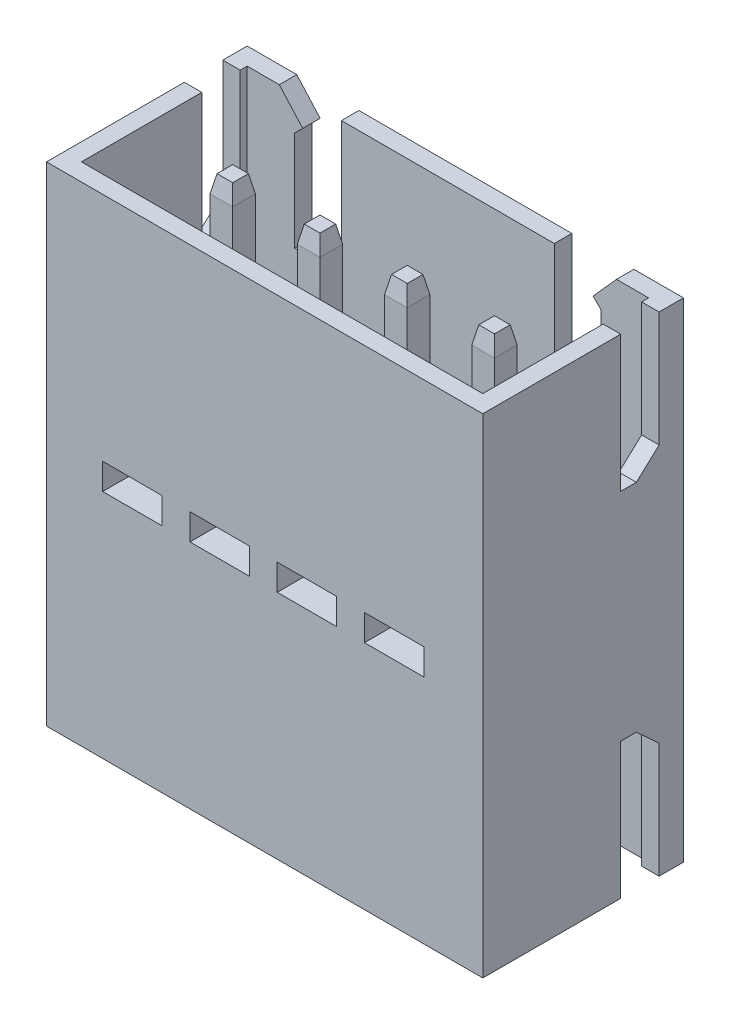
ISO-10303-21;
HEADER;
FILE_DESCRIPTION(('STEP AP214'),'2;1');
FILE_NAME('part.step','',(''),(''),'','','');
FILE_SCHEMA(('AUTOMOTIVE_DESIGN { 1 0 10303 214 1 1 1 1 }'));
ENDSEC;
DATA;
#1=APPLICATION_CONTEXT('core data for automotive mechanical design processes');
#2=APPLICATION_PROTOCOL_DEFINITION('international standard','automotive_design',2000,#1);
#3=PRODUCT_CONTEXT('',#1,'mechanical');
#4=PRODUCT('Part','Part','',(#3));
#5=PRODUCT_RELATED_PRODUCT_CATEGORY('part','',(#4));
#6=PRODUCT_DEFINITION_FORMATION('','',#4);
#7=PRODUCT_DEFINITION_CONTEXT('part definition',#1,'design');
#8=PRODUCT_DEFINITION('design','',#6,#7);
#9=PRODUCT_DEFINITION_SHAPE('','',#8);
#10=(LENGTH_UNIT() NAMED_UNIT(*) SI_UNIT(.MILLI.,.METRE.));
#11=(NAMED_UNIT(*) PLANE_ANGLE_UNIT() SI_UNIT($,.RADIAN.));
#12=(NAMED_UNIT(*) SI_UNIT($,.STERADIAN.) SOLID_ANGLE_UNIT());
#13=UNCERTAINTY_MEASURE_WITH_UNIT(LENGTH_MEASURE(1.E-05),#10,'distance_accuracy_value','');
#14=(GEOMETRIC_REPRESENTATION_CONTEXT(3) GLOBAL_UNCERTAINTY_ASSIGNED_CONTEXT((#13)) GLOBAL_UNIT_ASSIGNED_CONTEXT((#10,
#11,#12)) REPRESENTATION_CONTEXT('',''));
#15=CARTESIAN_POINT('',(0.,0.,0.));
#16=DIRECTION('',(0.,0.,1.));
#17=DIRECTION('',(1.,0.,0.));
#18=AXIS2_PLACEMENT_3D('',#15,#16,#17);
#19=CARTESIAN_POINT('',(-5.,6.5,0.));
#20=DIRECTION('',(0.,-1.,0.));
#21=DIRECTION('',(0.,0.,-1.));
#22=AXIS2_PLACEMENT_3D('',#19,#20,#21);
#23=PLANE('',#22);
#24=DIRECTION('',(-1.,0.,0.));
#25=VECTOR('',#24,1.);
#26=CARTESIAN_POINT('',(-1.065,6.5,-0.225));
#27=LINE('',#26,#25);
#28=CARTESIAN_POINT('',(-1.065,6.5,-0.225));
#29=VERTEX_POINT('',#28);
#30=CARTESIAN_POINT('',(-1.515,6.5,-0.225));
#31=VERTEX_POINT('',#30);
#32=EDGE_CURVE('E1842',#29,#31,#27,.T.);
#33=ORIENTED_EDGE('',*,*,#32,.T.);
#34=DIRECTION('',(0.,0.,1.));
#35=VECTOR('',#34,1.);
#36=CARTESIAN_POINT('',(-1.515,6.5,-0.225));
#37=LINE('',#36,#35);
#38=CARTESIAN_POINT('',(-1.515,6.5,0.225));
#39=VERTEX_POINT('',#38);
#40=EDGE_CURVE('E1374',#31,#39,#37,.T.);
#41=ORIENTED_EDGE('',*,*,#40,.T.);
#42=DIRECTION('',(1.,0.,0.));
#43=VECTOR('',#42,1.);
#44=CARTESIAN_POINT('',(-1.515,6.5,0.225));
#45=LINE('',#44,#43);
#46=CARTESIAN_POINT('',(-1.065,6.5,0.225));
#47=VERTEX_POINT('',#46);
#48=EDGE_CURVE('E11',#39,#47,#45,.T.);
#49=ORIENTED_EDGE('',*,*,#48,.T.);
#50=DIRECTION('',(0.,0.,-1.));
#51=VECTOR('',#50,1.);
#52=CARTESIAN_POINT('',(-1.065,6.5,0.225));
#53=LINE('',#52,#51);
#54=EDGE_CURVE('E1918',#47,#29,#53,.T.);
#55=ORIENTED_EDGE('',*,*,#54,.T.);
#56=EDGE_LOOP('',(#33,#41,#49,#55));
#57=FACE_BOUND('',#56,.T.);
#58=ADVANCED_FACE('F16',(#57),#23,.F.);
#59=CARTESIAN_POINT('',(-1.29,6.25,0.275));
#60=DIRECTION('',(0.,0.196116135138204,0.980580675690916));
#61=DIRECTION('',(1.,0.,0.));
#62=AXIS2_PLACEMENT_3D('',#59,#60,#61);
#63=PLANE('',#62);
#64=DIRECTION('',(-0.192450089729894,0.962250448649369,-0.192450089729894));
#65=VECTOR('',#64,1.);
#66=CARTESIAN_POINT('',(-0.965,6.,0.325));
#67=LINE('',#66,#65);
#68=CARTESIAN_POINT('',(-0.965,6.,0.325));
#69=VERTEX_POINT('',#68);
#70=EDGE_CURVE('E27',#69,#47,#67,.T.);
#71=ORIENTED_EDGE('',*,*,#70,.T.);
#72=ORIENTED_EDGE('',*,*,#48,.F.);
#73=DIRECTION('',(0.192450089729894,0.962250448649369,-0.192450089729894));
#74=VECTOR('',#73,1.);
#75=CARTESIAN_POINT('',(-1.615,6.,0.325));
#76=LINE('',#75,#74);
#77=CARTESIAN_POINT('',(-1.615,6.,0.325));
#78=VERTEX_POINT('',#77);
#79=EDGE_CURVE('E1370',#78,#39,#76,.T.);
#80=ORIENTED_EDGE('',*,*,#79,.F.);
#81=DIRECTION('',(1.,0.,0.));
#82=VECTOR('',#81,1.);
#83=CARTESIAN_POINT('',(-1.615,6.,0.325));
#84=LINE('',#83,#82);
#85=EDGE_CURVE('E1150',#78,#69,#84,.T.);
#86=ORIENTED_EDGE('',*,*,#85,.T.);
#87=EDGE_LOOP('',(#71,#72,#80,#86));
#88=FACE_BOUND('',#87,.T.);
#89=ADVANCED_FACE('F2758',(#88),#63,.T.);
#90=CARTESIAN_POINT('',(-1.015,6.25,0.));
#91=DIRECTION('',(0.980580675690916,0.196116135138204,0.));
#92=DIRECTION('',(0.,0.,-1.));
#93=AXIS2_PLACEMENT_3D('',#90,#91,#92);
#94=PLANE('',#93);
#95=DIRECTION('',(-0.192450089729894,0.962250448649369,0.192450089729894));
#96=VECTOR('',#95,1.);
#97=CARTESIAN_POINT('',(-0.965,6.,-0.325));
#98=LINE('',#97,#96);
#99=CARTESIAN_POINT('',(-0.965,6.,-0.325));
#100=VERTEX_POINT('',#99);
#101=EDGE_CURVE('E2000',#100,#29,#98,.T.);
#102=ORIENTED_EDGE('',*,*,#101,.T.);
#103=ORIENTED_EDGE('',*,*,#54,.F.);
#104=ORIENTED_EDGE('',*,*,#70,.F.);
#105=DIRECTION('',(0.,0.,-1.));
#106=VECTOR('',#105,1.);
#107=CARTESIAN_POINT('',(-0.965,6.,0.325));
#108=LINE('',#107,#106);
#109=EDGE_CURVE('E2055',#69,#100,#108,.T.);
#110=ORIENTED_EDGE('',*,*,#109,.T.);
#111=EDGE_LOOP('',(#102,#103,#104,#110));
#112=FACE_BOUND('',#111,.T.);
#113=ADVANCED_FACE('F2763',(#112),#94,.T.);
#114=CARTESIAN_POINT('',(-1.29,6.25,-0.275));
#115=DIRECTION('',(0.,0.196116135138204,-0.980580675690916));
#116=DIRECTION('',(-1.,0.,0.));
#117=AXIS2_PLACEMENT_3D('',#114,#115,#116);
#118=PLANE('',#117);
#119=DIRECTION('',(0.192450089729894,0.962250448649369,0.192450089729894));
#120=VECTOR('',#119,1.);
#121=CARTESIAN_POINT('',(-1.615,6.,-0.325));
#122=LINE('',#121,#120);
#123=CARTESIAN_POINT('',(-1.615,6.,-0.325));
#124=VERTEX_POINT('',#123);
#125=EDGE_CURVE('E1813',#124,#31,#122,.T.);
#126=ORIENTED_EDGE('',*,*,#125,.T.);
#127=ORIENTED_EDGE('',*,*,#32,.F.);
#128=ORIENTED_EDGE('',*,*,#101,.F.);
#129=DIRECTION('',(-1.,0.,0.));
#130=VECTOR('',#129,1.);
#131=CARTESIAN_POINT('',(-0.965,6.,-0.325));
#132=LINE('',#131,#130);
#133=EDGE_CURVE('E1448',#100,#124,#132,.T.);
#134=ORIENTED_EDGE('',*,*,#133,.T.);
#135=EDGE_LOOP('',(#126,#127,#128,#134));
#136=FACE_BOUND('',#135,.T.);
#137=ADVANCED_FACE('F2782',(#136),#118,.T.);
#138=CARTESIAN_POINT('',(-1.565,6.25,0.));
#139=DIRECTION('',(-0.980580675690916,0.196116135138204,0.));
#140=DIRECTION('',(0.,0.,1.));
#141=AXIS2_PLACEMENT_3D('',#138,#139,#140);
#142=PLANE('',#141);
#143=ORIENTED_EDGE('',*,*,#79,.T.);
#144=ORIENTED_EDGE('',*,*,#40,.F.);
#145=ORIENTED_EDGE('',*,*,#125,.F.);
#146=DIRECTION('',(0.,0.,1.));
#147=VECTOR('',#146,1.);
#148=CARTESIAN_POINT('',(-1.615,6.,-0.325));
#149=LINE('',#148,#147);
#150=EDGE_CURVE('E1426',#124,#78,#149,.T.);
#151=ORIENTED_EDGE('',*,*,#150,.T.);
#152=EDGE_LOOP('',(#143,#144,#145,#151));
#153=FACE_BOUND('',#152,.T.);
#154=ADVANCED_FACE('F2785',(#153),#142,.T.);
#155=CARTESIAN_POINT('',(-1.29,-6.25,0.275));
#156=DIRECTION('',(0.,0.196116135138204,-0.980580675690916));
#157=DIRECTION('',(-1.,0.,0.));
#158=AXIS2_PLACEMENT_3D('',#155,#156,#157);
#159=PLANE('',#158);
#160=DIRECTION('',(0.192450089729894,-0.962250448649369,-0.192450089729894));
#161=VECTOR('',#160,1.);
#162=CARTESIAN_POINT('',(-1.615,-6.,0.325));
#163=LINE('',#162,#161);
#164=CARTESIAN_POINT('',(-1.615,-6.,0.325));
#165=VERTEX_POINT('',#164);
#166=CARTESIAN_POINT('',(-1.515,-6.5,0.225));
#167=VERTEX_POINT('',#166);
#168=EDGE_CURVE('E1136',#165,#167,#163,.T.);
#169=ORIENTED_EDGE('',*,*,#168,.T.);
#170=DIRECTION('',(1.,0.,0.));
#171=VECTOR('',#170,1.);
#172=CARTESIAN_POINT('',(-1.515,-6.5,0.225));
#173=LINE('',#172,#171);
#174=CARTESIAN_POINT('',(-1.065,-6.5,0.225));
#175=VERTEX_POINT('',#174);
#176=EDGE_CURVE('E1236',#167,#175,#173,.T.);
#177=ORIENTED_EDGE('',*,*,#176,.T.);
#178=DIRECTION('',(-0.192450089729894,-0.962250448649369,-0.192450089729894));
#179=VECTOR('',#178,1.);
#180=CARTESIAN_POINT('',(-0.965,-6.,0.325));
#181=LINE('',#180,#179);
#182=CARTESIAN_POINT('',(-0.965,-6.,0.325));
#183=VERTEX_POINT('',#182);
#184=EDGE_CURVE('E1419',#183,#175,#181,.T.);
#185=ORIENTED_EDGE('',*,*,#184,.F.);
#186=DIRECTION('',(1.,0.,0.));
#187=VECTOR('',#186,1.);
#188=CARTESIAN_POINT('',(-1.615,-6.,0.325));
#189=LINE('',#188,#187);
#190=EDGE_CURVE('E1746',#165,#183,#189,.T.);
#191=ORIENTED_EDGE('',*,*,#190,.F.);
#192=EDGE_LOOP('',(#169,#177,#185,#191));
#193=FACE_BOUND('',#192,.T.);
#194=ADVANCED_FACE('F2870',(#193),#159,.F.);
#195=CARTESIAN_POINT('',(-1.29,-6.25,-0.275));
#196=DIRECTION('',(0.,0.196116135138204,0.980580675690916));
#197=DIRECTION('',(1.,0.,0.));
#198=AXIS2_PLACEMENT_3D('',#195,#196,#197);
#199=PLANE('',#198);
#200=DIRECTION('',(0.192450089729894,-0.962250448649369,0.192450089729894));
#201=VECTOR('',#200,1.);
#202=CARTESIAN_POINT('',(-1.615,-6.,-0.325));
#203=LINE('',#202,#201);
#204=CARTESIAN_POINT('',(-1.615,-6.,-0.325));
#205=VERTEX_POINT('',#204);
#206=CARTESIAN_POINT('',(-1.515,-6.5,-0.225));
#207=VERTEX_POINT('',#206);
#208=EDGE_CURVE('E1131',#205,#207,#203,.T.);
#209=ORIENTED_EDGE('',*,*,#208,.F.);
#210=DIRECTION('',(-1.,0.,0.));
#211=VECTOR('',#210,1.);
#212=CARTESIAN_POINT('',(-0.965,-6.,-0.325));
#213=LINE('',#212,#211);
#214=CARTESIAN_POINT('',(-0.965,-6.,-0.325));
#215=VERTEX_POINT('',#214);
#216=EDGE_CURVE('E1230',#215,#205,#213,.T.);
#217=ORIENTED_EDGE('',*,*,#216,.F.);
#218=DIRECTION('',(-0.192450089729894,-0.962250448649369,0.192450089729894));
#219=VECTOR('',#218,1.);
#220=CARTESIAN_POINT('',(-0.965,-6.,-0.325));
#221=LINE('',#220,#219);
#222=CARTESIAN_POINT('',(-1.065,-6.5,-0.225));
#223=VERTEX_POINT('',#222);
#224=EDGE_CURVE('E1375',#215,#223,#221,.T.);
#225=ORIENTED_EDGE('',*,*,#224,.T.);
#226=DIRECTION('',(-1.,0.,0.));
#227=VECTOR('',#226,1.);
#228=CARTESIAN_POINT('',(-1.065,-6.5,-0.225));
#229=LINE('',#228,#227);
#230=EDGE_CURVE('E1232',#223,#207,#229,.T.);
#231=ORIENTED_EDGE('',*,*,#230,.T.);
#232=EDGE_LOOP('',(#209,#217,#225,#231));
#233=FACE_BOUND('',#232,.T.);
#234=ADVANCED_FACE('F2873',(#233),#199,.F.);
#235=CARTESIAN_POINT('',(-1.015,-6.25,0.));
#236=DIRECTION('',(-0.980580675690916,0.196116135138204,0.));
#237=DIRECTION('',(0.,0.,1.));
#238=AXIS2_PLACEMENT_3D('',#235,#236,#237);
#239=PLANE('',#238);
#240=ORIENTED_EDGE('',*,*,#184,.T.);
#241=DIRECTION('',(0.,0.,-1.));
#242=VECTOR('',#241,1.);
#243=CARTESIAN_POINT('',(-1.065,-6.5,0.225));
#244=LINE('',#243,#242);
#245=EDGE_CURVE('E1235',#175,#223,#244,.T.);
#246=ORIENTED_EDGE('',*,*,#245,.T.);
#247=ORIENTED_EDGE('',*,*,#224,.F.);
#248=DIRECTION('',(0.,0.,-1.));
#249=VECTOR('',#248,1.);
#250=CARTESIAN_POINT('',(-0.965,-6.,0.325));
#251=LINE('',#250,#249);
#252=EDGE_CURVE('E2156',#183,#215,#251,.T.);
#253=ORIENTED_EDGE('',*,*,#252,.F.);
#254=EDGE_LOOP('',(#240,#246,#247,#253));
#255=FACE_BOUND('',#254,.T.);
#256=ADVANCED_FACE('F3063',(#255),#239,.F.);
#257=CARTESIAN_POINT('',(-5.,-6.5,0.));
#258=DIRECTION('',(0.,-1.,0.));
#259=DIRECTION('',(0.,0.,-1.));
#260=AXIS2_PLACEMENT_3D('',#257,#258,#259);
#261=PLANE('',#260);
#262=ORIENTED_EDGE('',*,*,#176,.F.);
#263=DIRECTION('',(0.,0.,1.));
#264=VECTOR('',#263,1.);
#265=CARTESIAN_POINT('',(-1.515,-6.5,-0.225));
#266=LINE('',#265,#264);
#267=EDGE_CURVE('E1135',#207,#167,#266,.T.);
#268=ORIENTED_EDGE('',*,*,#267,.F.);
#269=ORIENTED_EDGE('',*,*,#230,.F.);
#270=ORIENTED_EDGE('',*,*,#245,.F.);
#271=EDGE_LOOP('',(#262,#268,#269,#270));
#272=FACE_BOUND('',#271,.T.);
#273=ADVANCED_FACE('F2780',(#272),#261,.T.);
#274=CARTESIAN_POINT('',(-1.565,-6.25,0.));
#275=DIRECTION('',(0.980580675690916,0.196116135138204,0.));
#276=DIRECTION('',(0.,0.,-1.));
#277=AXIS2_PLACEMENT_3D('',#274,#275,#276);
#278=PLANE('',#277);
#279=ORIENTED_EDGE('',*,*,#168,.F.);
#280=DIRECTION('',(0.,0.,1.));
#281=VECTOR('',#280,1.);
#282=CARTESIAN_POINT('',(-1.615,-6.,-0.325));
#283=LINE('',#282,#281);
#284=EDGE_CURVE('E2211',#205,#165,#283,.T.);
#285=ORIENTED_EDGE('',*,*,#284,.F.);
#286=ORIENTED_EDGE('',*,*,#208,.T.);
#287=ORIENTED_EDGE('',*,*,#267,.T.);
#288=EDGE_LOOP('',(#279,#285,#286,#287));
#289=FACE_BOUND('',#288,.T.);
#290=ADVANCED_FACE('F2776',(#289),#278,.F.);
#291=CARTESIAN_POINT('',(-0.44,-0.375,-2.875));
#292=DIRECTION('',(-1.,0.,0.));
#293=DIRECTION('',(0.,0.,1.));
#294=AXIS2_PLACEMENT_3D('',#291,#292,#293);
#295=PLANE('',#294);
#296=DIRECTION('',(0.,1.,0.));
#297=VECTOR('',#296,1.);
#298=CARTESIAN_POINT('',(-0.44,-0.375,-2.875));
#299=LINE('',#298,#297);
#300=CARTESIAN_POINT('',(-0.44,-0.375,-2.875));
#301=VERTEX_POINT('',#300);
#302=CARTESIAN_POINT('',(-0.44,0.375,-2.875));
#303=VERTEX_POINT('',#302);
#304=EDGE_CURVE('E1162',#301,#303,#299,.T.);
#305=ORIENTED_EDGE('',*,*,#304,.F.);
#306=DIRECTION('',(0.,0.,1.));
#307=VECTOR('',#306,1.);
#308=CARTESIAN_POINT('',(-0.44,-0.375,-2.875));
#309=LINE('',#308,#307);
#310=CARTESIAN_POINT('',(-0.44,-0.375,2.875));
#311=VERTEX_POINT('',#310);
#312=EDGE_CURVE('E1458',#301,#311,#309,.T.);
#313=ORIENTED_EDGE('',*,*,#312,.T.);
#314=DIRECTION('',(0.,-1.,0.));
#315=VECTOR('',#314,1.);
#316=CARTESIAN_POINT('',(-0.44,0.375,2.875));
#317=LINE('',#316,#315);
#318=CARTESIAN_POINT('',(-0.44,0.375,2.875));
#319=VERTEX_POINT('',#318);
#320=EDGE_CURVE('E1263',#319,#311,#317,.T.);
#321=ORIENTED_EDGE('',*,*,#320,.F.);
#322=DIRECTION('',(0.,0.,-1.));
#323=VECTOR('',#322,1.);
#324=CARTESIAN_POINT('',(-0.44,0.375,2.875));
#325=LINE('',#324,#323);
#326=EDGE_CURVE('E1156',#319,#303,#325,.T.);
#327=ORIENTED_EDGE('',*,*,#326,.T.);
#328=EDGE_LOOP('',(#305,#313,#321,#327));
#329=FACE_BOUND('',#328,.T.);
#330=ADVANCED_FACE('F2779',(#329),#295,.T.);
#331=CARTESIAN_POINT('',(-3.79,-6.25,0.275));
#332=DIRECTION('',(0.,0.196116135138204,-0.980580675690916));
#333=DIRECTION('',(-1.,0.,0.));
#334=AXIS2_PLACEMENT_3D('',#331,#332,#333);
#335=PLANE('',#334);
#336=DIRECTION('',(0.192450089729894,-0.962250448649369,-0.192450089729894));
#337=VECTOR('',#336,1.);
#338=CARTESIAN_POINT('',(-4.115,-6.,0.325));
#339=LINE('',#338,#337);
#340=CARTESIAN_POINT('',(-4.115,-6.,0.325));
#341=VERTEX_POINT('',#340);
#342=CARTESIAN_POINT('',(-4.015,-6.5,0.225));
#343=VERTEX_POINT('',#342);
#344=EDGE_CURVE('E1650',#341,#343,#339,.T.);
#345=ORIENTED_EDGE('',*,*,#344,.T.);
#346=DIRECTION('',(1.,0.,0.));
#347=VECTOR('',#346,1.);
#348=CARTESIAN_POINT('',(-4.015,-6.5,0.225));
#349=LINE('',#348,#347);
#350=CARTESIAN_POINT('',(-3.565,-6.5,0.225));
#351=VERTEX_POINT('',#350);
#352=EDGE_CURVE('E2022',#343,#351,#349,.T.);
#353=ORIENTED_EDGE('',*,*,#352,.T.);
#354=DIRECTION('',(-0.192450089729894,-0.962250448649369,-0.192450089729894));
#355=VECTOR('',#354,1.);
#356=CARTESIAN_POINT('',(-3.465,-6.,0.325));
#357=LINE('',#356,#355);
#358=CARTESIAN_POINT('',(-3.465,-6.,0.325));
#359=VERTEX_POINT('',#358);
#360=EDGE_CURVE('E1226',#359,#351,#357,.T.);
#361=ORIENTED_EDGE('',*,*,#360,.F.);
#362=DIRECTION('',(1.,0.,0.));
#363=VECTOR('',#362,1.);
#364=CARTESIAN_POINT('',(-4.115,-6.,0.325));
#365=LINE('',#364,#363);
#366=EDGE_CURVE('E1277',#341,#359,#365,.T.);
#367=ORIENTED_EDGE('',*,*,#366,.F.);
#368=EDGE_LOOP('',(#345,#353,#361,#367));
#369=FACE_BOUND('',#368,.T.);
#370=ADVANCED_FACE('F3335',(#369),#335,.F.);
#371=CARTESIAN_POINT('',(-4.065,-6.25,0.));
#372=DIRECTION('',(0.980580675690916,0.196116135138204,0.));
#373=DIRECTION('',(0.,0.,-1.));
#374=AXIS2_PLACEMENT_3D('',#371,#372,#373);
#375=PLANE('',#374);
#376=ORIENTED_EDGE('',*,*,#344,.F.);
#377=DIRECTION('',(0.,0.,1.));
#378=VECTOR('',#377,1.);
#379=CARTESIAN_POINT('',(-4.115,-6.,-0.325));
#380=LINE('',#379,#378);
#381=CARTESIAN_POINT('',(-4.115,-6.,-0.325));
#382=VERTEX_POINT('',#381);
#383=EDGE_CURVE('E1511',#382,#341,#380,.T.);
#384=ORIENTED_EDGE('',*,*,#383,.F.);
#385=DIRECTION('',(0.192450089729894,-0.962250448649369,0.192450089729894));
#386=VECTOR('',#385,1.);
#387=CARTESIAN_POINT('',(-4.115,-6.,-0.325));
#388=LINE('',#387,#386);
#389=CARTESIAN_POINT('',(-4.015,-6.5,-0.225));
#390=VERTEX_POINT('',#389);
#391=EDGE_CURVE('E2014',#382,#390,#388,.T.);
#392=ORIENTED_EDGE('',*,*,#391,.T.);
#393=DIRECTION('',(0.,0.,1.));
#394=VECTOR('',#393,1.);
#395=CARTESIAN_POINT('',(-4.015,-6.5,-0.225));
#396=LINE('',#395,#394);
#397=EDGE_CURVE('E1654',#390,#343,#396,.T.);
#398=ORIENTED_EDGE('',*,*,#397,.T.);
#399=EDGE_LOOP('',(#376,#384,#392,#398));
#400=FACE_BOUND('',#399,.T.);
#401=ADVANCED_FACE('F3315',(#400),#375,.F.);
#402=CARTESIAN_POINT('',(-7.5,-6.5,0.));
#403=DIRECTION('',(0.,-1.,0.));
#404=DIRECTION('',(0.,0.,-1.));
#405=AXIS2_PLACEMENT_3D('',#402,#403,#404);
#406=PLANE('',#405);
#407=ORIENTED_EDGE('',*,*,#352,.F.);
#408=ORIENTED_EDGE('',*,*,#397,.F.);
#409=DIRECTION('',(-1.,0.,0.));
#410=VECTOR('',#409,1.);
#411=CARTESIAN_POINT('',(-3.565,-6.5,-0.225));
#412=LINE('',#411,#410);
#413=CARTESIAN_POINT('',(-3.565,-6.5,-0.225));
#414=VERTEX_POINT('',#413);
#415=EDGE_CURVE('E2018',#414,#390,#412,.T.);
#416=ORIENTED_EDGE('',*,*,#415,.F.);
#417=DIRECTION('',(0.,0.,-1.));
#418=VECTOR('',#417,1.);
#419=CARTESIAN_POINT('',(-3.565,-6.5,0.225));
#420=LINE('',#419,#418);
#421=EDGE_CURVE('E1221',#351,#414,#420,.T.);
#422=ORIENTED_EDGE('',*,*,#421,.F.);
#423=EDGE_LOOP('',(#407,#408,#416,#422));
#424=FACE_BOUND('',#423,.T.);
#425=ADVANCED_FACE('F3120',(#424),#406,.T.);
#426=CARTESIAN_POINT('',(-3.79,-6.25,-0.275));
#427=DIRECTION('',(0.,0.196116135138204,0.980580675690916));
#428=DIRECTION('',(1.,0.,0.));
#429=AXIS2_PLACEMENT_3D('',#426,#427,#428);
#430=PLANE('',#429);
#431=ORIENTED_EDGE('',*,*,#391,.F.);
#432=DIRECTION('',(-1.,0.,0.));
#433=VECTOR('',#432,1.);
#434=CARTESIAN_POINT('',(-3.465,-6.,-0.325));
#435=LINE('',#434,#433);
#436=CARTESIAN_POINT('',(-3.465,-6.,-0.325));
#437=VERTEX_POINT('',#436);
#438=EDGE_CURVE('E1167',#437,#382,#435,.T.);
#439=ORIENTED_EDGE('',*,*,#438,.F.);
#440=DIRECTION('',(-0.192450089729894,-0.962250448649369,0.192450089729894));
#441=VECTOR('',#440,1.);
#442=CARTESIAN_POINT('',(-3.465,-6.,-0.325));
#443=LINE('',#442,#441);
#444=EDGE_CURVE('E1225',#437,#414,#443,.T.);
#445=ORIENTED_EDGE('',*,*,#444,.T.);
#446=ORIENTED_EDGE('',*,*,#415,.T.);
#447=EDGE_LOOP('',(#431,#439,#445,#446));
#448=FACE_BOUND('',#447,.T.);
#449=ADVANCED_FACE('F3040',(#448),#430,.F.);
#450=CARTESIAN_POINT('',(-3.515,-6.25,0.));
#451=DIRECTION('',(-0.980580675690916,0.196116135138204,0.));
#452=DIRECTION('',(0.,0.,1.));
#453=AXIS2_PLACEMENT_3D('',#450,#451,#452);
#454=PLANE('',#453);
#455=ORIENTED_EDGE('',*,*,#360,.T.);
#456=ORIENTED_EDGE('',*,*,#421,.T.);
#457=ORIENTED_EDGE('',*,*,#444,.F.);
#458=DIRECTION('',(0.,0.,-1.));
#459=VECTOR('',#458,1.);
#460=CARTESIAN_POINT('',(-3.465,-6.,0.325));
#461=LINE('',#460,#459);
#462=EDGE_CURVE('E1944',#359,#437,#461,.T.);
#463=ORIENTED_EDGE('',*,*,#462,.F.);
#464=EDGE_LOOP('',(#455,#456,#457,#463));
#465=FACE_BOUND('',#464,.T.);
#466=ADVANCED_FACE('F3036',(#465),#454,.F.);
#467=CARTESIAN_POINT('',(-4.16,-6.25,-2.875));
#468=DIRECTION('',(0.745761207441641,-0.666213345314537,0.));
#469=DIRECTION('',(0.,0.,-1.));
#470=AXIS2_PLACEMENT_3D('',#467,#468,#469);
#471=PLANE('',#470);
#472=DIRECTION('',(-0.666213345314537,-0.745761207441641,0.));
#473=VECTOR('',#472,1.);
#474=CARTESIAN_POINT('',(-4.16,-6.25,-2.375));
#475=LINE('',#474,#473);
#476=CARTESIAN_POINT('',(-4.16,-6.25,-2.375));
#477=VERTEX_POINT('',#476);
#478=CARTESIAN_POINT('',(-4.83,-7.,-2.375));
#479=VERTEX_POINT('',#478);
#480=EDGE_CURVE('E1220',#477,#479,#475,.T.);
#481=ORIENTED_EDGE('',*,*,#480,.T.);
#482=DIRECTION('',(0.,0.,1.));
#483=VECTOR('',#482,1.);
#484=CARTESIAN_POINT('',(-4.83,-7.,-2.875));
#485=LINE('',#484,#483);
#486=CARTESIAN_POINT('',(-4.83,-7.,-2.875));
#487=VERTEX_POINT('',#486);
#488=EDGE_CURVE('E1922',#487,#479,#485,.T.);
#489=ORIENTED_EDGE('',*,*,#488,.F.);
#490=DIRECTION('',(-0.666213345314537,-0.745761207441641,0.));
#491=VECTOR('',#490,1.);
#492=CARTESIAN_POINT('',(-4.16,-6.25,-2.875));
#493=LINE('',#492,#491);
#494=CARTESIAN_POINT('',(-4.16,-6.25,-2.875));
#495=VERTEX_POINT('',#494);
#496=EDGE_CURVE('E1649',#495,#487,#493,.T.);
#497=ORIENTED_EDGE('',*,*,#496,.F.);
#498=DIRECTION('',(0.,0.,1.));
#499=VECTOR('',#498,1.);
#500=CARTESIAN_POINT('',(-4.16,-6.25,-2.875));
#501=LINE('',#500,#499);
#502=EDGE_CURVE('E1494',#495,#477,#501,.T.);
#503=ORIENTED_EDGE('',*,*,#502,.T.);
#504=EDGE_LOOP('',(#481,#489,#497,#503));
#505=FACE_BOUND('',#504,.T.);
#506=ADVANCED_FACE('F3039',(#505),#471,.T.);
#507=CARTESIAN_POINT('',(-4.39,-6.02,-2.875));
#508=DIRECTION('',(0.707106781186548,0.707106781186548,0.));
#509=DIRECTION('',(0.,0.,-1.));
#510=AXIS2_PLACEMENT_3D('',#507,#508,#509);
#511=PLANE('',#510);
#512=DIRECTION('',(0.707106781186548,-0.707106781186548,0.));
#513=VECTOR('',#512,1.);
#514=CARTESIAN_POINT('',(-4.39,-6.02,-2.375));
#515=LINE('',#514,#513);
#516=CARTESIAN_POINT('',(-4.39,-6.02,-2.375));
#517=VERTEX_POINT('',#516);
#518=EDGE_CURVE('E1215',#517,#477,#515,.T.);
#519=ORIENTED_EDGE('',*,*,#518,.T.);
#520=ORIENTED_EDGE('',*,*,#502,.F.);
#521=DIRECTION('',(0.707106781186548,-0.707106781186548,0.));
#522=VECTOR('',#521,1.);
#523=CARTESIAN_POINT('',(-4.39,-6.02,-2.875));
#524=LINE('',#523,#522);
#525=CARTESIAN_POINT('',(-4.39,-6.02,-2.875));
#526=VERTEX_POINT('',#525);
#527=EDGE_CURVE('E1571',#526,#495,#524,.T.);
#528=ORIENTED_EDGE('',*,*,#527,.F.);
#529=DIRECTION('',(0.,0.,1.));
#530=VECTOR('',#529,1.);
#531=CARTESIAN_POINT('',(-4.39,-6.02,-2.875));
#532=LINE('',#531,#530);
#533=EDGE_CURVE('E1491',#526,#517,#532,.T.);
#534=ORIENTED_EDGE('',*,*,#533,.T.);
#535=EDGE_LOOP('',(#519,#520,#528,#534));
#536=FACE_BOUND('',#535,.T.);
#537=ADVANCED_FACE('F3353',(#536),#511,.T.);
#538=CARTESIAN_POINT('',(-4.39,-3.16,-2.875));
#539=DIRECTION('',(1.,0.,0.));
#540=DIRECTION('',(0.,1.,0.));
#541=AXIS2_PLACEMENT_3D('',#538,#539,#540);
#542=PLANE('',#541);
#543=DIRECTION('',(0.,-1.,0.));
#544=VECTOR('',#543,1.);
#545=CARTESIAN_POINT('',(-4.39,-3.16,-2.375));
#546=LINE('',#545,#544);
#547=CARTESIAN_POINT('',(-4.39,-3.16,-2.375));
#548=VERTEX_POINT('',#547);
#549=EDGE_CURVE('E1219',#548,#517,#546,.T.);
#550=ORIENTED_EDGE('',*,*,#549,.T.);
#551=ORIENTED_EDGE('',*,*,#533,.F.);
#552=DIRECTION('',(0.,-1.,0.));
#553=VECTOR('',#552,1.);
#554=CARTESIAN_POINT('',(-4.39,-3.16,-2.875));
#555=LINE('',#554,#553);
#556=CARTESIAN_POINT('',(-4.39,-3.16,-2.875));
#557=VERTEX_POINT('',#556);
#558=EDGE_CURVE('E1567',#557,#526,#555,.T.);
#559=ORIENTED_EDGE('',*,*,#558,.F.);
#560=DIRECTION('',(0.,0.,1.));
#561=VECTOR('',#560,1.);
#562=CARTESIAN_POINT('',(-4.39,-3.16,-2.875));
#563=LINE('',#562,#561);
#564=EDGE_CURVE('E1276',#557,#548,#563,.T.);
#565=ORIENTED_EDGE('',*,*,#564,.T.);
#566=EDGE_LOOP('',(#550,#551,#559,#565));
#567=FACE_BOUND('',#566,.T.);
#568=ADVANCED_FACE('F3100',(#567),#542,.T.);
#569=CARTESIAN_POINT('',(-3.05,-3.16,-2.875));
#570=DIRECTION('',(0.,-1.,0.));
#571=DIRECTION('',(0.,0.,-1.));
#572=AXIS2_PLACEMENT_3D('',#569,#570,#571);
#573=PLANE('',#572);
#574=DIRECTION('',(-1.,0.,0.));
#575=VECTOR('',#574,1.);
#576=CARTESIAN_POINT('',(-3.05,-3.16,-2.375));
#577=LINE('',#576,#575);
#578=CARTESIAN_POINT('',(-3.05,-3.16,-2.375));
#579=VERTEX_POINT('',#578);
#580=EDGE_CURVE('E1546',#579,#548,#577,.T.);
#581=ORIENTED_EDGE('',*,*,#580,.T.);
#582=ORIENTED_EDGE('',*,*,#564,.F.);
#583=DIRECTION('',(-1.,0.,0.));
#584=VECTOR('',#583,1.);
#585=CARTESIAN_POINT('',(-3.05,-3.16,-2.875));
#586=LINE('',#585,#584);
#587=CARTESIAN_POINT('',(-3.05,-3.16,-2.875));
#588=VERTEX_POINT('',#587);
#589=EDGE_CURVE('E1572',#588,#557,#586,.T.);
#590=ORIENTED_EDGE('',*,*,#589,.F.);
#591=DIRECTION('',(0.,0.,1.));
#592=VECTOR('',#591,1.);
#593=CARTESIAN_POINT('',(-3.05,-3.16,-2.875));
#594=LINE('',#593,#592);
#595=EDGE_CURVE('E1097',#588,#579,#594,.T.);
#596=ORIENTED_EDGE('',*,*,#595,.T.);
#597=EDGE_LOOP('',(#581,#582,#590,#596));
#598=FACE_BOUND('',#597,.T.);
#599=ADVANCED_FACE('F3010',(#598),#573,.T.);
#600=CARTESIAN_POINT('',(-3.05,-7.,-2.875));
#601=DIRECTION('',(-1.,0.,0.));
#602=DIRECTION('',(0.,0.,1.));
#603=AXIS2_PLACEMENT_3D('',#600,#601,#602);
#604=PLANE('',#603);
#605=DIRECTION('',(0.,1.,0.));
#606=VECTOR('',#605,1.);
#607=CARTESIAN_POINT('',(-3.05,-7.,-2.875));
#608=LINE('',#607,#606);
#609=CARTESIAN_POINT('',(-3.05,-7.,-2.875));
#610=VERTEX_POINT('',#609);
#611=EDGE_CURVE('E1880',#610,#588,#608,.T.);
#612=ORIENTED_EDGE('',*,*,#611,.F.);
#613=DIRECTION('',(0.,0.,1.));
#614=VECTOR('',#613,1.);
#615=CARTESIAN_POINT('',(-3.05,-7.,-2.875));
#616=LINE('',#615,#614);
#617=CARTESIAN_POINT('',(-3.05,-7.,-2.375));
#618=VERTEX_POINT('',#617);
#619=EDGE_CURVE('E1961',#610,#618,#616,.T.);
#620=ORIENTED_EDGE('',*,*,#619,.T.);
#621=DIRECTION('',(0.,1.,0.));
#622=VECTOR('',#621,1.);
#623=CARTESIAN_POINT('',(-3.05,-7.,-2.375));
#624=LINE('',#623,#622);
#625=EDGE_CURVE('E1899',#618,#579,#624,.T.);
#626=ORIENTED_EDGE('',*,*,#625,.T.);
#627=ORIENTED_EDGE('',*,*,#595,.F.);
#628=EDGE_LOOP('',(#612,#620,#626,#627));
#629=FACE_BOUND('',#628,.T.);
#630=ADVANCED_FACE('F3007',(#629),#604,.T.);
#631=CARTESIAN_POINT('',(-5.75,7.,2.375));
#632=DIRECTION('',(0.,0.,1.));
#633=DIRECTION('',(1.,0.,0.));
#634=AXIS2_PLACEMENT_3D('',#631,#632,#633);
#635=PLANE('',#634);
#636=DIRECTION('',(0.,-1.,0.));
#637=VECTOR('',#636,1.);
#638=CARTESIAN_POINT('',(5.75,7.,2.375));
#639=LINE('',#638,#637);
#640=CARTESIAN_POINT('',(5.75,7.,2.375));
#641=VERTEX_POINT('',#640);
#642=CARTESIAN_POINT('',(5.75,0.7,2.375));
#643=VERTEX_POINT('',#642);
#644=EDGE_CURVE('E2079',#641,#643,#639,.T.);
#645=ORIENTED_EDGE('',*,*,#644,.T.);
#646=DIRECTION('',(1.,0.,0.));
#647=VECTOR('',#646,1.);
#648=CARTESIAN_POINT('',(-5.75,0.7,2.375));
#649=LINE('',#648,#647);
#650=CARTESIAN_POINT('',(-5.75,0.7,2.375));
#651=VERTEX_POINT('',#650);
#652=EDGE_CURVE('E1635',#651,#643,#649,.T.);
#653=ORIENTED_EDGE('',*,*,#652,.F.);
#654=DIRECTION('',(0.,-1.,0.));
#655=VECTOR('',#654,1.);
#656=CARTESIAN_POINT('',(-5.75,7.,2.375));
#657=LINE('',#656,#655);
#658=CARTESIAN_POINT('',(-5.75,7.,2.375));
#659=VERTEX_POINT('',#658);
#660=EDGE_CURVE('E1078',#659,#651,#657,.T.);
#661=ORIENTED_EDGE('',*,*,#660,.F.);
#662=DIRECTION('',(1.,0.,0.));
#663=VECTOR('',#662,1.);
#664=CARTESIAN_POINT('',(-5.75,7.,2.375));
#665=LINE('',#664,#663);
#666=EDGE_CURVE('E1124',#659,#641,#665,.T.);
#667=ORIENTED_EDGE('',*,*,#666,.T.);
#668=EDGE_LOOP('',(#645,#653,#661,#667));
#669=FACE_BOUND('',#668,.T.);
#670=ADVANCED_FACE('F2651',(#669),#635,.F.);
#671=CARTESIAN_POINT('',(6.25,3.1,-1.525));
#672=DIRECTION('',(0.,-0.734803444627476,-0.678280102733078));
#673=DIRECTION('',(0.,0.678280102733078,-0.734803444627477));
#674=AXIS2_PLACEMENT_3D('',#671,#672,#673);
#675=PLANE('',#674);
#676=DIRECTION('',(-1.,0.,0.));
#677=VECTOR('',#676,1.);
#678=CARTESIAN_POINT('',(-5.75,3.1,-1.525));
#679=LINE('',#678,#677);
#680=CARTESIAN_POINT('',(-5.75,3.1,-1.525));
#681=VERTEX_POINT('',#680);
#682=CARTESIAN_POINT('',(-6.25,3.1,-1.525));
#683=VERTEX_POINT('',#682);
#684=EDGE_CURVE('E1094',#681,#683,#679,.T.);
#685=ORIENTED_EDGE('',*,*,#684,.F.);
#686=DIRECTION('',(0.,0.678280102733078,-0.734803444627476));
#687=VECTOR('',#686,1.);
#688=CARTESIAN_POINT('',(-5.75,3.1,-1.525));
#689=LINE('',#688,#687);
#690=CARTESIAN_POINT('',(-5.75,3.7,-2.175));
#691=VERTEX_POINT('',#690);
#692=EDGE_CURVE('E1081',#681,#691,#689,.T.);
#693=ORIENTED_EDGE('',*,*,#692,.T.);
#694=DIRECTION('',(-1.,0.,0.));
#695=VECTOR('',#694,1.);
#696=CARTESIAN_POINT('',(-5.75,3.7,-2.175));
#697=LINE('',#696,#695);
#698=CARTESIAN_POINT('',(-6.25,3.7,-2.175));
#699=VERTEX_POINT('',#698);
#700=EDGE_CURVE('E1410',#691,#699,#697,.T.);
#701=ORIENTED_EDGE('',*,*,#700,.T.);
#702=DIRECTION('',(0.,0.678280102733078,-0.734803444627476));
#703=VECTOR('',#702,1.);
#704=CARTESIAN_POINT('',(-6.25,3.1,-1.525));
#705=LINE('',#704,#703);
#706=EDGE_CURVE('E1618',#683,#699,#705,.T.);
#707=ORIENTED_EDGE('',*,*,#706,.F.);
#708=EDGE_LOOP('',(#685,#693,#701,#707));
#709=FACE_BOUND('',#708,.T.);
#710=ADVANCED_FACE('F2951',(#709),#675,.F.);
#711=CARTESIAN_POINT('',(6.25,3.1,-1.525));
#712=DIRECTION('',(0.,-0.734803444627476,-0.678280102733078));
#713=DIRECTION('',(0.,0.678280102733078,-0.734803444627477));
#714=AXIS2_PLACEMENT_3D('',#711,#712,#713);
#715=PLANE('',#714);
#716=DIRECTION('',(-1.,0.,0.));
#717=VECTOR('',#716,1.);
#718=CARTESIAN_POINT('',(6.25,3.7,-2.175));
#719=LINE('',#718,#717);
#720=CARTESIAN_POINT('',(6.25,3.7,-2.175));
#721=VERTEX_POINT('',#720);
#722=CARTESIAN_POINT('',(5.75,3.7,-2.175));
#723=VERTEX_POINT('',#722);
#724=EDGE_CURVE('E1082',#721,#723,#719,.T.);
#725=ORIENTED_EDGE('',*,*,#724,.T.);
#726=DIRECTION('',(0.,0.678280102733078,-0.734803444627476));
#727=VECTOR('',#726,1.);
#728=CARTESIAN_POINT('',(5.75,3.1,-1.525));
#729=LINE('',#728,#727);
#730=CARTESIAN_POINT('',(5.75,3.1,-1.525));
#731=VERTEX_POINT('',#730);
#732=EDGE_CURVE('E1272',#731,#723,#729,.T.);
#733=ORIENTED_EDGE('',*,*,#732,.F.);
#734=DIRECTION('',(-1.,0.,0.));
#735=VECTOR('',#734,1.);
#736=CARTESIAN_POINT('',(6.25,3.1,-1.525));
#737=LINE('',#736,#735);
#738=CARTESIAN_POINT('',(6.25,3.1,-1.525));
#739=VERTEX_POINT('',#738);
#740=EDGE_CURVE('E1098',#739,#731,#737,.T.);
#741=ORIENTED_EDGE('',*,*,#740,.F.);
#742=DIRECTION('',(0.,0.678280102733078,-0.734803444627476));
#743=VECTOR('',#742,1.);
#744=CARTESIAN_POINT('',(6.25,3.1,-1.525));
#745=LINE('',#744,#743);
#746=EDGE_CURVE('E1299',#739,#721,#745,.T.);
#747=ORIENTED_EDGE('',*,*,#746,.T.);
#748=EDGE_LOOP('',(#725,#733,#741,#747));
#749=FACE_BOUND('',#748,.T.);
#750=ADVANCED_FACE('F2868',(#749),#715,.F.);
#751=CARTESIAN_POINT('',(6.25,3.1,-1.075));
#752=DIRECTION('',(0.,-1.,0.));
#753=DIRECTION('',(0.,0.,-1.));
#754=AXIS2_PLACEMENT_3D('',#751,#752,#753);
#755=PLANE('',#754);
#756=DIRECTION('',(-1.,0.,0.));
#757=VECTOR('',#756,1.);
#758=CARTESIAN_POINT('',(-5.75,3.1,-1.075));
#759=LINE('',#758,#757);
#760=CARTESIAN_POINT('',(-5.75,3.1,-1.075));
#761=VERTEX_POINT('',#760);
#762=CARTESIAN_POINT('',(-6.25,3.1,-1.075));
#763=VERTEX_POINT('',#762);
#764=EDGE_CURVE('E2195',#761,#763,#759,.T.);
#765=ORIENTED_EDGE('',*,*,#764,.F.);
#766=DIRECTION('',(0.,0.,-1.));
#767=VECTOR('',#766,1.);
#768=CARTESIAN_POINT('',(-5.75,3.1,-1.075));
#769=LINE('',#768,#767);
#770=EDGE_CURVE('E1211',#761,#681,#769,.T.);
#771=ORIENTED_EDGE('',*,*,#770,.T.);
#772=ORIENTED_EDGE('',*,*,#684,.T.);
#773=DIRECTION('',(0.,0.,-1.));
#774=VECTOR('',#773,1.);
#775=CARTESIAN_POINT('',(-6.25,3.1,-1.075));
#776=LINE('',#775,#774);
#777=EDGE_CURVE('E1614',#763,#683,#776,.T.);
#778=ORIENTED_EDGE('',*,*,#777,.F.);
#779=EDGE_LOOP('',(#765,#771,#772,#778));
#780=FACE_BOUND('',#779,.T.);
#781=ADVANCED_FACE('F2864',(#780),#755,.F.);
#782=CARTESIAN_POINT('',(6.25,3.1,-1.075));
#783=DIRECTION('',(0.,-1.,0.));
#784=DIRECTION('',(0.,0.,-1.));
#785=AXIS2_PLACEMENT_3D('',#782,#783,#784);
#786=PLANE('',#785);
#787=ORIENTED_EDGE('',*,*,#740,.T.);
#788=DIRECTION('',(0.,0.,-1.));
#789=VECTOR('',#788,1.);
#790=CARTESIAN_POINT('',(5.75,3.1,-1.075));
#791=LINE('',#790,#789);
#792=CARTESIAN_POINT('',(5.75,3.1,-1.075));
#793=VERTEX_POINT('',#792);
#794=EDGE_CURVE('E1268',#793,#731,#791,.T.);
#795=ORIENTED_EDGE('',*,*,#794,.F.);
#796=DIRECTION('',(-1.,0.,0.));
#797=VECTOR('',#796,1.);
#798=CARTESIAN_POINT('',(6.25,3.1,-1.075));
#799=LINE('',#798,#797);
#800=CARTESIAN_POINT('',(6.25,3.1,-1.075));
#801=VERTEX_POINT('',#800);
#802=EDGE_CURVE('E1619',#801,#793,#799,.T.);
#803=ORIENTED_EDGE('',*,*,#802,.F.);
#804=DIRECTION('',(0.,0.,-1.));
#805=VECTOR('',#804,1.);
#806=CARTESIAN_POINT('',(6.25,3.1,-1.075));
#807=LINE('',#806,#805);
#808=EDGE_CURVE('E1294',#801,#739,#807,.T.);
#809=ORIENTED_EDGE('',*,*,#808,.T.);
#810=EDGE_LOOP('',(#787,#795,#803,#809));
#811=FACE_BOUND('',#810,.T.);
#812=ADVANCED_FACE('F2867',(#811),#786,.F.);
#813=CARTESIAN_POINT('',(-5.75,7.,-2.375));
#814=DIRECTION('',(-1.,0.,0.));
#815=DIRECTION('',(0.,0.,1.));
#816=AXIS2_PLACEMENT_3D('',#813,#814,#815);
#817=PLANE('',#816);
#818=DIRECTION('',(0.,0.,1.));
#819=VECTOR('',#818,1.);
#820=CARTESIAN_POINT('',(-5.75,7.,-1.075));
#821=LINE('',#820,#819);
#822=CARTESIAN_POINT('',(-5.75,7.,-1.075));
#823=VERTEX_POINT('',#822);
#824=EDGE_CURVE('E1702',#823,#659,#821,.T.);
#825=ORIENTED_EDGE('',*,*,#824,.T.);
#826=ORIENTED_EDGE('',*,*,#660,.T.);
#827=DIRECTION('',(0.,0.,1.));
#828=VECTOR('',#827,1.);
#829=CARTESIAN_POINT('',(-5.75,0.7,-2.375));
#830=LINE('',#829,#828);
#831=CARTESIAN_POINT('',(-5.75,0.7,-2.375));
#832=VERTEX_POINT('',#831);
#833=EDGE_CURVE('E2137',#832,#651,#830,.T.);
#834=ORIENTED_EDGE('',*,*,#833,.F.);
#835=DIRECTION('',(0.,-1.,0.));
#836=VECTOR('',#835,1.);
#837=CARTESIAN_POINT('',(-5.75,7.,-2.375));
#838=LINE('',#837,#836);
#839=CARTESIAN_POINT('',(-5.75,7.,-2.375));
#840=VERTEX_POINT('',#839);
#841=EDGE_CURVE('E1519',#840,#832,#838,.T.);
#842=ORIENTED_EDGE('',*,*,#841,.F.);
#843=DIRECTION('',(0.,0.,1.));
#844=VECTOR('',#843,1.);
#845=CARTESIAN_POINT('',(-5.75,7.,-2.375));
#846=LINE('',#845,#844);
#847=CARTESIAN_POINT('',(-5.75,7.,-2.175));
#848=VERTEX_POINT('',#847);
#849=EDGE_CURVE('E1526',#840,#848,#846,.T.);
#850=ORIENTED_EDGE('',*,*,#849,.T.);
#851=DIRECTION('',(0.,-1.,0.));
#852=VECTOR('',#851,1.);
#853=CARTESIAN_POINT('',(-5.75,7.,-2.175));
#854=LINE('',#853,#852);
#855=EDGE_CURVE('E2124',#848,#691,#854,.T.);
#856=ORIENTED_EDGE('',*,*,#855,.T.);
#857=ORIENTED_EDGE('',*,*,#692,.F.);
#858=ORIENTED_EDGE('',*,*,#770,.F.);
#859=DIRECTION('',(0.,-1.,0.));
#860=VECTOR('',#859,1.);
#861=CARTESIAN_POINT('',(-5.75,7.,-1.075));
#862=LINE('',#861,#860);
#863=EDGE_CURVE('E2191',#823,#761,#862,.T.);
#864=ORIENTED_EDGE('',*,*,#863,.F.);
#865=EDGE_LOOP('',(#825,#826,#834,#842,#850,#856,#857,#858,#864));
#866=FACE_BOUND('',#865,.T.);
#867=ADVANCED_FACE('F2645',(#866),#817,.F.);
#868=CARTESIAN_POINT('',(6.25,3.7,-2.175));
#869=DIRECTION('',(0.,0.,-1.));
#870=DIRECTION('',(0.,-1.,0.));
#871=AXIS2_PLACEMENT_3D('',#868,#869,#870);
#872=PLANE('',#871);
#873=DIRECTION('',(0.,-1.,0.));
#874=VECTOR('',#873,1.);
#875=CARTESIAN_POINT('',(5.75,7.,-2.175));
#876=LINE('',#875,#874);
#877=CARTESIAN_POINT('',(5.75,7.,-2.175));
#878=VERTEX_POINT('',#877);
#879=EDGE_CURVE('E2084',#878,#723,#876,.T.);
#880=ORIENTED_EDGE('',*,*,#879,.T.);
#881=ORIENTED_EDGE('',*,*,#724,.F.);
#882=DIRECTION('',(0.,-1.,0.));
#883=VECTOR('',#882,1.);
#884=CARTESIAN_POINT('',(6.25,7.,-2.175));
#885=LINE('',#884,#883);
#886=CARTESIAN_POINT('',(6.25,7.,-2.175));
#887=VERTEX_POINT('',#886);
#888=EDGE_CURVE('E1706',#887,#721,#885,.T.);
#889=ORIENTED_EDGE('',*,*,#888,.F.);
#890=DIRECTION('',(-1.,0.,0.));
#891=VECTOR('',#890,1.);
#892=CARTESIAN_POINT('',(6.25,7.,-2.175));
#893=LINE('',#892,#891);
#894=EDGE_CURVE('E1240',#887,#878,#893,.T.);
#895=ORIENTED_EDGE('',*,*,#894,.T.);
#896=EDGE_LOOP('',(#880,#881,#889,#895));
#897=FACE_BOUND('',#896,.T.);
#898=ADVANCED_FACE('F3071',(#897),#872,.F.);
#899=CARTESIAN_POINT('',(6.25,3.7,-2.175));
#900=DIRECTION('',(0.,0.,-1.));
#901=DIRECTION('',(0.,-1.,0.));
#902=AXIS2_PLACEMENT_3D('',#899,#900,#901);
#903=PLANE('',#902);
#904=DIRECTION('',(0.,-1.,0.));
#905=VECTOR('',#904,1.);
#906=CARTESIAN_POINT('',(-6.25,7.,-2.175));
#907=LINE('',#906,#905);
#908=CARTESIAN_POINT('',(-6.25,7.,-2.175));
#909=VERTEX_POINT('',#908);
#910=EDGE_CURVE('E1967',#909,#699,#907,.T.);
#911=ORIENTED_EDGE('',*,*,#910,.T.);
#912=ORIENTED_EDGE('',*,*,#700,.F.);
#913=ORIENTED_EDGE('',*,*,#855,.F.);
#914=DIRECTION('',(-1.,0.,0.));
#915=VECTOR('',#914,1.);
#916=CARTESIAN_POINT('',(-5.75,7.,-2.175));
#917=LINE('',#916,#915);
#918=EDGE_CURVE('E1537',#848,#909,#917,.T.);
#919=ORIENTED_EDGE('',*,*,#918,.T.);
#920=EDGE_LOOP('',(#911,#912,#913,#919));
#921=FACE_BOUND('',#920,.T.);
#922=ADVANCED_FACE('F2862',(#921),#903,.F.);
#923=CARTESIAN_POINT('',(-5.75,-7.,-2.375));
#924=DIRECTION('',(1.,0.,0.));
#925=DIRECTION('',(0.,1.,0.));
#926=AXIS2_PLACEMENT_3D('',#923,#924,#925);
#927=PLANE('',#926);
#928=DIRECTION('',(0.,0.,-1.));
#929=VECTOR('',#928,1.);
#930=CARTESIAN_POINT('',(-5.75,-3.1,-1.075));
#931=LINE('',#930,#929);
#932=CARTESIAN_POINT('',(-5.75,-3.1,-1.075));
#933=VERTEX_POINT('',#932);
#934=CARTESIAN_POINT('',(-5.75,-3.1,-1.525));
#935=VERTEX_POINT('',#934);
#936=EDGE_CURVE('E1305',#933,#935,#931,.T.);
#937=ORIENTED_EDGE('',*,*,#936,.T.);
#938=DIRECTION('',(0.,-0.678280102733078,-0.734803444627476));
#939=VECTOR('',#938,1.);
#940=CARTESIAN_POINT('',(-5.75,-3.1,-1.525));
#941=LINE('',#940,#939);
#942=CARTESIAN_POINT('',(-5.75,-3.7,-2.175));
#943=VERTEX_POINT('',#942);
#944=EDGE_CURVE('E1340',#935,#943,#941,.T.);
#945=ORIENTED_EDGE('',*,*,#944,.T.);
#946=DIRECTION('',(0.,1.,0.));
#947=VECTOR('',#946,1.);
#948=CARTESIAN_POINT('',(-5.75,-7.,-2.175));
#949=LINE('',#948,#947);
#950=CARTESIAN_POINT('',(-5.75,-7.,-2.175));
#951=VERTEX_POINT('',#950);
#952=EDGE_CURVE('E1911',#951,#943,#949,.T.);
#953=ORIENTED_EDGE('',*,*,#952,.F.);
#954=DIRECTION('',(0.,0.,1.));
#955=VECTOR('',#954,1.);
#956=CARTESIAN_POINT('',(-5.75,-7.,-2.375));
#957=LINE('',#956,#955);
#958=CARTESIAN_POINT('',(-5.75,-7.,-2.375));
#959=VERTEX_POINT('',#958);
#960=EDGE_CURVE('E1957',#959,#951,#957,.T.);
#961=ORIENTED_EDGE('',*,*,#960,.F.);
#962=DIRECTION('',(0.,1.,0.));
#963=VECTOR('',#962,1.);
#964=CARTESIAN_POINT('',(-5.75,-7.,-2.375));
#965=LINE('',#964,#963);
#966=CARTESIAN_POINT('',(-5.75,-0.7,-2.375));
#967=VERTEX_POINT('',#966);
#968=EDGE_CURVE('E1576',#959,#967,#965,.T.);
#969=ORIENTED_EDGE('',*,*,#968,.T.);
#970=DIRECTION('',(0.,0.,1.));
#971=VECTOR('',#970,1.);
#972=CARTESIAN_POINT('',(-5.75,-0.7,-2.375));
#973=LINE('',#972,#971);
#974=CARTESIAN_POINT('',(-5.75,-0.7,2.375));
#975=VERTEX_POINT('',#974);
#976=EDGE_CURVE('E1336',#967,#975,#973,.T.);
#977=ORIENTED_EDGE('',*,*,#976,.T.);
#978=DIRECTION('',(0.,1.,0.));
#979=VECTOR('',#978,1.);
#980=CARTESIAN_POINT('',(-5.75,-7.,2.375));
#981=LINE('',#980,#979);
#982=CARTESIAN_POINT('',(-5.75,-7.,2.375));
#983=VERTEX_POINT('',#982);
#984=EDGE_CURVE('E1407',#983,#975,#981,.T.);
#985=ORIENTED_EDGE('',*,*,#984,.F.);
#986=DIRECTION('',(0.,0.,1.));
#987=VECTOR('',#986,1.);
#988=CARTESIAN_POINT('',(-5.75,-7.,-1.075));
#989=LINE('',#988,#987);
#990=CARTESIAN_POINT('',(-5.75,-7.,-1.075));
#991=VERTEX_POINT('',#990);
#992=EDGE_CURVE('E1288',#991,#983,#989,.T.);
#993=ORIENTED_EDGE('',*,*,#992,.F.);
#994=DIRECTION('',(0.,1.,0.));
#995=VECTOR('',#994,1.);
#996=CARTESIAN_POINT('',(-5.75,-7.,-1.075));
#997=LINE('',#996,#995);
#998=EDGE_CURVE('E1994',#991,#933,#997,.T.);
#999=ORIENTED_EDGE('',*,*,#998,.T.);
#1000=EDGE_LOOP('',(#937,#945,#953,#961,#969,#977,#985,#993,#999));
#1001=FACE_BOUND('',#1000,.T.);
#1002=ADVANCED_FACE('F2858',(#1001),#927,.T.);
#1003=CARTESIAN_POINT('',(-5.75,-7.,2.375));
#1004=DIRECTION('',(0.,0.,-1.));
#1005=DIRECTION('',(0.,-1.,0.));
#1006=AXIS2_PLACEMENT_3D('',#1003,#1004,#1005);
#1007=PLANE('',#1006);
#1008=DIRECTION('',(1.,0.,0.));
#1009=VECTOR('',#1008,1.);
#1010=CARTESIAN_POINT('',(-5.75,-0.7,2.375));
#1011=LINE('',#1010,#1009);
#1012=CARTESIAN_POINT('',(5.75,-0.7,2.375));
#1013=VERTEX_POINT('',#1012);
#1014=EDGE_CURVE('E1586',#975,#1013,#1011,.T.);
#1015=ORIENTED_EDGE('',*,*,#1014,.T.);
#1016=DIRECTION('',(0.,1.,0.));
#1017=VECTOR('',#1016,1.);
#1018=CARTESIAN_POINT('',(5.75,-7.,2.375));
#1019=LINE('',#1018,#1017);
#1020=CARTESIAN_POINT('',(5.75,-7.,2.375));
#1021=VERTEX_POINT('',#1020);
#1022=EDGE_CURVE('E1411',#1021,#1013,#1019,.T.);
#1023=ORIENTED_EDGE('',*,*,#1022,.F.);
#1024=DIRECTION('',(1.,0.,0.));
#1025=VECTOR('',#1024,1.);
#1026=CARTESIAN_POINT('',(-5.75,-7.,2.375));
#1027=LINE('',#1026,#1025);
#1028=EDGE_CURVE('E1292',#983,#1021,#1027,.T.);
#1029=ORIENTED_EDGE('',*,*,#1028,.F.);
#1030=ORIENTED_EDGE('',*,*,#984,.T.);
#1031=EDGE_LOOP('',(#1015,#1023,#1029,#1030));
#1032=FACE_BOUND('',#1031,.T.);
#1033=ADVANCED_FACE('F2861',(#1032),#1007,.T.);
#1034=CARTESIAN_POINT('',(5.75,-7.,2.375));
#1035=DIRECTION('',(-1.,0.,0.));
#1036=DIRECTION('',(0.,0.,1.));
#1037=AXIS2_PLACEMENT_3D('',#1034,#1035,#1036);
#1038=PLANE('',#1037);
#1039=DIRECTION('',(0.,0.,-1.));
#1040=VECTOR('',#1039,1.);
#1041=CARTESIAN_POINT('',(5.75,-7.,2.375));
#1042=LINE('',#1041,#1040);
#1043=CARTESIAN_POINT('',(5.75,-7.,-1.075));
#1044=VERTEX_POINT('',#1043);
#1045=EDGE_CURVE('E1061',#1021,#1044,#1042,.T.);
#1046=ORIENTED_EDGE('',*,*,#1045,.F.);
#1047=ORIENTED_EDGE('',*,*,#1022,.T.);
#1048=DIRECTION('',(0.,0.,-1.));
#1049=VECTOR('',#1048,1.);
#1050=CARTESIAN_POINT('',(5.75,-0.7,2.375));
#1051=LINE('',#1050,#1049);
#1052=CARTESIAN_POINT('',(5.75,-0.7,-2.375));
#1053=VERTEX_POINT('',#1052);
#1054=EDGE_CURVE('E1590',#1013,#1053,#1051,.T.);
#1055=ORIENTED_EDGE('',*,*,#1054,.T.);
#1056=DIRECTION('',(0.,1.,0.));
#1057=VECTOR('',#1056,1.);
#1058=CARTESIAN_POINT('',(5.75,-7.,-2.375));
#1059=LINE('',#1058,#1057);
#1060=CARTESIAN_POINT('',(5.75,-7.,-2.375));
#1061=VERTEX_POINT('',#1060);
#1062=EDGE_CURVE('E1573',#1061,#1053,#1059,.T.);
#1063=ORIENTED_EDGE('',*,*,#1062,.F.);
#1064=DIRECTION('',(0.,0.,-1.));
#1065=VECTOR('',#1064,1.);
#1066=CARTESIAN_POINT('',(5.75,-7.,-2.175));
#1067=LINE('',#1066,#1065);
#1068=CARTESIAN_POINT('',(5.75,-7.,-2.175));
#1069=VERTEX_POINT('',#1068);
#1070=EDGE_CURVE('E1047',#1069,#1061,#1067,.T.);
#1071=ORIENTED_EDGE('',*,*,#1070,.F.);
#1072=DIRECTION('',(0.,1.,0.));
#1073=VECTOR('',#1072,1.);
#1074=CARTESIAN_POINT('',(5.75,-7.,-2.175));
#1075=LINE('',#1074,#1073);
#1076=CARTESIAN_POINT('',(5.75,-3.7,-2.175));
#1077=VERTEX_POINT('',#1076);
#1078=EDGE_CURVE('E1043',#1069,#1077,#1075,.T.);
#1079=ORIENTED_EDGE('',*,*,#1078,.T.);
#1080=DIRECTION('',(0.,-0.678280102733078,-0.734803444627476));
#1081=VECTOR('',#1080,1.);
#1082=CARTESIAN_POINT('',(5.75,-3.1,-1.525));
#1083=LINE('',#1082,#1081);
#1084=CARTESIAN_POINT('',(5.75,-3.1,-1.525));
#1085=VERTEX_POINT('',#1084);
#1086=EDGE_CURVE('E2243',#1085,#1077,#1083,.T.);
#1087=ORIENTED_EDGE('',*,*,#1086,.F.);
#1088=DIRECTION('',(0.,0.,-1.));
#1089=VECTOR('',#1088,1.);
#1090=CARTESIAN_POINT('',(5.75,-3.1,-1.075));
#1091=LINE('',#1090,#1089);
#1092=CARTESIAN_POINT('',(5.75,-3.1,-1.075));
#1093=VERTEX_POINT('',#1092);
#1094=EDGE_CURVE('E1380',#1093,#1085,#1091,.T.);
#1095=ORIENTED_EDGE('',*,*,#1094,.F.);
#1096=DIRECTION('',(0.,1.,0.));
#1097=VECTOR('',#1096,1.);
#1098=CARTESIAN_POINT('',(5.75,-7.,-1.075));
#1099=LINE('',#1098,#1097);
#1100=EDGE_CURVE('E2008',#1044,#1093,#1099,.T.);
#1101=ORIENTED_EDGE('',*,*,#1100,.F.);
#1102=EDGE_LOOP('',(#1046,#1047,#1055,#1063,#1071,#1079,#1087,#1095,#1101));
#1103=FACE_BOUND('',#1102,.T.);
#1104=ADVANCED_FACE('F3122',(#1103),#1038,.T.);
#1105=CARTESIAN_POINT('',(6.25,-3.7,-2.175));
#1106=DIRECTION('',(0.,0.,1.));
#1107=DIRECTION('',(1.,0.,0.));
#1108=AXIS2_PLACEMENT_3D('',#1105,#1106,#1107);
#1109=PLANE('',#1108);
#1110=DIRECTION('',(0.,1.,0.));
#1111=VECTOR('',#1110,1.);
#1112=CARTESIAN_POINT('',(-6.25,-7.,-2.175));
#1113=LINE('',#1112,#1111);
#1114=CARTESIAN_POINT('',(-6.25,-7.,-2.175));
#1115=VERTEX_POINT('',#1114);
#1116=CARTESIAN_POINT('',(-6.25,-3.7,-2.175));
#1117=VERTEX_POINT('',#1116);
#1118=EDGE_CURVE('E734',#1115,#1117,#1113,.T.);
#1119=ORIENTED_EDGE('',*,*,#1118,.F.);
#1120=DIRECTION('',(-1.,0.,0.));
#1121=VECTOR('',#1120,1.);
#1122=CARTESIAN_POINT('',(-5.75,-7.,-2.175));
#1123=LINE('',#1122,#1121);
#1124=EDGE_CURVE('E1923',#951,#1115,#1123,.T.);
#1125=ORIENTED_EDGE('',*,*,#1124,.F.);
#1126=ORIENTED_EDGE('',*,*,#952,.T.);
#1127=DIRECTION('',(-1.,0.,0.));
#1128=VECTOR('',#1127,1.);
#1129=CARTESIAN_POINT('',(-5.75,-3.7,-2.175));
#1130=LINE('',#1129,#1128);
#1131=EDGE_CURVE('E1337',#943,#1117,#1130,.T.);
#1132=ORIENTED_EDGE('',*,*,#1131,.T.);
#1133=EDGE_LOOP('',(#1119,#1125,#1126,#1132));
#1134=FACE_BOUND('',#1133,.T.);
#1135=ADVANCED_FACE('F3124',(#1134),#1109,.T.);
#1136=CARTESIAN_POINT('',(6.25,-3.7,-2.175));
#1137=DIRECTION('',(0.,0.,1.));
#1138=DIRECTION('',(1.,0.,0.));
#1139=AXIS2_PLACEMENT_3D('',#1136,#1137,#1138);
#1140=PLANE('',#1139);
#1141=ORIENTED_EDGE('',*,*,#1078,.F.);
#1142=DIRECTION('',(-1.,0.,0.));
#1143=VECTOR('',#1142,1.);
#1144=CARTESIAN_POINT('',(6.25,-7.,-2.175));
#1145=LINE('',#1144,#1143);
#1146=CARTESIAN_POINT('',(6.25,-7.,-2.175));
#1147=VERTEX_POINT('',#1146);
#1148=EDGE_CURVE('E1040',#1147,#1069,#1145,.T.);
#1149=ORIENTED_EDGE('',*,*,#1148,.F.);
#1150=DIRECTION('',(0.,1.,0.));
#1151=VECTOR('',#1150,1.);
#1152=CARTESIAN_POINT('',(6.25,-7.,-2.175));
#1153=LINE('',#1152,#1151);
#1154=CARTESIAN_POINT('',(6.25,-3.7,-2.175));
#1155=VERTEX_POINT('',#1154);
#1156=EDGE_CURVE('E1026',#1147,#1155,#1153,.T.);
#1157=ORIENTED_EDGE('',*,*,#1156,.T.);
#1158=DIRECTION('',(-1.,0.,0.));
#1159=VECTOR('',#1158,1.);
#1160=CARTESIAN_POINT('',(6.25,-3.7,-2.175));
#1161=LINE('',#1160,#1159);
#1162=EDGE_CURVE('E1341',#1155,#1077,#1161,.T.);
#1163=ORIENTED_EDGE('',*,*,#1162,.T.);
#1164=EDGE_LOOP('',(#1141,#1149,#1157,#1163));
#1165=FACE_BOUND('',#1164,.T.);
#1166=ADVANCED_FACE('F1041',(#1165),#1140,.T.);
#1167=CARTESIAN_POINT('',(6.25,-3.1,-1.525));
#1168=DIRECTION('',(0.,-0.734803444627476,0.678280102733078));
#1169=DIRECTION('',(-1.,0.,0.));
#1170=AXIS2_PLACEMENT_3D('',#1167,#1168,#1169);
#1171=PLANE('',#1170);
#1172=DIRECTION('',(0.,-0.678280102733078,-0.734803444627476));
#1173=VECTOR('',#1172,1.);
#1174=CARTESIAN_POINT('',(-6.25,-3.1,-1.525));
#1175=LINE('',#1174,#1173);
#1176=CARTESIAN_POINT('',(-6.25,-3.1,-1.525));
#1177=VERTEX_POINT('',#1176);
#1178=EDGE_CURVE('E1966',#1177,#1117,#1175,.T.);
#1179=ORIENTED_EDGE('',*,*,#1178,.T.);
#1180=ORIENTED_EDGE('',*,*,#1131,.F.);
#1181=ORIENTED_EDGE('',*,*,#944,.F.);
#1182=DIRECTION('',(-1.,0.,0.));
#1183=VECTOR('',#1182,1.);
#1184=CARTESIAN_POINT('',(-5.75,-3.1,-1.525));
#1185=LINE('',#1184,#1183);
#1186=EDGE_CURVE('E2388',#935,#1177,#1185,.T.);
#1187=ORIENTED_EDGE('',*,*,#1186,.T.);
#1188=EDGE_LOOP('',(#1179,#1180,#1181,#1187));
#1189=FACE_BOUND('',#1188,.T.);
#1190=ADVANCED_FACE('F3260',(#1189),#1171,.T.);
#1191=CARTESIAN_POINT('',(6.25,-3.1,-1.525));
#1192=DIRECTION('',(0.,-0.734803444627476,0.678280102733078));
#1193=DIRECTION('',(-1.,0.,0.));
#1194=AXIS2_PLACEMENT_3D('',#1191,#1192,#1193);
#1195=PLANE('',#1194);
#1196=ORIENTED_EDGE('',*,*,#1086,.T.);
#1197=ORIENTED_EDGE('',*,*,#1162,.F.);
#1198=DIRECTION('',(0.,-0.678280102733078,-0.734803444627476));
#1199=VECTOR('',#1198,1.);
#1200=CARTESIAN_POINT('',(6.25,-3.1,-1.525));
#1201=LINE('',#1200,#1199);
#1202=CARTESIAN_POINT('',(6.25,-3.1,-1.525));
#1203=VERTEX_POINT('',#1202);
#1204=EDGE_CURVE('E1033',#1203,#1155,#1201,.T.);
#1205=ORIENTED_EDGE('',*,*,#1204,.F.);
#1206=DIRECTION('',(-1.,0.,0.));
#1207=VECTOR('',#1206,1.);
#1208=CARTESIAN_POINT('',(6.25,-3.1,-1.525));
#1209=LINE('',#1208,#1207);
#1210=EDGE_CURVE('E1376',#1203,#1085,#1209,.T.);
#1211=ORIENTED_EDGE('',*,*,#1210,.T.);
#1212=EDGE_LOOP('',(#1196,#1197,#1205,#1211));
#1213=FACE_BOUND('',#1212,.T.);
#1214=ADVANCED_FACE('F2837',(#1213),#1195,.T.);
#1215=CARTESIAN_POINT('',(-6.25,0.,-2.875));
#1216=DIRECTION('',(-1.,0.,0.));
#1217=DIRECTION('',(0.,0.,1.));
#1218=AXIS2_PLACEMENT_3D('',#1215,#1216,#1217);
#1219=PLANE('',#1218);
#1220=DIRECTION('',(0.,0.,1.));
#1221=VECTOR('',#1220,1.);
#1222=CARTESIAN_POINT('',(-6.25,-7.,-1.075));
#1223=LINE('',#1222,#1221);
#1224=CARTESIAN_POINT('',(-6.25,-7.,-1.075));
#1225=VERTEX_POINT('',#1224);
#1226=CARTESIAN_POINT('',(-6.25,-7.,2.875));
#1227=VERTEX_POINT('',#1226);
#1228=EDGE_CURVE('E1065',#1225,#1227,#1223,.T.);
#1229=ORIENTED_EDGE('',*,*,#1228,.T.);
#1230=DIRECTION('',(0.,1.,0.));
#1231=VECTOR('',#1230,1.);
#1232=CARTESIAN_POINT('',(-6.25,-7.,2.875));
#1233=LINE('',#1232,#1231);
#1234=CARTESIAN_POINT('',(-6.25,7.,2.875));
#1235=VERTEX_POINT('',#1234);
#1236=EDGE_CURVE('E1565',#1227,#1235,#1233,.T.);
#1237=ORIENTED_EDGE('',*,*,#1236,.T.);
#1238=DIRECTION('',(0.,0.,1.));
#1239=VECTOR('',#1238,1.);
#1240=CARTESIAN_POINT('',(-6.25,7.,-1.075));
#1241=LINE('',#1240,#1239);
#1242=CARTESIAN_POINT('',(-6.25,7.,-1.075));
#1243=VERTEX_POINT('',#1242);
#1244=EDGE_CURVE('E1690',#1243,#1235,#1241,.T.);
#1245=ORIENTED_EDGE('',*,*,#1244,.F.);
#1246=DIRECTION('',(0.,-1.,0.));
#1247=VECTOR('',#1246,1.);
#1248=CARTESIAN_POINT('',(-6.25,7.,-1.075));
#1249=LINE('',#1248,#1247);
#1250=EDGE_CURVE('E2198',#1243,#763,#1249,.T.);
#1251=ORIENTED_EDGE('',*,*,#1250,.T.);
#1252=ORIENTED_EDGE('',*,*,#777,.T.);
#1253=ORIENTED_EDGE('',*,*,#706,.T.);
#1254=ORIENTED_EDGE('',*,*,#910,.F.);
#1255=DIRECTION('',(0.,0.,1.));
#1256=VECTOR('',#1255,1.);
#1257=CARTESIAN_POINT('',(-6.25,7.,-2.875));
#1258=LINE('',#1257,#1256);
#1259=CARTESIAN_POINT('',(-6.25,7.,-2.875));
#1260=VERTEX_POINT('',#1259);
#1261=EDGE_CURVE('E1533',#1260,#909,#1258,.T.);
#1262=ORIENTED_EDGE('',*,*,#1261,.F.);
#1263=DIRECTION('',(0.,1.,0.));
#1264=VECTOR('',#1263,1.);
#1265=CARTESIAN_POINT('',(-6.25,-7.,-2.875));
#1266=LINE('',#1265,#1264);
#1267=CARTESIAN_POINT('',(-6.25,-7.,-2.875));
#1268=VERTEX_POINT('',#1267);
#1269=EDGE_CURVE('E1425',#1268,#1260,#1266,.T.);
#1270=ORIENTED_EDGE('',*,*,#1269,.F.);
#1271=DIRECTION('',(0.,0.,1.));
#1272=VECTOR('',#1271,1.);
#1273=CARTESIAN_POINT('',(-6.25,-7.,-2.875));
#1274=LINE('',#1273,#1272);
#1275=EDGE_CURVE('E1919',#1268,#1115,#1274,.T.);
#1276=ORIENTED_EDGE('',*,*,#1275,.T.);
#1277=ORIENTED_EDGE('',*,*,#1118,.T.);
#1278=ORIENTED_EDGE('',*,*,#1178,.F.);
#1279=DIRECTION('',(0.,0.,-1.));
#1280=VECTOR('',#1279,1.);
#1281=CARTESIAN_POINT('',(-6.25,-3.1,-1.075));
#1282=LINE('',#1281,#1280);
#1283=CARTESIAN_POINT('',(-6.25,-3.1,-1.075));
#1284=VERTEX_POINT('',#1283);
#1285=EDGE_CURVE('E2326',#1284,#1177,#1282,.T.);
#1286=ORIENTED_EDGE('',*,*,#1285,.F.);
#1287=DIRECTION('',(0.,1.,0.));
#1288=VECTOR('',#1287,1.);
#1289=CARTESIAN_POINT('',(-6.25,-7.,-1.075));
#1290=LINE('',#1289,#1288);
#1291=EDGE_CURVE('E1989',#1225,#1284,#1290,.T.);
#1292=ORIENTED_EDGE('',*,*,#1291,.F.);
#1293=EDGE_LOOP('',(#1229,#1237,#1245,#1251,#1252,#1253,#1254,#1262,#1270,#1276,#1277,#1278,
#1286,#1292));
#1294=FACE_BOUND('',#1293,.T.);
#1295=ADVANCED_FACE('F3228',(#1294),#1219,.T.);
#1296=CARTESIAN_POINT('',(6.25,7.,-1.075));
#1297=DIRECTION('',(0.,0.,1.));
#1298=DIRECTION('',(1.,0.,0.));
#1299=AXIS2_PLACEMENT_3D('',#1296,#1297,#1298);
#1300=PLANE('',#1299);
#1301=DIRECTION('',(0.,-1.,0.));
#1302=VECTOR('',#1301,1.);
#1303=CARTESIAN_POINT('',(6.25,7.,-1.075));
#1304=LINE('',#1303,#1302);
#1305=CARTESIAN_POINT('',(6.25,7.,-1.075));
#1306=VERTEX_POINT('',#1305);
#1307=EDGE_CURVE('E1298',#1306,#801,#1304,.T.);
#1308=ORIENTED_EDGE('',*,*,#1307,.T.);
#1309=ORIENTED_EDGE('',*,*,#802,.T.);
#1310=DIRECTION('',(0.,-1.,0.));
#1311=VECTOR('',#1310,1.);
#1312=CARTESIAN_POINT('',(5.75,7.,-1.075));
#1313=LINE('',#1312,#1311);
#1314=CARTESIAN_POINT('',(5.75,7.,-1.075));
#1315=VERTEX_POINT('',#1314);
#1316=EDGE_CURVE('E2083',#1315,#793,#1313,.T.);
#1317=ORIENTED_EDGE('',*,*,#1316,.F.);
#1318=DIRECTION('',(-1.,0.,0.));
#1319=VECTOR('',#1318,1.);
#1320=CARTESIAN_POINT('',(6.25,7.,-1.075));
#1321=LINE('',#1320,#1319);
#1322=EDGE_CURVE('E1685',#1306,#1315,#1321,.T.);
#1323=ORIENTED_EDGE('',*,*,#1322,.F.);
#1324=EDGE_LOOP('',(#1308,#1309,#1317,#1323));
#1325=FACE_BOUND('',#1324,.T.);
#1326=ADVANCED_FACE('F3225',(#1325),#1300,.F.);
#1327=CARTESIAN_POINT('',(6.25,7.,-1.075));
#1328=DIRECTION('',(0.,0.,1.));
#1329=DIRECTION('',(1.,0.,0.));
#1330=AXIS2_PLACEMENT_3D('',#1327,#1328,#1329);
#1331=PLANE('',#1330);
#1332=ORIENTED_EDGE('',*,*,#863,.T.);
#1333=ORIENTED_EDGE('',*,*,#764,.T.);
#1334=ORIENTED_EDGE('',*,*,#1250,.F.);
#1335=DIRECTION('',(-1.,0.,0.));
#1336=VECTOR('',#1335,1.);
#1337=CARTESIAN_POINT('',(-5.75,7.,-1.075));
#1338=LINE('',#1337,#1336);
#1339=EDGE_CURVE('E1698',#823,#1243,#1338,.T.);
#1340=ORIENTED_EDGE('',*,*,#1339,.F.);
#1341=EDGE_LOOP('',(#1332,#1333,#1334,#1340));
#1342=FACE_BOUND('',#1341,.T.);
#1343=ADVANCED_FACE('F3227',(#1342),#1331,.F.);
#1344=CARTESIAN_POINT('',(5.75,7.,2.375));
#1345=DIRECTION('',(1.,0.,0.));
#1346=DIRECTION('',(0.,1.,0.));
#1347=AXIS2_PLACEMENT_3D('',#1344,#1345,#1346);
#1348=PLANE('',#1347);
#1349=ORIENTED_EDGE('',*,*,#794,.T.);
#1350=ORIENTED_EDGE('',*,*,#732,.T.);
#1351=ORIENTED_EDGE('',*,*,#879,.F.);
#1352=DIRECTION('',(0.,0.,-1.));
#1353=VECTOR('',#1352,1.);
#1354=CARTESIAN_POINT('',(5.75,7.,-2.175));
#1355=LINE('',#1354,#1353);
#1356=CARTESIAN_POINT('',(5.75,7.,-2.375));
#1357=VERTEX_POINT('',#1356);
#1358=EDGE_CURVE('E1639',#878,#1357,#1355,.T.);
#1359=ORIENTED_EDGE('',*,*,#1358,.T.);
#1360=DIRECTION('',(0.,-1.,0.));
#1361=VECTOR('',#1360,1.);
#1362=CARTESIAN_POINT('',(5.75,7.,-2.375));
#1363=LINE('',#1362,#1361);
#1364=CARTESIAN_POINT('',(5.75,0.7,-2.375));
#1365=VERTEX_POINT('',#1364);
#1366=EDGE_CURVE('E1522',#1357,#1365,#1363,.T.);
#1367=ORIENTED_EDGE('',*,*,#1366,.T.);
#1368=DIRECTION('',(0.,0.,-1.));
#1369=VECTOR('',#1368,1.);
#1370=CARTESIAN_POINT('',(5.75,0.7,2.375));
#1371=LINE('',#1370,#1369);
#1372=EDGE_CURVE('E1630',#643,#1365,#1371,.T.);
#1373=ORIENTED_EDGE('',*,*,#1372,.F.);
#1374=ORIENTED_EDGE('',*,*,#644,.F.);
#1375=DIRECTION('',(0.,0.,-1.));
#1376=VECTOR('',#1375,1.);
#1377=CARTESIAN_POINT('',(5.75,7.,2.375));
#1378=LINE('',#1377,#1376);
#1379=EDGE_CURVE('E1120',#641,#1315,#1378,.T.);
#1380=ORIENTED_EDGE('',*,*,#1379,.T.);
#1381=ORIENTED_EDGE('',*,*,#1316,.T.);
#1382=EDGE_LOOP('',(#1349,#1350,#1351,#1359,#1367,#1373,#1374,#1380,#1381));
#1383=FACE_BOUND('',#1382,.T.);
#1384=ADVANCED_FACE('F3052',(#1383),#1348,.F.);
#1385=CARTESIAN_POINT('',(3.05,3.16,-2.875));
#1386=DIRECTION('',(-1.,0.,0.));
#1387=DIRECTION('',(0.,0.,1.));
#1388=AXIS2_PLACEMENT_3D('',#1385,#1386,#1387);
#1389=PLANE('',#1388);
#1390=DIRECTION('',(0.,-1.,0.));
#1391=VECTOR('',#1390,1.);
#1392=CARTESIAN_POINT('',(3.05,7.,-2.375));
#1393=LINE('',#1392,#1391);
#1394=CARTESIAN_POINT('',(3.05,7.,-2.375));
#1395=VERTEX_POINT('',#1394);
#1396=CARTESIAN_POINT('',(3.05,3.16,-2.375));
#1397=VERTEX_POINT('',#1396);
#1398=EDGE_CURVE('E1351',#1395,#1397,#1393,.T.);
#1399=ORIENTED_EDGE('',*,*,#1398,.T.);
#1400=DIRECTION('',(0.,0.,1.));
#1401=VECTOR('',#1400,1.);
#1402=CARTESIAN_POINT('',(3.05,3.16,-2.875));
#1403=LINE('',#1402,#1401);
#1404=CARTESIAN_POINT('',(3.05,3.16,-2.875));
#1405=VERTEX_POINT('',#1404);
#1406=EDGE_CURVE('E1273',#1405,#1397,#1403,.T.);
#1407=ORIENTED_EDGE('',*,*,#1406,.F.);
#1408=DIRECTION('',(0.,-1.,0.));
#1409=VECTOR('',#1408,1.);
#1410=CARTESIAN_POINT('',(3.05,7.,-2.875));
#1411=LINE('',#1410,#1409);
#1412=CARTESIAN_POINT('',(3.05,7.,-2.875));
#1413=VERTEX_POINT('',#1412);
#1414=EDGE_CURVE('E1620',#1413,#1405,#1411,.T.);
#1415=ORIENTED_EDGE('',*,*,#1414,.F.);
#1416=DIRECTION('',(0.,0.,1.));
#1417=VECTOR('',#1416,1.);
#1418=CARTESIAN_POINT('',(3.05,7.,-2.875));
#1419=LINE('',#1418,#1417);
#1420=EDGE_CURVE('E1818',#1413,#1395,#1419,.T.);
#1421=ORIENTED_EDGE('',*,*,#1420,.T.);
#1422=EDGE_LOOP('',(#1399,#1407,#1415,#1421));
#1423=FACE_BOUND('',#1422,.T.);
#1424=ADVANCED_FACE('F3048',(#1423),#1389,.F.);
#1425=CARTESIAN_POINT('',(4.39,3.16,-2.875));
#1426=DIRECTION('',(0.,-1.,0.));
#1427=DIRECTION('',(0.,0.,-1.));
#1428=AXIS2_PLACEMENT_3D('',#1425,#1426,#1427);
#1429=PLANE('',#1428);
#1430=ORIENTED_EDGE('',*,*,#1406,.T.);
#1431=DIRECTION('',(-1.,0.,0.));
#1432=VECTOR('',#1431,1.);
#1433=CARTESIAN_POINT('',(4.39,3.16,-2.375));
#1434=LINE('',#1433,#1432);
#1435=CARTESIAN_POINT('',(4.39,3.16,-2.375));
#1436=VERTEX_POINT('',#1435);
#1437=EDGE_CURVE('E1347',#1436,#1397,#1434,.T.);
#1438=ORIENTED_EDGE('',*,*,#1437,.F.);
#1439=DIRECTION('',(0.,0.,1.));
#1440=VECTOR('',#1439,1.);
#1441=CARTESIAN_POINT('',(4.39,3.16,-2.875));
#1442=LINE('',#1441,#1440);
#1443=CARTESIAN_POINT('',(4.39,3.16,-2.875));
#1444=VERTEX_POINT('',#1443);
#1445=EDGE_CURVE('E1810',#1444,#1436,#1442,.T.);
#1446=ORIENTED_EDGE('',*,*,#1445,.F.);
#1447=DIRECTION('',(-1.,0.,0.));
#1448=VECTOR('',#1447,1.);
#1449=CARTESIAN_POINT('',(4.39,3.16,-2.875));
#1450=LINE('',#1449,#1448);
#1451=EDGE_CURVE('E1624',#1444,#1405,#1450,.T.);
#1452=ORIENTED_EDGE('',*,*,#1451,.T.);
#1453=EDGE_LOOP('',(#1430,#1438,#1446,#1452));
#1454=FACE_BOUND('',#1453,.T.);
#1455=ADVANCED_FACE('F3051',(#1454),#1429,.F.);
#1456=CARTESIAN_POINT('',(4.39,6.02,-2.875));
#1457=DIRECTION('',(1.,0.,0.));
#1458=DIRECTION('',(0.,1.,0.));
#1459=AXIS2_PLACEMENT_3D('',#1456,#1457,#1458);
#1460=PLANE('',#1459);
#1461=ORIENTED_EDGE('',*,*,#1445,.T.);
#1462=DIRECTION('',(0.,-1.,0.));
#1463=VECTOR('',#1462,1.);
#1464=CARTESIAN_POINT('',(4.39,6.02,-2.375));
#1465=LINE('',#1464,#1463);
#1466=CARTESIAN_POINT('',(4.39,6.02,-2.375));
#1467=VERTEX_POINT('',#1466);
#1468=EDGE_CURVE('E1352',#1467,#1436,#1465,.T.);
#1469=ORIENTED_EDGE('',*,*,#1468,.F.);
#1470=DIRECTION('',(0.,0.,1.));
#1471=VECTOR('',#1470,1.);
#1472=CARTESIAN_POINT('',(4.39,6.02,-2.875));
#1473=LINE('',#1472,#1471);
#1474=CARTESIAN_POINT('',(4.39,6.02,-2.875));
#1475=VERTEX_POINT('',#1474);
#1476=EDGE_CURVE('E1597',#1475,#1467,#1473,.T.);
#1477=ORIENTED_EDGE('',*,*,#1476,.F.);
#1478=DIRECTION('',(0.,-1.,0.));
#1479=VECTOR('',#1478,1.);
#1480=CARTESIAN_POINT('',(4.39,6.02,-2.875));
#1481=LINE('',#1480,#1479);
#1482=EDGE_CURVE('E2099',#1475,#1444,#1481,.T.);
#1483=ORIENTED_EDGE('',*,*,#1482,.T.);
#1484=EDGE_LOOP('',(#1461,#1469,#1477,#1483));
#1485=FACE_BOUND('',#1484,.T.);
#1486=ADVANCED_FACE('F3299',(#1485),#1460,.F.);
#1487=CARTESIAN_POINT('',(4.16,6.25,-2.875));
#1488=DIRECTION('',(0.707106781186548,0.707106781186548,0.));
#1489=DIRECTION('',(0.,0.,-1.));
#1490=AXIS2_PLACEMENT_3D('',#1487,#1488,#1489);
#1491=PLANE('',#1490);
#1492=ORIENTED_EDGE('',*,*,#1476,.T.);
#1493=DIRECTION('',(0.707106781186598,-0.707106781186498,0.));
#1494=VECTOR('',#1493,1.);
#1495=CARTESIAN_POINT('',(4.16,6.25,-2.375));
#1496=LINE('',#1495,#1494);
#1497=CARTESIAN_POINT('',(4.16,6.25,-2.375));
#1498=VERTEX_POINT('',#1497);
#1499=EDGE_CURVE('E1778',#1498,#1467,#1496,.T.);
#1500=ORIENTED_EDGE('',*,*,#1499,.F.);
#1501=DIRECTION('',(0.,0.,1.));
#1502=VECTOR('',#1501,1.);
#1503=CARTESIAN_POINT('',(4.16,6.25,-2.875));
#1504=LINE('',#1503,#1502);
#1505=CARTESIAN_POINT('',(4.16,6.25,-2.875));
#1506=VERTEX_POINT('',#1505);
#1507=EDGE_CURVE('E1594',#1506,#1498,#1504,.T.);
#1508=ORIENTED_EDGE('',*,*,#1507,.F.);
#1509=DIRECTION('',(0.707106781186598,-0.707106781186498,0.));
#1510=VECTOR('',#1509,1.);
#1511=CARTESIAN_POINT('',(4.16,6.25,-2.875));
#1512=LINE('',#1511,#1510);
#1513=EDGE_CURVE('E2103',#1506,#1475,#1512,.T.);
#1514=ORIENTED_EDGE('',*,*,#1513,.T.);
#1515=EDGE_LOOP('',(#1492,#1500,#1508,#1514));
#1516=FACE_BOUND('',#1515,.T.);
#1517=ADVANCED_FACE('F3377',(#1516),#1491,.F.);
#1518=CARTESIAN_POINT('',(4.83,7.,-2.875));
#1519=DIRECTION('',(0.745761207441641,-0.666213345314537,0.));
#1520=DIRECTION('',(0.,0.,-1.));
#1521=AXIS2_PLACEMENT_3D('',#1518,#1519,#1520);
#1522=PLANE('',#1521);
#1523=DIRECTION('',(-0.666213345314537,-0.745761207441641,0.));
#1524=VECTOR('',#1523,1.);
#1525=CARTESIAN_POINT('',(4.83,7.,-2.875));
#1526=LINE('',#1525,#1524);
#1527=CARTESIAN_POINT('',(4.83,7.,-2.875));
#1528=VERTEX_POINT('',#1527);
#1529=EDGE_CURVE('E1435',#1528,#1506,#1526,.T.);
#1530=ORIENTED_EDGE('',*,*,#1529,.T.);
#1531=ORIENTED_EDGE('',*,*,#1507,.T.);
#1532=DIRECTION('',(-0.666213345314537,-0.745761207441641,0.));
#1533=VECTOR('',#1532,1.);
#1534=CARTESIAN_POINT('',(4.83,7.,-2.375));
#1535=LINE('',#1534,#1533);
#1536=CARTESIAN_POINT('',(4.83,7.,-2.375));
#1537=VERTEX_POINT('',#1536);
#1538=EDGE_CURVE('E1598',#1537,#1498,#1535,.T.);
#1539=ORIENTED_EDGE('',*,*,#1538,.F.);
#1540=DIRECTION('',(0.,0.,1.));
#1541=VECTOR('',#1540,1.);
#1542=CARTESIAN_POINT('',(4.83,7.,-2.875));
#1543=LINE('',#1542,#1541);
#1544=EDGE_CURVE('E1125',#1528,#1537,#1543,.T.);
#1545=ORIENTED_EDGE('',*,*,#1544,.F.);
#1546=EDGE_LOOP('',(#1530,#1531,#1539,#1545));
#1547=FACE_BOUND('',#1546,.T.);
#1548=ADVANCED_FACE('F3427',(#1547),#1522,.F.);
#1549=CARTESIAN_POINT('',(5.75,7.,-2.375));
#1550=DIRECTION('',(0.,0.,-1.));
#1551=DIRECTION('',(0.,-1.,0.));
#1552=AXIS2_PLACEMENT_3D('',#1549,#1550,#1551);
#1553=PLANE('',#1552);
#1554=ORIENTED_EDGE('',*,*,#1499,.T.);
#1555=ORIENTED_EDGE('',*,*,#1468,.T.);
#1556=ORIENTED_EDGE('',*,*,#1437,.T.);
#1557=ORIENTED_EDGE('',*,*,#1398,.F.);
#1558=DIRECTION('',(-1.,0.,0.));
#1559=VECTOR('',#1558,1.);
#1560=CARTESIAN_POINT('',(3.05,7.,-2.375));
#1561=LINE('',#1560,#1559);
#1562=CARTESIAN_POINT('',(-3.05,7.,-2.375));
#1563=VERTEX_POINT('',#1562);
#1564=EDGE_CURVE('E1823',#1395,#1563,#1561,.T.);
#1565=ORIENTED_EDGE('',*,*,#1564,.T.);
#1566=DIRECTION('',(0.,-1.,0.));
#1567=VECTOR('',#1566,1.);
#1568=CARTESIAN_POINT('',(-3.05,7.,-2.375));
#1569=LINE('',#1568,#1567);
#1570=CARTESIAN_POINT('',(-3.05,3.16,-2.375));
#1571=VERTEX_POINT('',#1570);
#1572=EDGE_CURVE('E2088',#1563,#1571,#1569,.T.);
#1573=ORIENTED_EDGE('',*,*,#1572,.T.);
#1574=DIRECTION('',(-1.,0.,0.));
#1575=VECTOR('',#1574,1.);
#1576=CARTESIAN_POINT('',(-3.05,3.16,-2.375));
#1577=LINE('',#1576,#1575);
#1578=CARTESIAN_POINT('',(-4.39,3.16,-2.375));
#1579=VERTEX_POINT('',#1578);
#1580=EDGE_CURVE('E1412',#1571,#1579,#1577,.T.);
#1581=ORIENTED_EDGE('',*,*,#1580,.T.);
#1582=DIRECTION('',(0.,1.,0.));
#1583=VECTOR('',#1582,1.);
#1584=CARTESIAN_POINT('',(-4.39,3.16,-2.375));
#1585=LINE('',#1584,#1583);
#1586=CARTESIAN_POINT('',(-4.39,6.02,-2.375));
#1587=VERTEX_POINT('',#1586);
#1588=EDGE_CURVE('E2443',#1579,#1587,#1585,.T.);
#1589=ORIENTED_EDGE('',*,*,#1588,.T.);
#1590=DIRECTION('',(0.707106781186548,0.707106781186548,0.));
#1591=VECTOR('',#1590,1.);
#1592=CARTESIAN_POINT('',(-4.39,6.02,-2.375));
#1593=LINE('',#1592,#1591);
#1594=CARTESIAN_POINT('',(-4.16,6.25,-2.375));
#1595=VERTEX_POINT('',#1594);
#1596=EDGE_CURVE('E2238',#1587,#1595,#1593,.T.);
#1597=ORIENTED_EDGE('',*,*,#1596,.T.);
#1598=DIRECTION('',(-0.666213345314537,0.745761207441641,0.));
#1599=VECTOR('',#1598,1.);
#1600=CARTESIAN_POINT('',(-4.16,6.25,-2.375));
#1601=LINE('',#1600,#1599);
#1602=CARTESIAN_POINT('',(-4.83,7.,-2.375));
#1603=VERTEX_POINT('',#1602);
#1604=EDGE_CURVE('E1689',#1595,#1603,#1601,.T.);
#1605=ORIENTED_EDGE('',*,*,#1604,.T.);
#1606=DIRECTION('',(-1.,0.,0.));
#1607=VECTOR('',#1606,1.);
#1608=CARTESIAN_POINT('',(-4.83,7.,-2.375));
#1609=LINE('',#1608,#1607);
#1610=EDGE_CURVE('E1480',#1603,#840,#1609,.T.);
#1611=ORIENTED_EDGE('',*,*,#1610,.T.);
#1612=ORIENTED_EDGE('',*,*,#841,.T.);
#1613=DIRECTION('',(-1.,0.,0.));
#1614=VECTOR('',#1613,1.);
#1615=CARTESIAN_POINT('',(5.75,0.7,-2.375));
#1616=LINE('',#1615,#1614);
#1617=EDGE_CURVE('E1634',#1365,#832,#1616,.T.);
#1618=ORIENTED_EDGE('',*,*,#1617,.F.);
#1619=ORIENTED_EDGE('',*,*,#1366,.F.);
#1620=DIRECTION('',(-1.,0.,0.));
#1621=VECTOR('',#1620,1.);
#1622=CARTESIAN_POINT('',(5.75,7.,-2.375));
#1623=LINE('',#1622,#1621);
#1624=EDGE_CURVE('E1822',#1357,#1537,#1623,.T.);
#1625=ORIENTED_EDGE('',*,*,#1624,.T.);
#1626=ORIENTED_EDGE('',*,*,#1538,.T.);
#1627=EDGE_LOOP('',(#1554,#1555,#1556,#1557,#1565,#1573,#1581,#1589,#1597,#1605,#1611,#1612,
#1618,#1619,#1625,#1626));
#1628=FACE_BOUND('',#1627,.T.);
#1629=ADVANCED_FACE('F18',(#1628),#1553,.F.);
#1630=CARTESIAN_POINT('',(-3.05,7.,-2.875));
#1631=DIRECTION('',(1.,0.,0.));
#1632=DIRECTION('',(0.,1.,0.));
#1633=AXIS2_PLACEMENT_3D('',#1630,#1631,#1632);
#1634=PLANE('',#1633);
#1635=DIRECTION('',(0.,-1.,0.));
#1636=VECTOR('',#1635,1.);
#1637=CARTESIAN_POINT('',(-3.05,7.,-2.875));
#1638=LINE('',#1637,#1636);
#1639=CARTESIAN_POINT('',(-3.05,7.,-2.875));
#1640=VERTEX_POINT('',#1639);
#1641=CARTESIAN_POINT('',(-3.05,3.16,-2.875));
#1642=VERTEX_POINT('',#1641);
#1643=EDGE_CURVE('E1188',#1640,#1642,#1638,.T.);
#1644=ORIENTED_EDGE('',*,*,#1643,.T.);
#1645=DIRECTION('',(0.,0.,1.));
#1646=VECTOR('',#1645,1.);
#1647=CARTESIAN_POINT('',(-3.05,3.16,-2.875));
#1648=LINE('',#1647,#1646);
#1649=EDGE_CURVE('E1415',#1642,#1571,#1648,.T.);
#1650=ORIENTED_EDGE('',*,*,#1649,.T.);
#1651=ORIENTED_EDGE('',*,*,#1572,.F.);
#1652=DIRECTION('',(0.,0.,1.));
#1653=VECTOR('',#1652,1.);
#1654=CARTESIAN_POINT('',(-3.05,7.,-2.875));
#1655=LINE('',#1654,#1653);
#1656=EDGE_CURVE('E1479',#1640,#1563,#1655,.T.);
#1657=ORIENTED_EDGE('',*,*,#1656,.F.);
#1658=EDGE_LOOP('',(#1644,#1650,#1651,#1657));
#1659=FACE_BOUND('',#1658,.T.);
#1660=ADVANCED_FACE('F3023',(#1659),#1634,.F.);
#1661=CARTESIAN_POINT('',(-3.05,3.16,-2.875));
#1662=DIRECTION('',(0.,-1.,0.));
#1663=DIRECTION('',(0.,0.,-1.));
#1664=AXIS2_PLACEMENT_3D('',#1661,#1662,#1663);
#1665=PLANE('',#1664);
#1666=DIRECTION('',(0.,0.,1.));
#1667=VECTOR('',#1666,1.);
#1668=CARTESIAN_POINT('',(-4.39,3.16,-2.875));
#1669=LINE('',#1668,#1667);
#1670=CARTESIAN_POINT('',(-4.39,3.16,-2.875));
#1671=VERTEX_POINT('',#1670);
#1672=EDGE_CURVE('E1416',#1671,#1579,#1669,.T.);
#1673=ORIENTED_EDGE('',*,*,#1672,.T.);
#1674=ORIENTED_EDGE('',*,*,#1580,.F.);
#1675=ORIENTED_EDGE('',*,*,#1649,.F.);
#1676=DIRECTION('',(-1.,0.,0.));
#1677=VECTOR('',#1676,1.);
#1678=CARTESIAN_POINT('',(-3.05,3.16,-2.875));
#1679=LINE('',#1678,#1677);
#1680=EDGE_CURVE('E1184',#1642,#1671,#1679,.T.);
#1681=ORIENTED_EDGE('',*,*,#1680,.T.);
#1682=EDGE_LOOP('',(#1673,#1674,#1675,#1681));
#1683=FACE_BOUND('',#1682,.T.);
#1684=ADVANCED_FACE('F2625',(#1683),#1665,.F.);
#1685=CARTESIAN_POINT('',(-4.39,3.16,-2.875));
#1686=DIRECTION('',(-1.,0.,0.));
#1687=DIRECTION('',(0.,0.,1.));
#1688=AXIS2_PLACEMENT_3D('',#1685,#1686,#1687);
#1689=PLANE('',#1688);
#1690=DIRECTION('',(0.,0.,1.));
#1691=VECTOR('',#1690,1.);
#1692=CARTESIAN_POINT('',(-4.39,6.02,-2.875));
#1693=LINE('',#1692,#1691);
#1694=CARTESIAN_POINT('',(-4.39,6.02,-2.875));
#1695=VERTEX_POINT('',#1694);
#1696=EDGE_CURVE('E2241',#1695,#1587,#1693,.T.);
#1697=ORIENTED_EDGE('',*,*,#1696,.T.);
#1698=ORIENTED_EDGE('',*,*,#1588,.F.);
#1699=ORIENTED_EDGE('',*,*,#1672,.F.);
#1700=DIRECTION('',(0.,1.,0.));
#1701=VECTOR('',#1700,1.);
#1702=CARTESIAN_POINT('',(-4.39,3.16,-2.875));
#1703=LINE('',#1702,#1701);
#1704=EDGE_CURVE('E1189',#1671,#1695,#1703,.T.);
#1705=ORIENTED_EDGE('',*,*,#1704,.T.);
#1706=EDGE_LOOP('',(#1697,#1698,#1699,#1705));
#1707=FACE_BOUND('',#1706,.T.);
#1708=ADVANCED_FACE('F2616',(#1707),#1689,.F.);
#1709=CARTESIAN_POINT('',(-4.39,6.02,-2.875));
#1710=DIRECTION('',(-0.707106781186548,0.707106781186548,0.));
#1711=DIRECTION('',(0.,0.,1.));
#1712=AXIS2_PLACEMENT_3D('',#1709,#1710,#1711);
#1713=PLANE('',#1712);
#1714=DIRECTION('',(0.,0.,1.));
#1715=VECTOR('',#1714,1.);
#1716=CARTESIAN_POINT('',(-4.16,6.25,-2.875));
#1717=LINE('',#1716,#1715);
#1718=CARTESIAN_POINT('',(-4.16,6.25,-2.875));
#1719=VERTEX_POINT('',#1718);
#1720=EDGE_CURVE('E2242',#1719,#1595,#1717,.T.);
#1721=ORIENTED_EDGE('',*,*,#1720,.T.);
#1722=ORIENTED_EDGE('',*,*,#1596,.F.);
#1723=ORIENTED_EDGE('',*,*,#1696,.F.);
#1724=DIRECTION('',(0.707106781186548,0.707106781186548,0.));
#1725=VECTOR('',#1724,1.);
#1726=CARTESIAN_POINT('',(-4.39,6.02,-2.875));
#1727=LINE('',#1726,#1725);
#1728=EDGE_CURVE('E1857',#1695,#1719,#1727,.T.);
#1729=ORIENTED_EDGE('',*,*,#1728,.T.);
#1730=EDGE_LOOP('',(#1721,#1722,#1723,#1729));
#1731=FACE_BOUND('',#1730,.T.);
#1732=ADVANCED_FACE('F2620',(#1731),#1713,.F.);
#1733=CARTESIAN_POINT('',(-4.16,6.25,-2.875));
#1734=DIRECTION('',(-0.745761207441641,-0.666213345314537,0.));
#1735=DIRECTION('',(-0.666213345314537,0.745761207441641,0.));
#1736=AXIS2_PLACEMENT_3D('',#1733,#1734,#1735);
#1737=PLANE('',#1736);
#1738=ORIENTED_EDGE('',*,*,#1604,.F.);
#1739=ORIENTED_EDGE('',*,*,#1720,.F.);
#1740=DIRECTION('',(-0.666213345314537,0.745761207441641,0.));
#1741=VECTOR('',#1740,1.);
#1742=CARTESIAN_POINT('',(-4.16,6.25,-2.875));
#1743=LINE('',#1742,#1741);
#1744=CARTESIAN_POINT('',(-4.83,7.,-2.875));
#1745=VERTEX_POINT('',#1744);
#1746=EDGE_CURVE('E1424',#1719,#1745,#1743,.T.);
#1747=ORIENTED_EDGE('',*,*,#1746,.T.);
#1748=DIRECTION('',(0.,0.,1.));
#1749=VECTOR('',#1748,1.);
#1750=CARTESIAN_POINT('',(-4.83,7.,-2.875));
#1751=LINE('',#1750,#1749);
#1752=EDGE_CURVE('E1475',#1745,#1603,#1751,.T.);
#1753=ORIENTED_EDGE('',*,*,#1752,.T.);
#1754=EDGE_LOOP('',(#1738,#1739,#1747,#1753));
#1755=FACE_BOUND('',#1754,.T.);
#1756=ADVANCED_FACE('F2633',(#1755),#1737,.F.);
#1757=CARTESIAN_POINT('',(0.,7.,0.));
#1758=DIRECTION('',(0.,1.,0.));
#1759=DIRECTION('',(1.,0.,0.));
#1760=AXIS2_PLACEMENT_3D('',#1757,#1758,#1759);
#1761=PLANE('',#1760);
#1762=ORIENTED_EDGE('',*,*,#1379,.F.);
#1763=ORIENTED_EDGE('',*,*,#666,.F.);
#1764=ORIENTED_EDGE('',*,*,#824,.F.);
#1765=ORIENTED_EDGE('',*,*,#1339,.T.);
#1766=ORIENTED_EDGE('',*,*,#1244,.T.);
#1767=DIRECTION('',(1.,0.,0.));
#1768=VECTOR('',#1767,1.);
#1769=CARTESIAN_POINT('',(-6.25,7.,2.875));
#1770=LINE('',#1769,#1768);
#1771=CARTESIAN_POINT('',(6.25,7.,2.875));
#1772=VERTEX_POINT('',#1771);
#1773=EDGE_CURVE('E1561',#1235,#1772,#1770,.T.);
#1774=ORIENTED_EDGE('',*,*,#1773,.T.);
#1775=DIRECTION('',(0.,0.,-1.));
#1776=VECTOR('',#1775,1.);
#1777=CARTESIAN_POINT('',(6.25,7.,2.875));
#1778=LINE('',#1777,#1776);
#1779=EDGE_CURVE('E1538',#1772,#1306,#1778,.T.);
#1780=ORIENTED_EDGE('',*,*,#1779,.T.);
#1781=ORIENTED_EDGE('',*,*,#1322,.T.);
#1782=EDGE_LOOP('',(#1762,#1763,#1764,#1765,#1766,#1774,#1780,#1781));
#1783=FACE_BOUND('',#1782,.T.);
#1784=ADVANCED_FACE('F2768',(#1783),#1761,.T.);
#1785=CARTESIAN_POINT('',(0.,7.,0.));
#1786=DIRECTION('',(0.,1.,0.));
#1787=DIRECTION('',(1.,0.,0.));
#1788=AXIS2_PLACEMENT_3D('',#1785,#1786,#1787);
#1789=PLANE('',#1788);
#1790=ORIENTED_EDGE('',*,*,#1624,.F.);
#1791=ORIENTED_EDGE('',*,*,#1358,.F.);
#1792=ORIENTED_EDGE('',*,*,#894,.F.);
#1793=DIRECTION('',(0.,0.,-1.));
#1794=VECTOR('',#1793,1.);
#1795=CARTESIAN_POINT('',(6.25,7.,-2.175));
#1796=LINE('',#1795,#1794);
#1797=CARTESIAN_POINT('',(6.25,7.,-2.875));
#1798=VERTEX_POINT('',#1797);
#1799=EDGE_CURVE('E1037',#887,#1798,#1796,.T.);
#1800=ORIENTED_EDGE('',*,*,#1799,.T.);
#1801=DIRECTION('',(-1.,0.,0.));
#1802=VECTOR('',#1801,1.);
#1803=CARTESIAN_POINT('',(6.25,7.,-2.875));
#1804=LINE('',#1803,#1802);
#1805=EDGE_CURVE('E1204',#1798,#1528,#1804,.T.);
#1806=ORIENTED_EDGE('',*,*,#1805,.T.);
#1807=ORIENTED_EDGE('',*,*,#1544,.T.);
#1808=EDGE_LOOP('',(#1790,#1791,#1792,#1800,#1806,#1807));
#1809=FACE_BOUND('',#1808,.T.);
#1810=ADVANCED_FACE('F3306',(#1809),#1789,.T.);
#1811=CARTESIAN_POINT('',(0.,7.,0.));
#1812=DIRECTION('',(0.,1.,0.));
#1813=DIRECTION('',(1.,0.,0.));
#1814=AXIS2_PLACEMENT_3D('',#1811,#1812,#1813);
#1815=PLANE('',#1814);
#1816=DIRECTION('',(-1.,0.,0.));
#1817=VECTOR('',#1816,1.);
#1818=CARTESIAN_POINT('',(3.05,7.,-2.875));
#1819=LINE('',#1818,#1817);
#1820=EDGE_CURVE('E1625',#1413,#1640,#1819,.T.);
#1821=ORIENTED_EDGE('',*,*,#1820,.T.);
#1822=ORIENTED_EDGE('',*,*,#1656,.T.);
#1823=ORIENTED_EDGE('',*,*,#1564,.F.);
#1824=ORIENTED_EDGE('',*,*,#1420,.F.);
#1825=EDGE_LOOP('',(#1821,#1822,#1823,#1824));
#1826=FACE_BOUND('',#1825,.T.);
#1827=ADVANCED_FACE('F3309',(#1826),#1815,.T.);
#1828=CARTESIAN_POINT('',(0.,7.,0.));
#1829=DIRECTION('',(0.,1.,0.));
#1830=DIRECTION('',(1.,0.,0.));
#1831=AXIS2_PLACEMENT_3D('',#1828,#1829,#1830);
#1832=PLANE('',#1831);
#1833=DIRECTION('',(-1.,0.,0.));
#1834=VECTOR('',#1833,1.);
#1835=CARTESIAN_POINT('',(-4.83,7.,-2.875));
#1836=LINE('',#1835,#1834);
#1837=EDGE_CURVE('E1420',#1745,#1260,#1836,.T.);
#1838=ORIENTED_EDGE('',*,*,#1837,.T.);
#1839=ORIENTED_EDGE('',*,*,#1261,.T.);
#1840=ORIENTED_EDGE('',*,*,#918,.F.);
#1841=ORIENTED_EDGE('',*,*,#849,.F.);
#1842=ORIENTED_EDGE('',*,*,#1610,.F.);
#1843=ORIENTED_EDGE('',*,*,#1752,.F.);
#1844=EDGE_LOOP('',(#1838,#1839,#1840,#1841,#1842,#1843));
#1845=FACE_BOUND('',#1844,.T.);
#1846=ADVANCED_FACE('F2637',(#1845),#1832,.T.);
#1847=CARTESIAN_POINT('',(6.25,0.,2.875));
#1848=DIRECTION('',(1.,0.,0.));
#1849=DIRECTION('',(0.,1.,0.));
#1850=AXIS2_PLACEMENT_3D('',#1847,#1848,#1849);
#1851=PLANE('',#1850);
#1852=DIRECTION('',(0.,0.,-1.));
#1853=VECTOR('',#1852,1.);
#1854=CARTESIAN_POINT('',(6.25,-3.1,-1.075));
#1855=LINE('',#1854,#1853);
#1856=CARTESIAN_POINT('',(6.25,-3.1,-1.075));
#1857=VERTEX_POINT('',#1856);
#1858=EDGE_CURVE('E747',#1857,#1203,#1855,.T.);
#1859=ORIENTED_EDGE('',*,*,#1858,.T.);
#1860=ORIENTED_EDGE('',*,*,#1204,.T.);
#1861=ORIENTED_EDGE('',*,*,#1156,.F.);
#1862=DIRECTION('',(0.,0.,-1.));
#1863=VECTOR('',#1862,1.);
#1864=CARTESIAN_POINT('',(6.25,-7.,-2.175));
#1865=LINE('',#1864,#1863);
#1866=CARTESIAN_POINT('',(6.25,-7.,-2.875));
#1867=VERTEX_POINT('',#1866);
#1868=EDGE_CURVE('E1031',#1147,#1867,#1865,.T.);
#1869=ORIENTED_EDGE('',*,*,#1868,.T.);
#1870=DIRECTION('',(0.,-1.,0.));
#1871=VECTOR('',#1870,1.);
#1872=CARTESIAN_POINT('',(6.25,7.,-2.875));
#1873=LINE('',#1872,#1871);
#1874=EDGE_CURVE('E1201',#1798,#1867,#1873,.T.);
#1875=ORIENTED_EDGE('',*,*,#1874,.F.);
#1876=ORIENTED_EDGE('',*,*,#1799,.F.);
#1877=ORIENTED_EDGE('',*,*,#888,.T.);
#1878=ORIENTED_EDGE('',*,*,#746,.F.);
#1879=ORIENTED_EDGE('',*,*,#808,.F.);
#1880=ORIENTED_EDGE('',*,*,#1307,.F.);
#1881=ORIENTED_EDGE('',*,*,#1779,.F.);
#1882=DIRECTION('',(0.,1.,0.));
#1883=VECTOR('',#1882,1.);
#1884=CARTESIAN_POINT('',(6.25,-7.,2.875));
#1885=LINE('',#1884,#1883);
#1886=CARTESIAN_POINT('',(6.25,-7.,2.875));
#1887=VERTEX_POINT('',#1886);
#1888=EDGE_CURVE('E1680',#1887,#1772,#1885,.T.);
#1889=ORIENTED_EDGE('',*,*,#1888,.F.);
#1890=DIRECTION('',(0.,0.,-1.));
#1891=VECTOR('',#1890,1.);
#1892=CARTESIAN_POINT('',(6.25,-7.,2.875));
#1893=LINE('',#1892,#1891);
#1894=CARTESIAN_POINT('',(6.25,-7.,-1.075));
#1895=VERTEX_POINT('',#1894);
#1896=EDGE_CURVE('E1550',#1887,#1895,#1893,.T.);
#1897=ORIENTED_EDGE('',*,*,#1896,.T.);
#1898=DIRECTION('',(0.,1.,0.));
#1899=VECTOR('',#1898,1.);
#1900=CARTESIAN_POINT('',(6.25,-7.,-1.075));
#1901=LINE('',#1900,#1899);
#1902=EDGE_CURVE('E2013',#1895,#1857,#1901,.T.);
#1903=ORIENTED_EDGE('',*,*,#1902,.T.);
#1904=EDGE_LOOP('',(#1859,#1860,#1861,#1869,#1875,#1876,#1877,#1878,#1879,#1880,#1881,#1889,
#1897,#1903));
#1905=FACE_BOUND('',#1904,.T.);
#1906=ADVANCED_FACE('F1028',(#1905),#1851,.T.);
#1907=CARTESIAN_POINT('',(6.25,-3.1,-1.075));
#1908=DIRECTION('',(0.,-1.,0.));
#1909=DIRECTION('',(0.,0.,-1.));
#1910=AXIS2_PLACEMENT_3D('',#1907,#1908,#1909);
#1911=PLANE('',#1910);
#1912=ORIENTED_EDGE('',*,*,#1285,.T.);
#1913=ORIENTED_EDGE('',*,*,#1186,.F.);
#1914=ORIENTED_EDGE('',*,*,#936,.F.);
#1915=DIRECTION('',(-1.,0.,0.));
#1916=VECTOR('',#1915,1.);
#1917=CARTESIAN_POINT('',(-5.75,-3.1,-1.075));
#1918=LINE('',#1917,#1916);
#1919=EDGE_CURVE('E1993',#933,#1284,#1918,.T.);
#1920=ORIENTED_EDGE('',*,*,#1919,.T.);
#1921=EDGE_LOOP('',(#1912,#1913,#1914,#1920));
#1922=FACE_BOUND('',#1921,.T.);
#1923=ADVANCED_FACE('F3003',(#1922),#1911,.T.);
#1924=CARTESIAN_POINT('',(6.25,-3.1,-1.075));
#1925=DIRECTION('',(0.,-1.,0.));
#1926=DIRECTION('',(0.,0.,-1.));
#1927=AXIS2_PLACEMENT_3D('',#1924,#1925,#1926);
#1928=PLANE('',#1927);
#1929=ORIENTED_EDGE('',*,*,#1094,.T.);
#1930=ORIENTED_EDGE('',*,*,#1210,.F.);
#1931=ORIENTED_EDGE('',*,*,#1858,.F.);
#1932=DIRECTION('',(-1.,0.,0.));
#1933=VECTOR('',#1932,1.);
#1934=CARTESIAN_POINT('',(6.25,-3.1,-1.075));
#1935=LINE('',#1934,#1933);
#1936=EDGE_CURVE('E2012',#1857,#1093,#1935,.T.);
#1937=ORIENTED_EDGE('',*,*,#1936,.T.);
#1938=EDGE_LOOP('',(#1929,#1930,#1931,#1937));
#1939=FACE_BOUND('',#1938,.T.);
#1940=ADVANCED_FACE('F3000',(#1939),#1928,.T.);
#1941=CARTESIAN_POINT('',(6.25,-7.,-1.075));
#1942=DIRECTION('',(0.,0.,-1.));
#1943=DIRECTION('',(0.,-1.,0.));
#1944=AXIS2_PLACEMENT_3D('',#1941,#1942,#1943);
#1945=PLANE('',#1944);
#1946=ORIENTED_EDGE('',*,*,#998,.F.);
#1947=DIRECTION('',(-1.,0.,0.));
#1948=VECTOR('',#1947,1.);
#1949=CARTESIAN_POINT('',(-5.75,-7.,-1.075));
#1950=LINE('',#1949,#1948);
#1951=EDGE_CURVE('E1293',#991,#1225,#1950,.T.);
#1952=ORIENTED_EDGE('',*,*,#1951,.T.);
#1953=ORIENTED_EDGE('',*,*,#1291,.T.);
#1954=ORIENTED_EDGE('',*,*,#1919,.F.);
#1955=EDGE_LOOP('',(#1946,#1952,#1953,#1954));
#1956=FACE_BOUND('',#1955,.T.);
#1957=ADVANCED_FACE('F2774',(#1956),#1945,.T.);
#1958=CARTESIAN_POINT('',(6.25,-7.,-1.075));
#1959=DIRECTION('',(0.,0.,-1.));
#1960=DIRECTION('',(0.,-1.,0.));
#1961=AXIS2_PLACEMENT_3D('',#1958,#1959,#1960);
#1962=PLANE('',#1961);
#1963=ORIENTED_EDGE('',*,*,#1902,.F.);
#1964=DIRECTION('',(-1.,0.,0.));
#1965=VECTOR('',#1964,1.);
#1966=CARTESIAN_POINT('',(6.25,-7.,-1.075));
#1967=LINE('',#1966,#1965);
#1968=EDGE_CURVE('E1054',#1895,#1044,#1967,.T.);
#1969=ORIENTED_EDGE('',*,*,#1968,.T.);
#1970=ORIENTED_EDGE('',*,*,#1100,.T.);
#1971=ORIENTED_EDGE('',*,*,#1936,.F.);
#1972=EDGE_LOOP('',(#1963,#1969,#1970,#1971));
#1973=FACE_BOUND('',#1972,.T.);
#1974=ADVANCED_FACE('F2770',(#1973),#1962,.T.);
#1975=CARTESIAN_POINT('',(0.,-7.,0.));
#1976=DIRECTION('',(0.,1.,0.));
#1977=DIRECTION('',(1.,0.,0.));
#1978=AXIS2_PLACEMENT_3D('',#1975,#1976,#1977);
#1979=PLANE('',#1978);
#1980=DIRECTION('',(-1.,0.,0.));
#1981=VECTOR('',#1980,1.);
#1982=CARTESIAN_POINT('',(-4.83,-7.,-2.375));
#1983=LINE('',#1982,#1981);
#1984=EDGE_CURVE('E1469',#479,#959,#1983,.T.);
#1985=ORIENTED_EDGE('',*,*,#1984,.T.);
#1986=ORIENTED_EDGE('',*,*,#960,.T.);
#1987=ORIENTED_EDGE('',*,*,#1124,.T.);
#1988=ORIENTED_EDGE('',*,*,#1275,.F.);
#1989=DIRECTION('',(-1.,0.,0.));
#1990=VECTOR('',#1989,1.);
#1991=CARTESIAN_POINT('',(-4.83,-7.,-2.875));
#1992=LINE('',#1991,#1990);
#1993=EDGE_CURVE('E1697',#487,#1268,#1992,.T.);
#1994=ORIENTED_EDGE('',*,*,#1993,.F.);
#1995=ORIENTED_EDGE('',*,*,#488,.T.);
#1996=EDGE_LOOP('',(#1985,#1986,#1987,#1988,#1994,#1995));
#1997=FACE_BOUND('',#1996,.T.);
#1998=ADVANCED_FACE('F2773',(#1997),#1979,.F.);
#1999=CARTESIAN_POINT('',(0.,-7.,0.));
#2000=DIRECTION('',(0.,1.,0.));
#2001=DIRECTION('',(1.,0.,0.));
#2002=AXIS2_PLACEMENT_3D('',#1999,#2000,#2001);
#2003=PLANE('',#2002);
#2004=DIRECTION('',(-1.,0.,0.));
#2005=VECTOR('',#2004,1.);
#2006=CARTESIAN_POINT('',(3.05,-7.,-2.375));
#2007=LINE('',#2006,#2005);
#2008=CARTESIAN_POINT('',(3.05,-7.,-2.375));
#2009=VERTEX_POINT('',#2008);
#2010=EDGE_CURVE('E1903',#2009,#618,#2007,.T.);
#2011=ORIENTED_EDGE('',*,*,#2010,.T.);
#2012=ORIENTED_EDGE('',*,*,#619,.F.);
#2013=DIRECTION('',(-1.,0.,0.));
#2014=VECTOR('',#2013,1.);
#2015=CARTESIAN_POINT('',(3.05,-7.,-2.875));
#2016=LINE('',#2015,#2014);
#2017=CARTESIAN_POINT('',(3.05,-7.,-2.875));
#2018=VERTEX_POINT('',#2017);
#2019=EDGE_CURVE('E1972',#2018,#610,#2016,.T.);
#2020=ORIENTED_EDGE('',*,*,#2019,.F.);
#2021=DIRECTION('',(0.,0.,1.));
#2022=VECTOR('',#2021,1.);
#2023=CARTESIAN_POINT('',(3.05,-7.,-2.875));
#2024=LINE('',#2023,#2022);
#2025=EDGE_CURVE('E1547',#2018,#2009,#2024,.T.);
#2026=ORIENTED_EDGE('',*,*,#2025,.T.);
#2027=EDGE_LOOP('',(#2011,#2012,#2020,#2026));
#2028=FACE_BOUND('',#2027,.T.);
#2029=ADVANCED_FACE('F3338',(#2028),#2003,.F.);
#2030=CARTESIAN_POINT('',(0.,-7.,0.));
#2031=DIRECTION('',(0.,1.,0.));
#2032=DIRECTION('',(1.,0.,0.));
#2033=AXIS2_PLACEMENT_3D('',#2030,#2031,#2032);
#2034=PLANE('',#2033);
#2035=DIRECTION('',(-1.,0.,0.));
#2036=VECTOR('',#2035,1.);
#2037=CARTESIAN_POINT('',(6.25,-7.,-2.875));
#2038=LINE('',#2037,#2036);
#2039=CARTESIAN_POINT('',(4.83,-7.,-2.875));
#2040=VERTEX_POINT('',#2039);
#2041=EDGE_CURVE('E1051',#1867,#2040,#2038,.T.);
#2042=ORIENTED_EDGE('',*,*,#2041,.F.);
#2043=ORIENTED_EDGE('',*,*,#1868,.F.);
#2044=ORIENTED_EDGE('',*,*,#1148,.T.);
#2045=ORIENTED_EDGE('',*,*,#1070,.T.);
#2046=DIRECTION('',(-1.,0.,0.));
#2047=VECTOR('',#2046,1.);
#2048=CARTESIAN_POINT('',(5.75,-7.,-2.375));
#2049=LINE('',#2048,#2047);
#2050=CARTESIAN_POINT('',(4.83,-7.,-2.375));
#2051=VERTEX_POINT('',#2050);
#2052=EDGE_CURVE('E1577',#1061,#2051,#2049,.T.);
#2053=ORIENTED_EDGE('',*,*,#2052,.T.);
#2054=DIRECTION('',(0.,0.,1.));
#2055=VECTOR('',#2054,1.);
#2056=CARTESIAN_POINT('',(4.83,-7.,-2.875));
#2057=LINE('',#2056,#2055);
#2058=EDGE_CURVE('E2253',#2040,#2051,#2057,.T.);
#2059=ORIENTED_EDGE('',*,*,#2058,.F.);
#2060=EDGE_LOOP('',(#2042,#2043,#2044,#2045,#2053,#2059));
#2061=FACE_BOUND('',#2060,.T.);
#2062=ADVANCED_FACE('F1049',(#2061),#2034,.F.);
#2063=CARTESIAN_POINT('',(0.,-7.,0.));
#2064=DIRECTION('',(0.,1.,0.));
#2065=DIRECTION('',(1.,0.,0.));
#2066=AXIS2_PLACEMENT_3D('',#2063,#2064,#2065);
#2067=PLANE('',#2066);
#2068=ORIENTED_EDGE('',*,*,#1896,.F.);
#2069=DIRECTION('',(1.,0.,0.));
#2070=VECTOR('',#2069,1.);
#2071=CARTESIAN_POINT('',(-6.25,-7.,2.875));
#2072=LINE('',#2071,#2070);
#2073=EDGE_CURVE('E1663',#1227,#1887,#2072,.T.);
#2074=ORIENTED_EDGE('',*,*,#2073,.F.);
#2075=ORIENTED_EDGE('',*,*,#1228,.F.);
#2076=ORIENTED_EDGE('',*,*,#1951,.F.);
#2077=ORIENTED_EDGE('',*,*,#992,.T.);
#2078=ORIENTED_EDGE('',*,*,#1028,.T.);
#2079=ORIENTED_EDGE('',*,*,#1045,.T.);
#2080=ORIENTED_EDGE('',*,*,#1968,.F.);
#2081=EDGE_LOOP('',(#2068,#2074,#2075,#2076,#2077,#2078,#2079,#2080));
#2082=FACE_BOUND('',#2081,.T.);
#2083=ADVANCED_FACE('F2790',(#2082),#2067,.F.);
#2084=CARTESIAN_POINT('',(3.05,-3.16,-2.875));
#2085=DIRECTION('',(1.,0.,0.));
#2086=DIRECTION('',(0.,1.,0.));
#2087=AXIS2_PLACEMENT_3D('',#2084,#2085,#2086);
#2088=PLANE('',#2087);
#2089=DIRECTION('',(0.,1.,0.));
#2090=VECTOR('',#2089,1.);
#2091=CARTESIAN_POINT('',(3.05,-7.,-2.375));
#2092=LINE('',#2091,#2090);
#2093=CARTESIAN_POINT('',(3.05,-3.16,-2.375));
#2094=VERTEX_POINT('',#2093);
#2095=EDGE_CURVE('E2257',#2009,#2094,#2092,.T.);
#2096=ORIENTED_EDGE('',*,*,#2095,.F.);
#2097=ORIENTED_EDGE('',*,*,#2025,.F.);
#2098=DIRECTION('',(0.,1.,0.));
#2099=VECTOR('',#2098,1.);
#2100=CARTESIAN_POINT('',(3.05,-7.,-2.875));
#2101=LINE('',#2100,#2099);
#2102=CARTESIAN_POINT('',(3.05,-3.16,-2.875));
#2103=VERTEX_POINT('',#2102);
#2104=EDGE_CURVE('E1261',#2018,#2103,#2101,.T.);
#2105=ORIENTED_EDGE('',*,*,#2104,.T.);
#2106=DIRECTION('',(0.,0.,1.));
#2107=VECTOR('',#2106,1.);
#2108=CARTESIAN_POINT('',(3.05,-3.16,-2.875));
#2109=LINE('',#2108,#2107);
#2110=EDGE_CURVE('E1551',#2103,#2094,#2109,.T.);
#2111=ORIENTED_EDGE('',*,*,#2110,.T.);
#2112=EDGE_LOOP('',(#2096,#2097,#2105,#2111));
#2113=FACE_BOUND('',#2112,.T.);
#2114=ADVANCED_FACE('F2787',(#2113),#2088,.T.);
#2115=CARTESIAN_POINT('',(4.39,-3.16,-2.875));
#2116=DIRECTION('',(0.,-1.,0.));
#2117=DIRECTION('',(0.,0.,-1.));
#2118=AXIS2_PLACEMENT_3D('',#2115,#2116,#2117);
#2119=PLANE('',#2118);
#2120=DIRECTION('',(-1.,0.,0.));
#2121=VECTOR('',#2120,1.);
#2122=CARTESIAN_POINT('',(4.39,-3.16,-2.375));
#2123=LINE('',#2122,#2121);
#2124=CARTESIAN_POINT('',(4.39,-3.16,-2.375));
#2125=VERTEX_POINT('',#2124);
#2126=EDGE_CURVE('E1610',#2125,#2094,#2123,.T.);
#2127=ORIENTED_EDGE('',*,*,#2126,.T.);
#2128=ORIENTED_EDGE('',*,*,#2110,.F.);
#2129=DIRECTION('',(-1.,0.,0.));
#2130=VECTOR('',#2129,1.);
#2131=CARTESIAN_POINT('',(4.39,-3.16,-2.875));
#2132=LINE('',#2131,#2130);
#2133=CARTESIAN_POINT('',(4.39,-3.16,-2.875));
#2134=VERTEX_POINT('',#2133);
#2135=EDGE_CURVE('E1257',#2134,#2103,#2132,.T.);
#2136=ORIENTED_EDGE('',*,*,#2135,.F.);
#2137=DIRECTION('',(0.,0.,1.));
#2138=VECTOR('',#2137,1.);
#2139=CARTESIAN_POINT('',(4.39,-3.16,-2.875));
#2140=LINE('',#2139,#2138);
#2141=EDGE_CURVE('E1356',#2134,#2125,#2140,.T.);
#2142=ORIENTED_EDGE('',*,*,#2141,.T.);
#2143=EDGE_LOOP('',(#2127,#2128,#2136,#2142));
#2144=FACE_BOUND('',#2143,.T.);
#2145=ADVANCED_FACE('F2789',(#2144),#2119,.T.);
#2146=CARTESIAN_POINT('',(4.39,-6.02,-2.875));
#2147=DIRECTION('',(-1.,0.,0.));
#2148=DIRECTION('',(0.,0.,1.));
#2149=AXIS2_PLACEMENT_3D('',#2146,#2147,#2148);
#2150=PLANE('',#2149);
#2151=DIRECTION('',(0.,1.,0.));
#2152=VECTOR('',#2151,1.);
#2153=CARTESIAN_POINT('',(4.39,-6.02,-2.375));
#2154=LINE('',#2153,#2152);
#2155=CARTESIAN_POINT('',(4.39,-6.02,-2.375));
#2156=VERTEX_POINT('',#2155);
#2157=EDGE_CURVE('E1605',#2156,#2125,#2154,.T.);
#2158=ORIENTED_EDGE('',*,*,#2157,.T.);
#2159=ORIENTED_EDGE('',*,*,#2141,.F.);
#2160=DIRECTION('',(0.,1.,0.));
#2161=VECTOR('',#2160,1.);
#2162=CARTESIAN_POINT('',(4.39,-6.02,-2.875));
#2163=LINE('',#2162,#2161);
#2164=CARTESIAN_POINT('',(4.39,-6.02,-2.875));
#2165=VERTEX_POINT('',#2164);
#2166=EDGE_CURVE('E1262',#2165,#2134,#2163,.T.);
#2167=ORIENTED_EDGE('',*,*,#2166,.F.);
#2168=DIRECTION('',(0.,0.,1.));
#2169=VECTOR('',#2168,1.);
#2170=CARTESIAN_POINT('',(4.39,-6.02,-2.875));
#2171=LINE('',#2170,#2169);
#2172=EDGE_CURVE('E1353',#2165,#2156,#2171,.T.);
#2173=ORIENTED_EDGE('',*,*,#2172,.T.);
#2174=EDGE_LOOP('',(#2158,#2159,#2167,#2173));
#2175=FACE_BOUND('',#2174,.T.);
#2176=ADVANCED_FACE('F2845',(#2175),#2150,.T.);
#2177=CARTESIAN_POINT('',(4.16,-6.25,-2.875));
#2178=DIRECTION('',(-0.707106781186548,0.707106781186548,0.));
#2179=DIRECTION('',(0.,0.,1.));
#2180=AXIS2_PLACEMENT_3D('',#2177,#2178,#2179);
#2181=PLANE('',#2180);
#2182=DIRECTION('',(0.707106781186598,0.707106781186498,0.));
#2183=VECTOR('',#2182,1.);
#2184=CARTESIAN_POINT('',(4.16,-6.25,-2.375));
#2185=LINE('',#2184,#2183);
#2186=CARTESIAN_POINT('',(4.16,-6.25,-2.375));
#2187=VERTEX_POINT('',#2186);
#2188=EDGE_CURVE('E1609',#2187,#2156,#2185,.T.);
#2189=ORIENTED_EDGE('',*,*,#2188,.T.);
#2190=ORIENTED_EDGE('',*,*,#2172,.F.);
#2191=DIRECTION('',(0.707106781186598,0.707106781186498,0.));
#2192=VECTOR('',#2191,1.);
#2193=CARTESIAN_POINT('',(4.16,-6.25,-2.875));
#2194=LINE('',#2193,#2192);
#2195=CARTESIAN_POINT('',(4.16,-6.25,-2.875));
#2196=VERTEX_POINT('',#2195);
#2197=EDGE_CURVE('E1659',#2196,#2165,#2194,.T.);
#2198=ORIENTED_EDGE('',*,*,#2197,.F.);
#2199=DIRECTION('',(0.,0.,1.));
#2200=VECTOR('',#2199,1.);
#2201=CARTESIAN_POINT('',(4.16,-6.25,-2.875));
#2202=LINE('',#2201,#2200);
#2203=EDGE_CURVE('E1357',#2196,#2187,#2202,.T.);
#2204=ORIENTED_EDGE('',*,*,#2203,.T.);
#2205=EDGE_LOOP('',(#2189,#2190,#2198,#2204));
#2206=FACE_BOUND('',#2205,.T.);
#2207=ADVANCED_FACE('F2848',(#2206),#2181,.T.);
#2208=CARTESIAN_POINT('',(4.83,-7.,-2.875));
#2209=DIRECTION('',(-0.745761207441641,-0.666213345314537,0.));
#2210=DIRECTION('',(-0.666213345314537,0.745761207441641,0.));
#2211=AXIS2_PLACEMENT_3D('',#2208,#2209,#2210);
#2212=PLANE('',#2211);
#2213=DIRECTION('',(-0.666213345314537,0.745761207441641,0.));
#2214=VECTOR('',#2213,1.);
#2215=CARTESIAN_POINT('',(4.83,-7.,-2.875));
#2216=LINE('',#2215,#2214);
#2217=EDGE_CURVE('E2045',#2040,#2196,#2216,.T.);
#2218=ORIENTED_EDGE('',*,*,#2217,.F.);
#2219=ORIENTED_EDGE('',*,*,#2058,.T.);
#2220=DIRECTION('',(-0.666213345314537,0.745761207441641,0.));
#2221=VECTOR('',#2220,1.);
#2222=CARTESIAN_POINT('',(4.83,-7.,-2.375));
#2223=LINE('',#2222,#2221);
#2224=EDGE_CURVE('E2075',#2051,#2187,#2223,.T.);
#2225=ORIENTED_EDGE('',*,*,#2224,.T.);
#2226=ORIENTED_EDGE('',*,*,#2203,.F.);
#2227=EDGE_LOOP('',(#2218,#2219,#2225,#2226));
#2228=FACE_BOUND('',#2227,.T.);
#2229=ADVANCED_FACE('F3113',(#2228),#2212,.T.);
#2230=CARTESIAN_POINT('',(5.75,-7.,-2.375));
#2231=DIRECTION('',(0.,0.,1.));
#2232=DIRECTION('',(1.,0.,0.));
#2233=AXIS2_PLACEMENT_3D('',#2230,#2231,#2232);
#2234=PLANE('',#2233);
#2235=ORIENTED_EDGE('',*,*,#2052,.F.);
#2236=ORIENTED_EDGE('',*,*,#1062,.T.);
#2237=DIRECTION('',(-1.,0.,0.));
#2238=VECTOR('',#2237,1.);
#2239=CARTESIAN_POINT('',(5.75,-0.7,-2.375));
#2240=LINE('',#2239,#2238);
#2241=EDGE_CURVE('E1331',#1053,#967,#2240,.T.);
#2242=ORIENTED_EDGE('',*,*,#2241,.T.);
#2243=ORIENTED_EDGE('',*,*,#968,.F.);
#2244=ORIENTED_EDGE('',*,*,#1984,.F.);
#2245=ORIENTED_EDGE('',*,*,#480,.F.);
#2246=ORIENTED_EDGE('',*,*,#518,.F.);
#2247=ORIENTED_EDGE('',*,*,#549,.F.);
#2248=ORIENTED_EDGE('',*,*,#580,.F.);
#2249=ORIENTED_EDGE('',*,*,#625,.F.);
#2250=ORIENTED_EDGE('',*,*,#2010,.F.);
#2251=ORIENTED_EDGE('',*,*,#2095,.T.);
#2252=ORIENTED_EDGE('',*,*,#2126,.F.);
#2253=ORIENTED_EDGE('',*,*,#2157,.F.);
#2254=ORIENTED_EDGE('',*,*,#2188,.F.);
#2255=ORIENTED_EDGE('',*,*,#2224,.F.);
#2256=EDGE_LOOP('',(#2235,#2236,#2242,#2243,#2244,#2245,#2246,#2247,#2248,#2249,#2250,#2251,
#2252,#2253,#2254,#2255));
#2257=FACE_BOUND('',#2256,.T.);
#2258=ADVANCED_FACE('F2910',(#2257),#2234,.T.);
#2259=CARTESIAN_POINT('',(3.71,6.25,-0.275));
#2260=DIRECTION('',(0.,0.196116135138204,-0.980580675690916));
#2261=DIRECTION('',(-1.,0.,0.));
#2262=AXIS2_PLACEMENT_3D('',#2259,#2260,#2261);
#2263=PLANE('',#2262);
#2264=DIRECTION('',(-0.192450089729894,0.962250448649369,0.192450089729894));
#2265=VECTOR('',#2264,1.);
#2266=CARTESIAN_POINT('',(4.035,6.,-0.325));
#2267=LINE('',#2266,#2265);
#2268=CARTESIAN_POINT('',(4.035,6.,-0.325));
#2269=VERTEX_POINT('',#2268);
#2270=CARTESIAN_POINT('',(3.935,6.5,-0.225));
#2271=VERTEX_POINT('',#2270);
#2272=EDGE_CURVE('E1781',#2269,#2271,#2267,.T.);
#2273=ORIENTED_EDGE('',*,*,#2272,.F.);
#2274=DIRECTION('',(-1.,0.,0.));
#2275=VECTOR('',#2274,1.);
#2276=CARTESIAN_POINT('',(4.035,6.,-0.325));
#2277=LINE('',#2276,#2275);
#2278=CARTESIAN_POINT('',(3.385,6.,-0.325));
#2279=VERTEX_POINT('',#2278);
#2280=EDGE_CURVE('E1183',#2269,#2279,#2277,.T.);
#2281=ORIENTED_EDGE('',*,*,#2280,.T.);
#2282=DIRECTION('',(0.192450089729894,0.962250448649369,0.192450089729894));
#2283=VECTOR('',#2282,1.);
#2284=CARTESIAN_POINT('',(3.385,6.,-0.325));
#2285=LINE('',#2284,#2283);
#2286=CARTESIAN_POINT('',(3.485,6.5,-0.225));
#2287=VERTEX_POINT('',#2286);
#2288=EDGE_CURVE('E1369',#2279,#2287,#2285,.T.);
#2289=ORIENTED_EDGE('',*,*,#2288,.T.);
#2290=DIRECTION('',(-1.,0.,0.));
#2291=VECTOR('',#2290,1.);
#2292=CARTESIAN_POINT('',(3.935,6.5,-0.225));
#2293=LINE('',#2292,#2291);
#2294=EDGE_CURVE('E1287',#2271,#2287,#2293,.T.);
#2295=ORIENTED_EDGE('',*,*,#2294,.F.);
#2296=EDGE_LOOP('',(#2273,#2281,#2289,#2295));
#2297=FACE_BOUND('',#2296,.T.);
#2298=ADVANCED_FACE('F2901',(#2297),#2263,.T.);
#2299=CARTESIAN_POINT('',(3.71,6.25,0.275));
#2300=DIRECTION('',(0.,0.196116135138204,0.980580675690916));
#2301=DIRECTION('',(1.,0.,0.));
#2302=AXIS2_PLACEMENT_3D('',#2299,#2300,#2301);
#2303=PLANE('',#2302);
#2304=DIRECTION('',(-0.192450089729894,0.962250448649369,-0.192450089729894));
#2305=VECTOR('',#2304,1.);
#2306=CARTESIAN_POINT('',(4.035,6.,0.325));
#2307=LINE('',#2306,#2305);
#2308=CARTESIAN_POINT('',(4.035,6.,0.325));
#2309=VERTEX_POINT('',#2308);
#2310=CARTESIAN_POINT('',(3.935,6.5,0.225));
#2311=VERTEX_POINT('',#2310);
#2312=EDGE_CURVE('E1758',#2309,#2311,#2307,.T.);
#2313=ORIENTED_EDGE('',*,*,#2312,.T.);
#2314=DIRECTION('',(1.,0.,0.));
#2315=VECTOR('',#2314,1.);
#2316=CARTESIAN_POINT('',(3.485,6.5,0.225));
#2317=LINE('',#2316,#2315);
#2318=CARTESIAN_POINT('',(3.485,6.5,0.225));
#2319=VERTEX_POINT('',#2318);
#2320=EDGE_CURVE('E1282',#2319,#2311,#2317,.T.);
#2321=ORIENTED_EDGE('',*,*,#2320,.F.);
#2322=DIRECTION('',(0.192450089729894,0.962250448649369,-0.192450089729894));
#2323=VECTOR('',#2322,1.);
#2324=CARTESIAN_POINT('',(3.385,6.,0.325));
#2325=LINE('',#2324,#2323);
#2326=CARTESIAN_POINT('',(3.385,6.,0.325));
#2327=VERTEX_POINT('',#2326);
#2328=EDGE_CURVE('E1364',#2327,#2319,#2325,.T.);
#2329=ORIENTED_EDGE('',*,*,#2328,.F.);
#2330=DIRECTION('',(1.,0.,0.));
#2331=VECTOR('',#2330,1.);
#2332=CARTESIAN_POINT('',(3.385,6.,0.325));
#2333=LINE('',#2332,#2331);
#2334=EDGE_CURVE('E1245',#2327,#2309,#2333,.T.);
#2335=ORIENTED_EDGE('',*,*,#2334,.T.);
#2336=EDGE_LOOP('',(#2313,#2321,#2329,#2335));
#2337=FACE_BOUND('',#2336,.T.);
#2338=ADVANCED_FACE('F2898',(#2337),#2303,.T.);
#2339=CARTESIAN_POINT('',(3.985,6.25,0.));
#2340=DIRECTION('',(0.980580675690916,0.196116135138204,0.));
#2341=DIRECTION('',(0.,0.,-1.));
#2342=AXIS2_PLACEMENT_3D('',#2339,#2340,#2341);
#2343=PLANE('',#2342);
#2344=ORIENTED_EDGE('',*,*,#2272,.T.);
#2345=DIRECTION('',(0.,0.,-1.));
#2346=VECTOR('',#2345,1.);
#2347=CARTESIAN_POINT('',(3.935,6.5,0.225));
#2348=LINE('',#2347,#2346);
#2349=EDGE_CURVE('E1286',#2311,#2271,#2348,.T.);
#2350=ORIENTED_EDGE('',*,*,#2349,.F.);
#2351=ORIENTED_EDGE('',*,*,#2312,.F.);
#2352=DIRECTION('',(0.,0.,-1.));
#2353=VECTOR('',#2352,1.);
#2354=CARTESIAN_POINT('',(4.035,6.,0.325));
#2355=LINE('',#2354,#2353);
#2356=EDGE_CURVE('E1072',#2309,#2269,#2355,.T.);
#2357=ORIENTED_EDGE('',*,*,#2356,.T.);
#2358=EDGE_LOOP('',(#2344,#2350,#2351,#2357));
#2359=FACE_BOUND('',#2358,.T.);
#2360=ADVANCED_FACE('F2900',(#2359),#2343,.T.);
#2361=CARTESIAN_POINT('',(0.,6.5,0.));
#2362=DIRECTION('',(0.,-1.,0.));
#2363=DIRECTION('',(0.,0.,-1.));
#2364=AXIS2_PLACEMENT_3D('',#2361,#2362,#2363);
#2365=PLANE('',#2364);
#2366=ORIENTED_EDGE('',*,*,#2294,.T.);
#2367=DIRECTION('',(0.,0.,1.));
#2368=VECTOR('',#2367,1.);
#2369=CARTESIAN_POINT('',(3.485,6.5,-0.225));
#2370=LINE('',#2369,#2368);
#2371=EDGE_CURVE('E1368',#2287,#2319,#2370,.T.);
#2372=ORIENTED_EDGE('',*,*,#2371,.T.);
#2373=ORIENTED_EDGE('',*,*,#2320,.T.);
#2374=ORIENTED_EDGE('',*,*,#2349,.T.);
#2375=EDGE_LOOP('',(#2366,#2372,#2373,#2374));
#2376=FACE_BOUND('',#2375,.T.);
#2377=ADVANCED_FACE('F2907',(#2376),#2365,.F.);
#2378=CARTESIAN_POINT('',(3.435,6.25,0.));
#2379=DIRECTION('',(-0.980580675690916,0.196116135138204,0.));
#2380=DIRECTION('',(0.,0.,1.));
#2381=AXIS2_PLACEMENT_3D('',#2378,#2379,#2380);
#2382=PLANE('',#2381);
#2383=ORIENTED_EDGE('',*,*,#2288,.F.);
#2384=DIRECTION('',(0.,0.,1.));
#2385=VECTOR('',#2384,1.);
#2386=CARTESIAN_POINT('',(3.385,6.,-0.325));
#2387=LINE('',#2386,#2385);
#2388=EDGE_CURVE('E1093',#2279,#2327,#2387,.T.);
#2389=ORIENTED_EDGE('',*,*,#2388,.T.);
#2390=ORIENTED_EDGE('',*,*,#2328,.T.);
#2391=ORIENTED_EDGE('',*,*,#2371,.F.);
#2392=EDGE_LOOP('',(#2383,#2389,#2390,#2391));
#2393=FACE_BOUND('',#2392,.T.);
#2394=ADVANCED_FACE('F2920',(#2393),#2382,.T.);
#2395=CARTESIAN_POINT('',(4.56,0.375,-2.875));
#2396=DIRECTION('',(1.,0.,0.));
#2397=DIRECTION('',(0.,1.,0.));
#2398=AXIS2_PLACEMENT_3D('',#2395,#2396,#2397);
#2399=PLANE('',#2398);
#2400=DIRECTION('',(0.,0.,1.));
#2401=VECTOR('',#2400,1.);
#2402=CARTESIAN_POINT('',(4.56,0.375,-2.875));
#2403=LINE('',#2402,#2401);
#2404=CARTESIAN_POINT('',(4.56,0.375,-2.875));
#2405=VERTEX_POINT('',#2404);
#2406=CARTESIAN_POINT('',(4.56,0.375,2.875));
#2407=VERTEX_POINT('',#2406);
#2408=EDGE_CURVE('E1089',#2405,#2407,#2403,.T.);
#2409=ORIENTED_EDGE('',*,*,#2408,.F.);
#2410=DIRECTION('',(0.,1.,0.));
#2411=VECTOR('',#2410,1.);
#2412=CARTESIAN_POINT('',(4.56,-0.375,-2.875));
#2413=LINE('',#2412,#2411);
#2414=CARTESIAN_POINT('',(4.56,-0.375,-2.875));
#2415=VERTEX_POINT('',#2414);
#2416=EDGE_CURVE('E1629',#2415,#2405,#2413,.T.);
#2417=ORIENTED_EDGE('',*,*,#2416,.F.);
#2418=DIRECTION('',(0.,0.,1.));
#2419=VECTOR('',#2418,1.);
#2420=CARTESIAN_POINT('',(4.56,-0.375,-2.875));
#2421=LINE('',#2420,#2419);
#2422=CARTESIAN_POINT('',(4.56,-0.375,2.875));
#2423=VERTEX_POINT('',#2422);
#2424=EDGE_CURVE('E1076',#2415,#2423,#2421,.T.);
#2425=ORIENTED_EDGE('',*,*,#2424,.T.);
#2426=DIRECTION('',(0.,-1.,0.));
#2427=VECTOR('',#2426,1.);
#2428=CARTESIAN_POINT('',(4.56,0.375,2.875));
#2429=LINE('',#2428,#2427);
#2430=EDGE_CURVE('E1390',#2407,#2423,#2429,.T.);
#2431=ORIENTED_EDGE('',*,*,#2430,.F.);
#2432=EDGE_LOOP('',(#2409,#2417,#2425,#2431));
#2433=FACE_BOUND('',#2432,.T.);
#2434=ADVANCED_FACE('F2995',(#2433),#2399,.F.);
#2435=CARTESIAN_POINT('',(2.86,0.,-2.875));
#2436=DIRECTION('',(-1.,0.,0.));
#2437=DIRECTION('',(0.,0.,1.));
#2438=AXIS2_PLACEMENT_3D('',#2435,#2436,#2437);
#2439=PLANE('',#2438);
#2440=DIRECTION('',(0.,0.,1.));
#2441=VECTOR('',#2440,1.);
#2442=CARTESIAN_POINT('',(2.86,0.375,-2.875));
#2443=LINE('',#2442,#2441);
#2444=CARTESIAN_POINT('',(2.86,0.375,-2.875));
#2445=VERTEX_POINT('',#2444);
#2446=CARTESIAN_POINT('',(2.86,0.375,2.875));
#2447=VERTEX_POINT('',#2446);
#2448=EDGE_CURVE('E1092',#2445,#2447,#2443,.T.);
#2449=ORIENTED_EDGE('',*,*,#2448,.T.);
#2450=DIRECTION('',(0.,1.,0.));
#2451=VECTOR('',#2450,1.);
#2452=CARTESIAN_POINT('',(2.86,-0.375,2.875));
#2453=LINE('',#2452,#2451);
#2454=CARTESIAN_POINT('',(2.86,-0.375,2.875));
#2455=VERTEX_POINT('',#2454);
#2456=EDGE_CURVE('E1267',#2455,#2447,#2453,.T.);
#2457=ORIENTED_EDGE('',*,*,#2456,.F.);
#2458=DIRECTION('',(0.,0.,1.));
#2459=VECTOR('',#2458,1.);
#2460=CARTESIAN_POINT('',(2.86,-0.375,-2.875));
#2461=LINE('',#2460,#2459);
#2462=CARTESIAN_POINT('',(2.86,-0.375,-2.875));
#2463=VERTEX_POINT('',#2462);
#2464=EDGE_CURVE('E1671',#2463,#2455,#2461,.T.);
#2465=ORIENTED_EDGE('',*,*,#2464,.F.);
#2466=DIRECTION('',(0.,-1.,0.));
#2467=VECTOR('',#2466,1.);
#2468=CARTESIAN_POINT('',(2.86,0.375,-2.875));
#2469=LINE('',#2468,#2467);
#2470=EDGE_CURVE('E1342',#2445,#2463,#2469,.T.);
#2471=ORIENTED_EDGE('',*,*,#2470,.F.);
#2472=EDGE_LOOP('',(#2449,#2457,#2465,#2471));
#2473=FACE_BOUND('',#2472,.T.);
#2474=ADVANCED_FACE('F2998',(#2473),#2439,.F.);
#2475=CARTESIAN_POINT('',(2.86,0.375,-2.875));
#2476=DIRECTION('',(0.,1.,0.));
#2477=DIRECTION('',(1.,0.,0.));
#2478=AXIS2_PLACEMENT_3D('',#2475,#2476,#2477);
#2479=PLANE('',#2478);
#2480=DIRECTION('',(0.,0.,1.));
#2481=VECTOR('',#2480,1.);
#2482=CARTESIAN_POINT('',(4.035,0.375,-0.325));
#2483=LINE('',#2482,#2481);
#2484=CARTESIAN_POINT('',(4.035,0.375,-0.325));
#2485=VERTEX_POINT('',#2484);
#2486=CARTESIAN_POINT('',(4.035,0.375,0.325));
#2487=VERTEX_POINT('',#2486);
#2488=EDGE_CURVE('E1599',#2485,#2487,#2483,.T.);
#2489=ORIENTED_EDGE('',*,*,#2488,.F.);
#2490=DIRECTION('',(1.,0.,0.));
#2491=VECTOR('',#2490,1.);
#2492=CARTESIAN_POINT('',(3.385,0.375,-0.325));
#2493=LINE('',#2492,#2491);
#2494=CARTESIAN_POINT('',(3.385,0.375,-0.325));
#2495=VERTEX_POINT('',#2494);
#2496=EDGE_CURVE('E1441',#2495,#2485,#2493,.T.);
#2497=ORIENTED_EDGE('',*,*,#2496,.F.);
#2498=DIRECTION('',(0.,0.,-1.));
#2499=VECTOR('',#2498,1.);
#2500=CARTESIAN_POINT('',(3.385,0.375,0.325));
#2501=LINE('',#2500,#2499);
#2502=CARTESIAN_POINT('',(3.385,0.375,0.325));
#2503=VERTEX_POINT('',#2502);
#2504=EDGE_CURVE('E1892',#2503,#2495,#2501,.T.);
#2505=ORIENTED_EDGE('',*,*,#2504,.F.);
#2506=DIRECTION('',(-1.,0.,0.));
#2507=VECTOR('',#2506,1.);
#2508=CARTESIAN_POINT('',(4.035,0.375,0.325));
#2509=LINE('',#2508,#2507);
#2510=EDGE_CURVE('E2233',#2487,#2503,#2509,.T.);
#2511=ORIENTED_EDGE('',*,*,#2510,.F.);
#2512=EDGE_LOOP('',(#2489,#2497,#2505,#2511));
#2513=FACE_BOUND('',#2512,.T.);
#2514=ORIENTED_EDGE('',*,*,#2408,.T.);
#2515=DIRECTION('',(1.,0.,0.));
#2516=VECTOR('',#2515,1.);
#2517=CARTESIAN_POINT('',(2.86,0.375,2.875));
#2518=LINE('',#2517,#2516);
#2519=EDGE_CURVE('E1395',#2447,#2407,#2518,.T.);
#2520=ORIENTED_EDGE('',*,*,#2519,.F.);
#2521=ORIENTED_EDGE('',*,*,#2448,.F.);
#2522=DIRECTION('',(1.,0.,0.));
#2523=VECTOR('',#2522,1.);
#2524=CARTESIAN_POINT('',(2.86,0.375,-2.875));
#2525=LINE('',#2524,#2523);
#2526=EDGE_CURVE('E1346',#2445,#2405,#2525,.T.);
#2527=ORIENTED_EDGE('',*,*,#2526,.T.);
#2528=EDGE_LOOP('',(#2514,#2520,#2521,#2527));
#2529=FACE_BOUND('',#2528,.T.);
#2530=ADVANCED_FACE('F2896',(#2513,#2529),#2479,.F.);
#2531=CARTESIAN_POINT('',(3.435,-6.25,0.));
#2532=DIRECTION('',(-0.980580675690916,-0.196116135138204,0.));
#2533=DIRECTION('',(-0.196116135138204,0.980580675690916,0.));
#2534=AXIS2_PLACEMENT_3D('',#2531,#2532,#2533);
#2535=PLANE('',#2534);
#2536=DIRECTION('',(-0.192450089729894,0.962250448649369,-0.192450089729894));
#2537=VECTOR('',#2536,1.);
#2538=CARTESIAN_POINT('',(3.485,-6.5,-0.225));
#2539=LINE('',#2538,#2537);
#2540=CARTESIAN_POINT('',(3.485,-6.5,-0.225));
#2541=VERTEX_POINT('',#2540);
#2542=CARTESIAN_POINT('',(3.385,-6.,-0.325));
#2543=VERTEX_POINT('',#2542);
#2544=EDGE_CURVE('E1753',#2541,#2543,#2539,.T.);
#2545=ORIENTED_EDGE('',*,*,#2544,.F.);
#2546=DIRECTION('',(0.,0.,-1.));
#2547=VECTOR('',#2546,1.);
#2548=CARTESIAN_POINT('',(3.485,-6.5,0.225));
#2549=LINE('',#2548,#2547);
#2550=CARTESIAN_POINT('',(3.485,-6.5,0.225));
#2551=VERTEX_POINT('',#2550);
#2552=EDGE_CURVE('E1754',#2551,#2541,#2549,.T.);
#2553=ORIENTED_EDGE('',*,*,#2552,.F.);
#2554=DIRECTION('',(-0.192450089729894,0.962250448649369,0.192450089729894));
#2555=VECTOR('',#2554,1.);
#2556=CARTESIAN_POINT('',(3.485,-6.5,0.225));
#2557=LINE('',#2556,#2555);
#2558=CARTESIAN_POINT('',(3.385,-6.,0.325));
#2559=VERTEX_POINT('',#2558);
#2560=EDGE_CURVE('E1881',#2551,#2559,#2557,.T.);
#2561=ORIENTED_EDGE('',*,*,#2560,.T.);
#2562=DIRECTION('',(0.,0.,-1.));
#2563=VECTOR('',#2562,1.);
#2564=CARTESIAN_POINT('',(3.385,-6.,0.325));
#2565=LINE('',#2564,#2563);
#2566=EDGE_CURVE('E1670',#2559,#2543,#2565,.T.);
#2567=ORIENTED_EDGE('',*,*,#2566,.T.);
#2568=EDGE_LOOP('',(#2545,#2553,#2561,#2567));
#2569=FACE_BOUND('',#2568,.T.);
#2570=ADVANCED_FACE('F2893',(#2569),#2535,.T.);
#2571=CARTESIAN_POINT('',(3.385,0.,0.325));
#2572=DIRECTION('',(-1.,0.,0.));
#2573=DIRECTION('',(0.,0.,1.));
#2574=AXIS2_PLACEMENT_3D('',#2571,#2572,#2573);
#2575=PLANE('',#2574);
#2576=DIRECTION('',(0.,1.,0.));
#2577=VECTOR('',#2576,1.);
#2578=CARTESIAN_POINT('',(3.385,0.7,-0.325));
#2579=LINE('',#2578,#2577);
#2580=CARTESIAN_POINT('',(3.385,0.7,-0.325));
#2581=VERTEX_POINT('',#2580);
#2582=EDGE_CURVE('E1070',#2581,#2279,#2579,.T.);
#2583=ORIENTED_EDGE('',*,*,#2582,.F.);
#2584=DIRECTION('',(0.,0.,-1.));
#2585=VECTOR('',#2584,1.);
#2586=CARTESIAN_POINT('',(3.385,0.7,0.325));
#2587=LINE('',#2586,#2585);
#2588=CARTESIAN_POINT('',(3.385,0.7,0.325));
#2589=VERTEX_POINT('',#2588);
#2590=EDGE_CURVE('E1675',#2589,#2581,#2587,.T.);
#2591=ORIENTED_EDGE('',*,*,#2590,.F.);
#2592=DIRECTION('',(0.,1.,0.));
#2593=VECTOR('',#2592,1.);
#2594=CARTESIAN_POINT('',(3.385,0.7,0.325));
#2595=LINE('',#2594,#2593);
#2596=EDGE_CURVE('E1246',#2589,#2327,#2595,.T.);
#2597=ORIENTED_EDGE('',*,*,#2596,.T.);
#2598=ORIENTED_EDGE('',*,*,#2388,.F.);
#2599=EDGE_LOOP('',(#2583,#2591,#2597,#2598));
#2600=FACE_BOUND('',#2599,.T.);
#2601=ADVANCED_FACE('F2895',(#2600),#2575,.T.);
#2602=CARTESIAN_POINT('',(3.385,0.,0.325));
#2603=DIRECTION('',(-1.,0.,0.));
#2604=DIRECTION('',(0.,0.,1.));
#2605=AXIS2_PLACEMENT_3D('',#2602,#2603,#2604);
#2606=PLANE('',#2605);
#2607=ORIENTED_EDGE('',*,*,#2504,.T.);
#2608=DIRECTION('',(0.,-1.,0.));
#2609=VECTOR('',#2608,1.);
#2610=CARTESIAN_POINT('',(3.385,0.375,-0.325));
#2611=LINE('',#2610,#2609);
#2612=CARTESIAN_POINT('',(3.385,-0.375,-0.325));
#2613=VERTEX_POINT('',#2612);
#2614=EDGE_CURVE('E1071',#2495,#2613,#2611,.T.);
#2615=ORIENTED_EDGE('',*,*,#2614,.T.);
#2616=DIRECTION('',(0.,0.,-1.));
#2617=VECTOR('',#2616,1.);
#2618=CARTESIAN_POINT('',(3.385,-0.375,0.325));
#2619=LINE('',#2618,#2617);
#2620=CARTESIAN_POINT('',(3.385,-0.375,0.325));
#2621=VERTEX_POINT('',#2620);
#2622=EDGE_CURVE('E1667',#2621,#2613,#2619,.T.);
#2623=ORIENTED_EDGE('',*,*,#2622,.F.);
#2624=DIRECTION('',(0.,-1.,0.));
#2625=VECTOR('',#2624,1.);
#2626=CARTESIAN_POINT('',(3.385,0.375,0.325));
#2627=LINE('',#2626,#2625);
#2628=EDGE_CURVE('E2237',#2503,#2621,#2627,.T.);
#2629=ORIENTED_EDGE('',*,*,#2628,.F.);
#2630=EDGE_LOOP('',(#2607,#2615,#2623,#2629));
#2631=FACE_BOUND('',#2630,.T.);
#2632=ADVANCED_FACE('F2990',(#2631),#2606,.T.);
#2633=CARTESIAN_POINT('',(3.385,0.,0.325));
#2634=DIRECTION('',(-1.,0.,0.));
#2635=DIRECTION('',(0.,0.,1.));
#2636=AXIS2_PLACEMENT_3D('',#2633,#2634,#2635);
#2637=PLANE('',#2636);
#2638=DIRECTION('',(0.,-1.,0.));
#2639=VECTOR('',#2638,1.);
#2640=CARTESIAN_POINT('',(3.385,-0.7,0.325));
#2641=LINE('',#2640,#2639);
#2642=CARTESIAN_POINT('',(3.385,-0.7,0.325));
#2643=VERTEX_POINT('',#2642);
#2644=EDGE_CURVE('E1400',#2643,#2559,#2641,.T.);
#2645=ORIENTED_EDGE('',*,*,#2644,.F.);
#2646=DIRECTION('',(0.,0.,-1.));
#2647=VECTOR('',#2646,1.);
#2648=CARTESIAN_POINT('',(3.385,-0.7,0.325));
#2649=LINE('',#2648,#2647);
#2650=CARTESIAN_POINT('',(3.385,-0.7,-0.325));
#2651=VERTEX_POINT('',#2650);
#2652=EDGE_CURVE('E2108',#2643,#2651,#2649,.T.);
#2653=ORIENTED_EDGE('',*,*,#2652,.T.);
#2654=DIRECTION('',(0.,-1.,0.));
#2655=VECTOR('',#2654,1.);
#2656=CARTESIAN_POINT('',(3.385,-0.7,-0.325));
#2657=LINE('',#2656,#2655);
#2658=EDGE_CURVE('E2033',#2651,#2543,#2657,.T.);
#2659=ORIENTED_EDGE('',*,*,#2658,.T.);
#2660=ORIENTED_EDGE('',*,*,#2566,.F.);
#2661=EDGE_LOOP('',(#2645,#2653,#2659,#2660));
#2662=FACE_BOUND('',#2661,.T.);
#2663=ADVANCED_FACE('F2993',(#2662),#2637,.T.);
#2664=CARTESIAN_POINT('',(2.86,-0.375,-2.875));
#2665=DIRECTION('',(0.,1.,0.));
#2666=DIRECTION('',(1.,0.,0.));
#2667=AXIS2_PLACEMENT_3D('',#2664,#2665,#2666);
#2668=PLANE('',#2667);
#2669=ORIENTED_EDGE('',*,*,#2622,.T.);
#2670=DIRECTION('',(1.,0.,0.));
#2671=VECTOR('',#2670,1.);
#2672=CARTESIAN_POINT('',(3.385,-0.375,-0.325));
#2673=LINE('',#2672,#2671);
#2674=CARTESIAN_POINT('',(4.035,-0.375,-0.325));
#2675=VERTEX_POINT('',#2674);
#2676=EDGE_CURVE('E1440',#2613,#2675,#2673,.T.);
#2677=ORIENTED_EDGE('',*,*,#2676,.T.);
#2678=DIRECTION('',(0.,0.,1.));
#2679=VECTOR('',#2678,1.);
#2680=CARTESIAN_POINT('',(4.035,-0.375,-0.325));
#2681=LINE('',#2680,#2679);
#2682=CARTESIAN_POINT('',(4.035,-0.375,0.325));
#2683=VERTEX_POINT('',#2682);
#2684=EDGE_CURVE('E1077',#2675,#2683,#2681,.T.);
#2685=ORIENTED_EDGE('',*,*,#2684,.T.);
#2686=DIRECTION('',(-1.,0.,0.));
#2687=VECTOR('',#2686,1.);
#2688=CARTESIAN_POINT('',(4.035,-0.375,0.325));
#2689=LINE('',#2688,#2687);
#2690=EDGE_CURVE('E2007',#2683,#2621,#2689,.T.);
#2691=ORIENTED_EDGE('',*,*,#2690,.T.);
#2692=EDGE_LOOP('',(#2669,#2677,#2685,#2691));
#2693=FACE_BOUND('',#2692,.T.);
#2694=DIRECTION('',(1.,0.,0.));
#2695=VECTOR('',#2694,1.);
#2696=CARTESIAN_POINT('',(2.86,-0.375,2.875));
#2697=LINE('',#2696,#2695);
#2698=EDGE_CURVE('E1394',#2455,#2423,#2697,.T.);
#2699=ORIENTED_EDGE('',*,*,#2698,.T.);
#2700=ORIENTED_EDGE('',*,*,#2424,.F.);
#2701=DIRECTION('',(1.,0.,0.));
#2702=VECTOR('',#2701,1.);
#2703=CARTESIAN_POINT('',(2.86,-0.375,-2.875));
#2704=LINE('',#2703,#2702);
#2705=EDGE_CURVE('E1531',#2463,#2415,#2704,.T.);
#2706=ORIENTED_EDGE('',*,*,#2705,.F.);
#2707=ORIENTED_EDGE('',*,*,#2464,.T.);
#2708=EDGE_LOOP('',(#2699,#2700,#2706,#2707));
#2709=FACE_BOUND('',#2708,.T.);
#2710=ADVANCED_FACE('F3117',(#2693,#2709),#2668,.T.);
#2711=CARTESIAN_POINT('',(4.035,0.,-0.325));
#2712=DIRECTION('',(1.,0.,0.));
#2713=DIRECTION('',(0.,1.,0.));
#2714=AXIS2_PLACEMENT_3D('',#2711,#2712,#2713);
#2715=PLANE('',#2714);
#2716=DIRECTION('',(0.,1.,0.));
#2717=VECTOR('',#2716,1.);
#2718=CARTESIAN_POINT('',(4.035,0.7,0.325));
#2719=LINE('',#2718,#2717);
#2720=CARTESIAN_POINT('',(4.035,0.7,0.325));
#2721=VERTEX_POINT('',#2720);
#2722=EDGE_CURVE('E1241',#2721,#2309,#2719,.T.);
#2723=ORIENTED_EDGE('',*,*,#2722,.F.);
#2724=DIRECTION('',(0.,0.,1.));
#2725=VECTOR('',#2724,1.);
#2726=CARTESIAN_POINT('',(4.035,0.7,-0.325));
#2727=LINE('',#2726,#2725);
#2728=CARTESIAN_POINT('',(4.035,0.7,-0.325));
#2729=VERTEX_POINT('',#2728);
#2730=EDGE_CURVE('E1640',#2729,#2721,#2727,.T.);
#2731=ORIENTED_EDGE('',*,*,#2730,.F.);
#2732=DIRECTION('',(0.,1.,0.));
#2733=VECTOR('',#2732,1.);
#2734=CARTESIAN_POINT('',(4.035,0.7,-0.325));
#2735=LINE('',#2734,#2733);
#2736=EDGE_CURVE('E1067',#2729,#2269,#2735,.T.);
#2737=ORIENTED_EDGE('',*,*,#2736,.T.);
#2738=ORIENTED_EDGE('',*,*,#2356,.F.);
#2739=EDGE_LOOP('',(#2723,#2731,#2737,#2738));
#2740=FACE_BOUND('',#2739,.T.);
#2741=ADVANCED_FACE('F2932',(#2740),#2715,.T.);
#2742=CARTESIAN_POINT('',(4.035,0.,-0.325));
#2743=DIRECTION('',(1.,0.,0.));
#2744=DIRECTION('',(0.,1.,0.));
#2745=AXIS2_PLACEMENT_3D('',#2742,#2743,#2744);
#2746=PLANE('',#2745);
#2747=ORIENTED_EDGE('',*,*,#2488,.T.);
#2748=DIRECTION('',(0.,1.,0.));
#2749=VECTOR('',#2748,1.);
#2750=CARTESIAN_POINT('',(4.035,-0.375,0.325));
#2751=LINE('',#2750,#2749);
#2752=EDGE_CURVE('E1988',#2683,#2487,#2751,.T.);
#2753=ORIENTED_EDGE('',*,*,#2752,.F.);
#2754=ORIENTED_EDGE('',*,*,#2684,.F.);
#2755=DIRECTION('',(0.,-1.,0.));
#2756=VECTOR('',#2755,1.);
#2757=CARTESIAN_POINT('',(4.035,0.375,-0.325));
#2758=LINE('',#2757,#2756);
#2759=EDGE_CURVE('E1436',#2485,#2675,#2758,.T.);
#2760=ORIENTED_EDGE('',*,*,#2759,.F.);
#2761=EDGE_LOOP('',(#2747,#2753,#2754,#2760));
#2762=FACE_BOUND('',#2761,.T.);
#2763=ADVANCED_FACE('F2891',(#2762),#2746,.T.);
#2764=CARTESIAN_POINT('',(4.035,0.,-0.325));
#2765=DIRECTION('',(1.,0.,0.));
#2766=DIRECTION('',(0.,1.,0.));
#2767=AXIS2_PLACEMENT_3D('',#2764,#2765,#2766);
#2768=PLANE('',#2767);
#2769=DIRECTION('',(0.,-1.,0.));
#2770=VECTOR('',#2769,1.);
#2771=CARTESIAN_POINT('',(4.035,-0.7,-0.325));
#2772=LINE('',#2771,#2770);
#2773=CARTESIAN_POINT('',(4.035,-0.7,-0.325));
#2774=VERTEX_POINT('',#2773);
#2775=CARTESIAN_POINT('',(4.035,-6.,-0.325));
#2776=VERTEX_POINT('',#2775);
#2777=EDGE_CURVE('E1462',#2774,#2776,#2772,.T.);
#2778=ORIENTED_EDGE('',*,*,#2777,.F.);
#2779=DIRECTION('',(0.,0.,1.));
#2780=VECTOR('',#2779,1.);
#2781=CARTESIAN_POINT('',(4.035,-0.7,-0.325));
#2782=LINE('',#2781,#2780);
#2783=CARTESIAN_POINT('',(4.035,-0.7,0.325));
#2784=VERTEX_POINT('',#2783);
#2785=EDGE_CURVE('E2109',#2774,#2784,#2782,.T.);
#2786=ORIENTED_EDGE('',*,*,#2785,.T.);
#2787=DIRECTION('',(0.,-1.,0.));
#2788=VECTOR('',#2787,1.);
#2789=CARTESIAN_POINT('',(4.035,-0.7,0.325));
#2790=LINE('',#2789,#2788);
#2791=CARTESIAN_POINT('',(4.035,-6.,0.325));
#2792=VERTEX_POINT('',#2791);
#2793=EDGE_CURVE('E1396',#2784,#2792,#2790,.T.);
#2794=ORIENTED_EDGE('',*,*,#2793,.T.);
#2795=DIRECTION('',(0.,0.,1.));
#2796=VECTOR('',#2795,1.);
#2797=CARTESIAN_POINT('',(4.035,-6.,-0.325));
#2798=LINE('',#2797,#2796);
#2799=EDGE_CURVE('E1190',#2776,#2792,#2798,.T.);
#2800=ORIENTED_EDGE('',*,*,#2799,.F.);
#2801=EDGE_LOOP('',(#2778,#2786,#2794,#2800));
#2802=FACE_BOUND('',#2801,.T.);
#2803=ADVANCED_FACE('F2887',(#2802),#2768,.T.);
#2804=CARTESIAN_POINT('',(3.385,0.,-0.325));
#2805=DIRECTION('',(0.,0.,-1.));
#2806=DIRECTION('',(0.,-1.,0.));
#2807=AXIS2_PLACEMENT_3D('',#2804,#2805,#2806);
#2808=PLANE('',#2807);
#2809=ORIENTED_EDGE('',*,*,#2736,.F.);
#2810=DIRECTION('',(1.,0.,0.));
#2811=VECTOR('',#2810,1.);
#2812=CARTESIAN_POINT('',(3.385,0.7,-0.325));
#2813=LINE('',#2812,#2811);
#2814=EDGE_CURVE('E1645',#2581,#2729,#2813,.T.);
#2815=ORIENTED_EDGE('',*,*,#2814,.F.);
#2816=ORIENTED_EDGE('',*,*,#2582,.T.);
#2817=ORIENTED_EDGE('',*,*,#2280,.F.);
#2818=EDGE_LOOP('',(#2809,#2815,#2816,#2817));
#2819=FACE_BOUND('',#2818,.T.);
#2820=ADVANCED_FACE('F2890',(#2819),#2808,.T.);
#2821=CARTESIAN_POINT('',(3.385,0.,-0.325));
#2822=DIRECTION('',(0.,0.,-1.));
#2823=DIRECTION('',(0.,-1.,0.));
#2824=AXIS2_PLACEMENT_3D('',#2821,#2822,#2823);
#2825=PLANE('',#2824);
#2826=ORIENTED_EDGE('',*,*,#2496,.T.);
#2827=ORIENTED_EDGE('',*,*,#2759,.T.);
#2828=ORIENTED_EDGE('',*,*,#2676,.F.);
#2829=ORIENTED_EDGE('',*,*,#2614,.F.);
#2830=EDGE_LOOP('',(#2826,#2827,#2828,#2829));
#2831=FACE_BOUND('',#2830,.T.);
#2832=ADVANCED_FACE('F2936',(#2831),#2825,.T.);
#2833=CARTESIAN_POINT('',(3.385,0.,-0.325));
#2834=DIRECTION('',(0.,0.,-1.));
#2835=DIRECTION('',(0.,-1.,0.));
#2836=AXIS2_PLACEMENT_3D('',#2833,#2834,#2835);
#2837=PLANE('',#2836);
#2838=ORIENTED_EDGE('',*,*,#2658,.F.);
#2839=DIRECTION('',(1.,0.,0.));
#2840=VECTOR('',#2839,1.);
#2841=CARTESIAN_POINT('',(3.385,-0.7,-0.325));
#2842=LINE('',#2841,#2840);
#2843=EDGE_CURVE('E2104',#2651,#2774,#2842,.T.);
#2844=ORIENTED_EDGE('',*,*,#2843,.T.);
#2845=ORIENTED_EDGE('',*,*,#2777,.T.);
#2846=DIRECTION('',(1.,0.,0.));
#2847=VECTOR('',#2846,1.);
#2848=CARTESIAN_POINT('',(3.385,-6.,-0.325));
#2849=LINE('',#2848,#2847);
#2850=EDGE_CURVE('E2029',#2543,#2776,#2849,.T.);
#2851=ORIENTED_EDGE('',*,*,#2850,.F.);
#2852=EDGE_LOOP('',(#2838,#2844,#2845,#2851));
#2853=FACE_BOUND('',#2852,.T.);
#2854=ADVANCED_FACE('F2941',(#2853),#2837,.T.);
#2855=CARTESIAN_POINT('',(3.71,-6.25,-0.275));
#2856=DIRECTION('',(0.,-0.196116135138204,-0.980580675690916));
#2857=DIRECTION('',(0.,-0.980580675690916,0.196116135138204));
#2858=AXIS2_PLACEMENT_3D('',#2855,#2856,#2857);
#2859=PLANE('',#2858);
#2860=DIRECTION('',(0.192450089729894,0.962250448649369,-0.192450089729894));
#2861=VECTOR('',#2860,1.);
#2862=CARTESIAN_POINT('',(3.935,-6.5,-0.225));
#2863=LINE('',#2862,#2861);
#2864=CARTESIAN_POINT('',(3.935,-6.5,-0.225));
#2865=VERTEX_POINT('',#2864);
#2866=EDGE_CURVE('E1194',#2865,#2776,#2863,.T.);
#2867=ORIENTED_EDGE('',*,*,#2866,.F.);
#2868=DIRECTION('',(1.,0.,0.));
#2869=VECTOR('',#2868,1.);
#2870=CARTESIAN_POINT('',(3.485,-6.5,-0.225));
#2871=LINE('',#2870,#2869);
#2872=EDGE_CURVE('E1750',#2541,#2865,#2871,.T.);
#2873=ORIENTED_EDGE('',*,*,#2872,.F.);
#2874=ORIENTED_EDGE('',*,*,#2544,.T.);
#2875=ORIENTED_EDGE('',*,*,#2850,.T.);
#2876=EDGE_LOOP('',(#2867,#2873,#2874,#2875));
#2877=FACE_BOUND('',#2876,.T.);
#2878=ADVANCED_FACE('F2949',(#2877),#2859,.T.);
#2879=CARTESIAN_POINT('',(0.,-6.5,0.));
#2880=DIRECTION('',(0.,-1.,0.));
#2881=DIRECTION('',(0.,0.,-1.));
#2882=AXIS2_PLACEMENT_3D('',#2879,#2880,#2881);
#2883=PLANE('',#2882);
#2884=DIRECTION('',(-1.,0.,0.));
#2885=VECTOR('',#2884,1.);
#2886=CARTESIAN_POINT('',(3.935,-6.5,0.225));
#2887=LINE('',#2886,#2885);
#2888=CARTESIAN_POINT('',(3.935,-6.5,0.225));
#2889=VERTEX_POINT('',#2888);
#2890=EDGE_CURVE('E1885',#2889,#2551,#2887,.T.);
#2891=ORIENTED_EDGE('',*,*,#2890,.T.);
#2892=ORIENTED_EDGE('',*,*,#2552,.T.);
#2893=ORIENTED_EDGE('',*,*,#2872,.T.);
#2894=DIRECTION('',(0.,0.,1.));
#2895=VECTOR('',#2894,1.);
#2896=CARTESIAN_POINT('',(3.935,-6.5,-0.225));
#2897=LINE('',#2896,#2895);
#2898=EDGE_CURVE('E1193',#2865,#2889,#2897,.T.);
#2899=ORIENTED_EDGE('',*,*,#2898,.T.);
#2900=EDGE_LOOP('',(#2891,#2892,#2893,#2899));
#2901=FACE_BOUND('',#2900,.T.);
#2902=ADVANCED_FACE('F3278',(#2901),#2883,.T.);
#2903=CARTESIAN_POINT('',(3.985,-6.25,0.));
#2904=DIRECTION('',(0.980580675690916,-0.196116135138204,0.));
#2905=DIRECTION('',(0.,0.,-1.));
#2906=AXIS2_PLACEMENT_3D('',#2903,#2904,#2905);
#2907=PLANE('',#2906);
#2908=ORIENTED_EDGE('',*,*,#2866,.T.);
#2909=ORIENTED_EDGE('',*,*,#2799,.T.);
#2910=DIRECTION('',(0.192450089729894,0.962250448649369,0.192450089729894));
#2911=VECTOR('',#2910,1.);
#2912=CARTESIAN_POINT('',(3.935,-6.5,0.225));
#2913=LINE('',#2912,#2911);
#2914=EDGE_CURVE('E2184',#2889,#2792,#2913,.T.);
#2915=ORIENTED_EDGE('',*,*,#2914,.F.);
#2916=ORIENTED_EDGE('',*,*,#2898,.F.);
#2917=EDGE_LOOP('',(#2908,#2909,#2915,#2916));
#2918=FACE_BOUND('',#2917,.T.);
#2919=ADVANCED_FACE('F3275',(#2918),#2907,.T.);
#2920=CARTESIAN_POINT('',(3.71,-6.25,0.275));
#2921=DIRECTION('',(0.,-0.196116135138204,0.980580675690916));
#2922=DIRECTION('',(-1.,0.,0.));
#2923=AXIS2_PLACEMENT_3D('',#2920,#2921,#2922);
#2924=PLANE('',#2923);
#2925=ORIENTED_EDGE('',*,*,#2560,.F.);
#2926=ORIENTED_EDGE('',*,*,#2890,.F.);
#2927=ORIENTED_EDGE('',*,*,#2914,.T.);
#2928=DIRECTION('',(-1.,0.,0.));
#2929=VECTOR('',#2928,1.);
#2930=CARTESIAN_POINT('',(4.035,-6.,0.325));
#2931=LINE('',#2930,#2929);
#2932=EDGE_CURVE('E1832',#2792,#2559,#2931,.T.);
#2933=ORIENTED_EDGE('',*,*,#2932,.T.);
#2934=EDGE_LOOP('',(#2925,#2926,#2927,#2933));
#2935=FACE_BOUND('',#2934,.T.);
#2936=ADVANCED_FACE('F3277',(#2935),#2924,.T.);
#2937=CARTESIAN_POINT('',(4.035,0.,0.325));
#2938=DIRECTION('',(0.,0.,1.));
#2939=DIRECTION('',(1.,0.,0.));
#2940=AXIS2_PLACEMENT_3D('',#2937,#2938,#2939);
#2941=PLANE('',#2940);
#2942=ORIENTED_EDGE('',*,*,#2596,.F.);
#2943=DIRECTION('',(-1.,0.,0.));
#2944=VECTOR('',#2943,1.);
#2945=CARTESIAN_POINT('',(4.035,0.7,0.325));
#2946=LINE('',#2945,#2944);
#2947=EDGE_CURVE('E1644',#2721,#2589,#2946,.T.);
#2948=ORIENTED_EDGE('',*,*,#2947,.F.);
#2949=ORIENTED_EDGE('',*,*,#2722,.T.);
#2950=ORIENTED_EDGE('',*,*,#2334,.F.);
#2951=EDGE_LOOP('',(#2942,#2948,#2949,#2950));
#2952=FACE_BOUND('',#2951,.T.);
#2953=ADVANCED_FACE('F2924',(#2952),#2941,.T.);
#2954=CARTESIAN_POINT('',(4.035,0.,0.325));
#2955=DIRECTION('',(0.,0.,1.));
#2956=DIRECTION('',(1.,0.,0.));
#2957=AXIS2_PLACEMENT_3D('',#2954,#2955,#2956);
#2958=PLANE('',#2957);
#2959=ORIENTED_EDGE('',*,*,#2510,.T.);
#2960=ORIENTED_EDGE('',*,*,#2628,.T.);
#2961=ORIENTED_EDGE('',*,*,#2690,.F.);
#2962=ORIENTED_EDGE('',*,*,#2752,.T.);
#2963=EDGE_LOOP('',(#2959,#2960,#2961,#2962));
#2964=FACE_BOUND('',#2963,.T.);
#2965=ADVANCED_FACE('F3096',(#2964),#2958,.T.);
#2966=CARTESIAN_POINT('',(4.035,0.,0.325));
#2967=DIRECTION('',(0.,0.,1.));
#2968=DIRECTION('',(1.,0.,0.));
#2969=AXIS2_PLACEMENT_3D('',#2966,#2967,#2968);
#2970=PLANE('',#2969);
#2971=ORIENTED_EDGE('',*,*,#2793,.F.);
#2972=DIRECTION('',(-1.,0.,0.));
#2973=VECTOR('',#2972,1.);
#2974=CARTESIAN_POINT('',(4.035,-0.7,0.325));
#2975=LINE('',#2974,#2973);
#2976=EDGE_CURVE('E2115',#2784,#2643,#2975,.T.);
#2977=ORIENTED_EDGE('',*,*,#2976,.T.);
#2978=ORIENTED_EDGE('',*,*,#2644,.T.);
#2979=ORIENTED_EDGE('',*,*,#2932,.F.);
#2980=EDGE_LOOP('',(#2971,#2977,#2978,#2979));
#2981=FACE_BOUND('',#2980,.T.);
#2982=ADVANCED_FACE('F3093',(#2981),#2970,.T.);
#2983=CARTESIAN_POINT('',(1.21,-6.25,0.275));
#2984=DIRECTION('',(0.,0.196116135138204,-0.980580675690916));
#2985=DIRECTION('',(-1.,0.,0.));
#2986=AXIS2_PLACEMENT_3D('',#2983,#2984,#2985);
#2987=PLANE('',#2986);
#2988=DIRECTION('',(0.192450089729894,-0.962250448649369,-0.192450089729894));
#2989=VECTOR('',#2988,1.);
#2990=CARTESIAN_POINT('',(0.885,-6.,0.325));
#2991=LINE('',#2990,#2989);
#2992=CARTESIAN_POINT('',(0.885,-6.,0.325));
#2993=VERTEX_POINT('',#2992);
#2994=CARTESIAN_POINT('',(0.985,-6.5,0.225));
#2995=VERTEX_POINT('',#2994);
#2996=EDGE_CURVE('E1401',#2993,#2995,#2991,.T.);
#2997=ORIENTED_EDGE('',*,*,#2996,.T.);
#2998=DIRECTION('',(1.,0.,0.));
#2999=VECTOR('',#2998,1.);
#3000=CARTESIAN_POINT('',(0.985,-6.5,0.225));
#3001=LINE('',#3000,#2999);
#3002=CARTESIAN_POINT('',(1.435,-6.5,0.225));
#3003=VERTEX_POINT('',#3002);
#3004=EDGE_CURVE('E1105',#2995,#3003,#3001,.T.);
#3005=ORIENTED_EDGE('',*,*,#3004,.T.);
#3006=DIRECTION('',(-0.192450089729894,-0.962250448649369,-0.192450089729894));
#3007=VECTOR('',#3006,1.);
#3008=CARTESIAN_POINT('',(1.535,-6.,0.325));
#3009=LINE('',#3008,#3007);
#3010=CARTESIAN_POINT('',(1.535,-6.,0.325));
#3011=VERTEX_POINT('',#3010);
#3012=EDGE_CURVE('E1256',#3011,#3003,#3009,.T.);
#3013=ORIENTED_EDGE('',*,*,#3012,.F.);
#3014=DIRECTION('',(1.,0.,0.));
#3015=VECTOR('',#3014,1.);
#3016=CARTESIAN_POINT('',(0.885,-6.,0.325));
#3017=LINE('',#3016,#3015);
#3018=EDGE_CURVE('E1110',#2993,#3011,#3017,.T.);
#3019=ORIENTED_EDGE('',*,*,#3018,.F.);
#3020=EDGE_LOOP('',(#2997,#3005,#3013,#3019));
#3021=FACE_BOUND('',#3020,.T.);
#3022=ADVANCED_FACE('F2843',(#3021),#2987,.F.);
#3023=CARTESIAN_POINT('',(0.935,-6.25,0.));
#3024=DIRECTION('',(0.980580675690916,0.196116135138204,0.));
#3025=DIRECTION('',(0.,0.,-1.));
#3026=AXIS2_PLACEMENT_3D('',#3023,#3024,#3025);
#3027=PLANE('',#3026);
#3028=ORIENTED_EDGE('',*,*,#2996,.F.);
#3029=DIRECTION('',(0.,0.,1.));
#3030=VECTOR('',#3029,1.);
#3031=CARTESIAN_POINT('',(0.885,-6.,-0.325));
#3032=LINE('',#3031,#3030);
#3033=CARTESIAN_POINT('',(0.885,-6.,-0.325));
#3034=VERTEX_POINT('',#3033);
#3035=EDGE_CURVE('E1490',#3034,#2993,#3032,.T.);
#3036=ORIENTED_EDGE('',*,*,#3035,.F.);
#3037=DIRECTION('',(0.192450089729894,-0.962250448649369,0.192450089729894));
#3038=VECTOR('',#3037,1.);
#3039=CARTESIAN_POINT('',(0.885,-6.,-0.325));
#3040=LINE('',#3039,#3038);
#3041=CARTESIAN_POINT('',(0.985,-6.5,-0.225));
#3042=VERTEX_POINT('',#3041);
#3043=EDGE_CURVE('E1140',#3034,#3042,#3040,.T.);
#3044=ORIENTED_EDGE('',*,*,#3043,.T.);
#3045=DIRECTION('',(0.,0.,1.));
#3046=VECTOR('',#3045,1.);
#3047=CARTESIAN_POINT('',(0.985,-6.5,-0.225));
#3048=LINE('',#3047,#3046);
#3049=EDGE_CURVE('E1108',#3042,#2995,#3048,.T.);
#3050=ORIENTED_EDGE('',*,*,#3049,.T.);
#3051=EDGE_LOOP('',(#3028,#3036,#3044,#3050));
#3052=FACE_BOUND('',#3051,.T.);
#3053=ADVANCED_FACE('F2839',(#3052),#3027,.F.);
#3054=CARTESIAN_POINT('',(-2.5,-6.5,0.));
#3055=DIRECTION('',(0.,-1.,0.));
#3056=DIRECTION('',(0.,0.,-1.));
#3057=AXIS2_PLACEMENT_3D('',#3054,#3055,#3056);
#3058=PLANE('',#3057);
#3059=ORIENTED_EDGE('',*,*,#3004,.F.);
#3060=ORIENTED_EDGE('',*,*,#3049,.F.);
#3061=DIRECTION('',(-1.,0.,0.));
#3062=VECTOR('',#3061,1.);
#3063=CARTESIAN_POINT('',(1.435,-6.5,-0.225));
#3064=LINE('',#3063,#3062);
#3065=CARTESIAN_POINT('',(1.435,-6.5,-0.225));
#3066=VERTEX_POINT('',#3065);
#3067=EDGE_CURVE('E1109',#3066,#3042,#3064,.T.);
#3068=ORIENTED_EDGE('',*,*,#3067,.F.);
#3069=DIRECTION('',(0.,0.,-1.));
#3070=VECTOR('',#3069,1.);
#3071=CARTESIAN_POINT('',(1.435,-6.5,0.225));
#3072=LINE('',#3071,#3070);
#3073=EDGE_CURVE('E1251',#3003,#3066,#3072,.T.);
#3074=ORIENTED_EDGE('',*,*,#3073,.F.);
#3075=EDGE_LOOP('',(#3059,#3060,#3068,#3074));
#3076=FACE_BOUND('',#3075,.T.);
#3077=ADVANCED_FACE('F2842',(#3076),#3058,.T.);
#3078=CARTESIAN_POINT('',(1.21,-6.25,-0.275));
#3079=DIRECTION('',(0.,0.196116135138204,0.980580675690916));
#3080=DIRECTION('',(1.,0.,0.));
#3081=AXIS2_PLACEMENT_3D('',#3078,#3079,#3080);
#3082=PLANE('',#3081);
#3083=ORIENTED_EDGE('',*,*,#3043,.F.);
#3084=DIRECTION('',(-1.,0.,0.));
#3085=VECTOR('',#3084,1.);
#3086=CARTESIAN_POINT('',(1.535,-6.,-0.325));
#3087=LINE('',#3086,#3085);
#3088=CARTESIAN_POINT('',(1.535,-6.,-0.325));
#3089=VERTEX_POINT('',#3088);
#3090=EDGE_CURVE('E1474',#3089,#3034,#3087,.T.);
#3091=ORIENTED_EDGE('',*,*,#3090,.F.);
#3092=DIRECTION('',(-0.192450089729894,-0.962250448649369,0.192450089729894));
#3093=VECTOR('',#3092,1.);
#3094=CARTESIAN_POINT('',(1.535,-6.,-0.325));
#3095=LINE('',#3094,#3093);
#3096=EDGE_CURVE('E1255',#3089,#3066,#3095,.T.);
#3097=ORIENTED_EDGE('',*,*,#3096,.T.);
#3098=ORIENTED_EDGE('',*,*,#3067,.T.);
#3099=EDGE_LOOP('',(#3083,#3091,#3097,#3098));
#3100=FACE_BOUND('',#3099,.T.);
#3101=ADVANCED_FACE('F2955',(#3100),#3082,.F.);
#3102=CARTESIAN_POINT('',(1.485,-6.25,0.));
#3103=DIRECTION('',(-0.980580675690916,0.196116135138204,0.));
#3104=DIRECTION('',(0.,0.,1.));
#3105=AXIS2_PLACEMENT_3D('',#3102,#3103,#3104);
#3106=PLANE('',#3105);
#3107=ORIENTED_EDGE('',*,*,#3012,.T.);
#3108=ORIENTED_EDGE('',*,*,#3073,.T.);
#3109=ORIENTED_EDGE('',*,*,#3096,.F.);
#3110=DIRECTION('',(0.,0.,-1.));
#3111=VECTOR('',#3110,1.);
#3112=CARTESIAN_POINT('',(1.535,-6.,0.325));
#3113=LINE('',#3112,#3111);
#3114=EDGE_CURVE('E1864',#3011,#3089,#3113,.T.);
#3115=ORIENTED_EDGE('',*,*,#3114,.F.);
#3116=EDGE_LOOP('',(#3107,#3108,#3109,#3115));
#3117=FACE_BOUND('',#3116,.T.);
#3118=ADVANCED_FACE('F2958',(#3117),#3106,.F.);
#3119=CARTESIAN_POINT('',(-2.5,6.5,0.));
#3120=DIRECTION('',(0.,-1.,0.));
#3121=DIRECTION('',(0.,0.,-1.));
#3122=AXIS2_PLACEMENT_3D('',#3119,#3120,#3121);
#3123=PLANE('',#3122);
#3124=DIRECTION('',(-1.,0.,0.));
#3125=VECTOR('',#3124,1.);
#3126=CARTESIAN_POINT('',(1.435,6.5,-0.225));
#3127=LINE('',#3126,#3125);
#3128=CARTESIAN_POINT('',(1.435,6.5,-0.225));
#3129=VERTEX_POINT('',#3128);
#3130=CARTESIAN_POINT('',(0.985,6.5,-0.225));
#3131=VERTEX_POINT('',#3130);
#3132=EDGE_CURVE('E1910',#3129,#3131,#3127,.T.);
#3133=ORIENTED_EDGE('',*,*,#3132,.T.);
#3134=DIRECTION('',(0.,0.,1.));
#3135=VECTOR('',#3134,1.);
#3136=CARTESIAN_POINT('',(0.985,6.5,-0.225));
#3137=LINE('',#3136,#3135);
#3138=CARTESIAN_POINT('',(0.985,6.5,0.225));
#3139=VERTEX_POINT('',#3138);
#3140=EDGE_CURVE('E2323',#3131,#3139,#3137,.T.);
#3141=ORIENTED_EDGE('',*,*,#3140,.T.);
#3142=DIRECTION('',(1.,0.,0.));
#3143=VECTOR('',#3142,1.);
#3144=CARTESIAN_POINT('',(0.985,6.5,0.225));
#3145=LINE('',#3144,#3143);
#3146=CARTESIAN_POINT('',(1.435,6.5,0.225));
#3147=VERTEX_POINT('',#3146);
#3148=EDGE_CURVE('E1721',#3139,#3147,#3145,.T.);
#3149=ORIENTED_EDGE('',*,*,#3148,.T.);
#3150=DIRECTION('',(0.,0.,-1.));
#3151=VECTOR('',#3150,1.);
#3152=CARTESIAN_POINT('',(1.435,6.5,0.225));
#3153=LINE('',#3152,#3151);
#3154=EDGE_CURVE('E2342',#3147,#3129,#3153,.T.);
#3155=ORIENTED_EDGE('',*,*,#3154,.T.);
#3156=EDGE_LOOP('',(#3133,#3141,#3149,#3155));
#3157=FACE_BOUND('',#3156,.T.);
#3158=ADVANCED_FACE('F3034',(#3157),#3123,.F.);
#3159=CARTESIAN_POINT('',(1.21,6.25,-0.275));
#3160=DIRECTION('',(0.,0.196116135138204,-0.980580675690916));
#3161=DIRECTION('',(-1.,0.,0.));
#3162=AXIS2_PLACEMENT_3D('',#3159,#3160,#3161);
#3163=PLANE('',#3162);
#3164=DIRECTION('',(0.192450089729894,0.962250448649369,0.192450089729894));
#3165=VECTOR('',#3164,1.);
#3166=CARTESIAN_POINT('',(0.885,6.,-0.325));
#3167=LINE('',#3166,#3165);
#3168=CARTESIAN_POINT('',(0.885,6.,-0.325));
#3169=VERTEX_POINT('',#3168);
#3170=EDGE_CURVE('E2338',#3169,#3131,#3167,.T.);
#3171=ORIENTED_EDGE('',*,*,#3170,.T.);
#3172=ORIENTED_EDGE('',*,*,#3132,.F.);
#3173=DIRECTION('',(-0.192450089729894,0.962250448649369,0.192450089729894));
#3174=VECTOR('',#3173,1.);
#3175=CARTESIAN_POINT('',(1.535,6.,-0.325));
#3176=LINE('',#3175,#3174);
#3177=CARTESIAN_POINT('',(1.535,6.,-0.325));
#3178=VERTEX_POINT('',#3177);
#3179=EDGE_CURVE('E2346',#3178,#3129,#3176,.T.);
#3180=ORIENTED_EDGE('',*,*,#3179,.F.);
#3181=DIRECTION('',(-1.,0.,0.));
#3182=VECTOR('',#3181,1.);
#3183=CARTESIAN_POINT('',(1.535,6.,-0.325));
#3184=LINE('',#3183,#3182);
#3185=EDGE_CURVE('E1489',#3178,#3169,#3184,.T.);
#3186=ORIENTED_EDGE('',*,*,#3185,.T.);
#3187=EDGE_LOOP('',(#3171,#3172,#3180,#3186));
#3188=FACE_BOUND('',#3187,.T.);
#3189=ADVANCED_FACE('F3030',(#3188),#3163,.T.);
#3190=CARTESIAN_POINT('',(0.935,6.25,0.));
#3191=DIRECTION('',(-0.980580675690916,0.196116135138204,0.));
#3192=DIRECTION('',(0.,0.,1.));
#3193=AXIS2_PLACEMENT_3D('',#3190,#3191,#3192);
#3194=PLANE('',#3193);
#3195=DIRECTION('',(0.192450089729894,0.962250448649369,-0.192450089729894));
#3196=VECTOR('',#3195,1.);
#3197=CARTESIAN_POINT('',(0.885,6.,0.325));
#3198=LINE('',#3197,#3196);
#3199=CARTESIAN_POINT('',(0.885,6.,0.325));
#3200=VERTEX_POINT('',#3199);
#3201=EDGE_CURVE('E1725',#3200,#3139,#3198,.T.);
#3202=ORIENTED_EDGE('',*,*,#3201,.T.);
#3203=ORIENTED_EDGE('',*,*,#3140,.F.);
#3204=ORIENTED_EDGE('',*,*,#3170,.F.);
#3205=DIRECTION('',(0.,0.,1.));
#3206=VECTOR('',#3205,1.);
#3207=CARTESIAN_POINT('',(0.885,6.,-0.325));
#3208=LINE('',#3207,#3206);
#3209=EDGE_CURVE('E2028',#3169,#3200,#3208,.T.);
#3210=ORIENTED_EDGE('',*,*,#3209,.T.);
#3211=EDGE_LOOP('',(#3202,#3203,#3204,#3210));
#3212=FACE_BOUND('',#3211,.T.);
#3213=ADVANCED_FACE('F3033',(#3212),#3194,.T.);
#3214=CARTESIAN_POINT('',(1.21,6.25,0.275));
#3215=DIRECTION('',(0.,0.196116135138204,0.980580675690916));
#3216=DIRECTION('',(1.,0.,0.));
#3217=AXIS2_PLACEMENT_3D('',#3214,#3215,#3216);
#3218=PLANE('',#3217);
#3219=DIRECTION('',(-0.192450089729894,0.962250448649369,-0.192450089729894));
#3220=VECTOR('',#3219,1.);
#3221=CARTESIAN_POINT('',(1.535,6.,0.325));
#3222=LINE('',#3221,#3220);
#3223=CARTESIAN_POINT('',(1.535,6.,0.325));
#3224=VERTEX_POINT('',#3223);
#3225=EDGE_CURVE('E1726',#3224,#3147,#3222,.T.);
#3226=ORIENTED_EDGE('',*,*,#3225,.T.);
#3227=ORIENTED_EDGE('',*,*,#3148,.F.);
#3228=ORIENTED_EDGE('',*,*,#3201,.F.);
#3229=DIRECTION('',(1.,0.,0.));
#3230=VECTOR('',#3229,1.);
#3231=CARTESIAN_POINT('',(0.885,6.,0.325));
#3232=LINE('',#3231,#3230);
#3233=EDGE_CURVE('E1846',#3200,#3224,#3232,.T.);
#3234=ORIENTED_EDGE('',*,*,#3233,.T.);
#3235=EDGE_LOOP('',(#3226,#3227,#3228,#3234));
#3236=FACE_BOUND('',#3235,.T.);
#3237=ADVANCED_FACE('F3069',(#3236),#3218,.T.);
#3238=CARTESIAN_POINT('',(1.485,6.25,0.));
#3239=DIRECTION('',(0.980580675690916,0.196116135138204,0.));
#3240=DIRECTION('',(0.,0.,-1.));
#3241=AXIS2_PLACEMENT_3D('',#3238,#3239,#3240);
#3242=PLANE('',#3241);
#3243=ORIENTED_EDGE('',*,*,#3179,.T.);
#3244=ORIENTED_EDGE('',*,*,#3154,.F.);
#3245=ORIENTED_EDGE('',*,*,#3225,.F.);
#3246=DIRECTION('',(0.,0.,-1.));
#3247=VECTOR('',#3246,1.);
#3248=CARTESIAN_POINT('',(1.535,6.,0.325));
#3249=LINE('',#3248,#3247);
#3250=EDGE_CURVE('E1473',#3224,#3178,#3249,.T.);
#3251=ORIENTED_EDGE('',*,*,#3250,.T.);
#3252=EDGE_LOOP('',(#3243,#3244,#3245,#3251));
#3253=FACE_BOUND('',#3252,.T.);
#3254=ADVANCED_FACE('F3246',(#3253),#3242,.T.);
#3255=CARTESIAN_POINT('',(1.535,0.,-0.325));
#3256=DIRECTION('',(-1.,0.,0.));
#3257=DIRECTION('',(0.,0.,1.));
#3258=AXIS2_PLACEMENT_3D('',#3255,#3256,#3257);
#3259=PLANE('',#3258);
#3260=DIRECTION('',(0.,-1.,0.));
#3261=VECTOR('',#3260,1.);
#3262=CARTESIAN_POINT('',(1.535,0.375,0.325));
#3263=LINE('',#3262,#3261);
#3264=CARTESIAN_POINT('',(1.535,0.375,0.325));
#3265=VERTEX_POINT('',#3264);
#3266=CARTESIAN_POINT('',(1.535,-0.375,0.325));
#3267=VERTEX_POINT('',#3266);
#3268=EDGE_CURVE('E1719',#3265,#3267,#3263,.T.);
#3269=ORIENTED_EDGE('',*,*,#3268,.T.);
#3270=DIRECTION('',(0.,0.,1.));
#3271=VECTOR('',#3270,1.);
#3272=CARTESIAN_POINT('',(1.535,-0.375,-0.325));
#3273=LINE('',#3272,#3271);
#3274=CARTESIAN_POINT('',(1.535,-0.375,-0.325));
#3275=VERTEX_POINT('',#3274);
#3276=EDGE_CURVE('E1559',#3275,#3267,#3273,.T.);
#3277=ORIENTED_EDGE('',*,*,#3276,.F.);
#3278=DIRECTION('',(0.,1.,0.));
#3279=VECTOR('',#3278,1.);
#3280=CARTESIAN_POINT('',(1.535,-0.375,-0.325));
#3281=LINE('',#3280,#3279);
#3282=CARTESIAN_POINT('',(1.535,0.375,-0.325));
#3283=VERTEX_POINT('',#3282);
#3284=EDGE_CURVE('E1470',#3275,#3283,#3281,.T.);
#3285=ORIENTED_EDGE('',*,*,#3284,.T.);
#3286=DIRECTION('',(0.,0.,1.));
#3287=VECTOR('',#3286,1.);
#3288=CARTESIAN_POINT('',(1.535,0.375,-0.325));
#3289=LINE('',#3288,#3287);
#3290=EDGE_CURVE('E1309',#3283,#3265,#3289,.T.);
#3291=ORIENTED_EDGE('',*,*,#3290,.T.);
#3292=EDGE_LOOP('',(#3269,#3277,#3285,#3291));
#3293=FACE_BOUND('',#3292,.T.);
#3294=ADVANCED_FACE('F3236',(#3293),#3259,.F.);
#3295=CARTESIAN_POINT('',(1.535,0.,-0.325));
#3296=DIRECTION('',(-1.,0.,0.));
#3297=DIRECTION('',(0.,0.,1.));
#3298=AXIS2_PLACEMENT_3D('',#3295,#3296,#3297);
#3299=PLANE('',#3298);
#3300=DIRECTION('',(0.,-1.,0.));
#3301=VECTOR('',#3300,1.);
#3302=CARTESIAN_POINT('',(1.535,-0.7,0.325));
#3303=LINE('',#3302,#3301);
#3304=CARTESIAN_POINT('',(1.535,-0.7,0.325));
#3305=VERTEX_POINT('',#3304);
#3306=EDGE_CURVE('E1114',#3305,#3011,#3303,.T.);
#3307=ORIENTED_EDGE('',*,*,#3306,.T.);
#3308=ORIENTED_EDGE('',*,*,#3114,.T.);
#3309=DIRECTION('',(0.,-1.,0.));
#3310=VECTOR('',#3309,1.);
#3311=CARTESIAN_POINT('',(1.535,-0.7,-0.325));
#3312=LINE('',#3311,#3310);
#3313=CARTESIAN_POINT('',(1.535,-0.7,-0.325));
#3314=VERTEX_POINT('',#3313);
#3315=EDGE_CURVE('E1498',#3314,#3089,#3312,.T.);
#3316=ORIENTED_EDGE('',*,*,#3315,.F.);
#3317=DIRECTION('',(0.,0.,1.));
#3318=VECTOR('',#3317,1.);
#3319=CARTESIAN_POINT('',(1.535,-0.7,-0.325));
#3320=LINE('',#3319,#3318);
#3321=EDGE_CURVE('E1335',#3314,#3305,#3320,.T.);
#3322=ORIENTED_EDGE('',*,*,#3321,.T.);
#3323=EDGE_LOOP('',(#3307,#3308,#3316,#3322));
#3324=FACE_BOUND('',#3323,.T.);
#3325=ADVANCED_FACE('F3061',(#3324),#3299,.F.);
#3326=CARTESIAN_POINT('',(1.535,0.,-0.325));
#3327=DIRECTION('',(-1.,0.,0.));
#3328=DIRECTION('',(0.,0.,1.));
#3329=AXIS2_PLACEMENT_3D('',#3326,#3327,#3328);
#3330=PLANE('',#3329);
#3331=DIRECTION('',(0.,-1.,0.));
#3332=VECTOR('',#3331,1.);
#3333=CARTESIAN_POINT('',(1.535,6.,-0.325));
#3334=LINE('',#3333,#3332);
#3335=CARTESIAN_POINT('',(1.535,0.7,-0.325));
#3336=VERTEX_POINT('',#3335);
#3337=EDGE_CURVE('E1502',#3178,#3336,#3334,.T.);
#3338=ORIENTED_EDGE('',*,*,#3337,.F.);
#3339=ORIENTED_EDGE('',*,*,#3250,.F.);
#3340=DIRECTION('',(0.,-1.,0.));
#3341=VECTOR('',#3340,1.);
#3342=CARTESIAN_POINT('',(1.535,6.,0.325));
#3343=LINE('',#3342,#3341);
#3344=CARTESIAN_POINT('',(1.535,0.7,0.325));
#3345=VERTEX_POINT('',#3344);
#3346=EDGE_CURVE('E1388',#3224,#3345,#3343,.T.);
#3347=ORIENTED_EDGE('',*,*,#3346,.T.);
#3348=DIRECTION('',(0.,0.,1.));
#3349=VECTOR('',#3348,1.);
#3350=CARTESIAN_POINT('',(1.535,0.7,-0.325));
#3351=LINE('',#3350,#3349);
#3352=EDGE_CURVE('E1481',#3336,#3345,#3351,.T.);
#3353=ORIENTED_EDGE('',*,*,#3352,.F.);
#3354=EDGE_LOOP('',(#3338,#3339,#3347,#3353));
#3355=FACE_BOUND('',#3354,.T.);
#3356=ADVANCED_FACE('F3057',(#3355),#3330,.F.);
#3357=CARTESIAN_POINT('',(0.885,0.,-0.325));
#3358=DIRECTION('',(0.,0.,1.));
#3359=DIRECTION('',(1.,0.,0.));
#3360=AXIS2_PLACEMENT_3D('',#3357,#3358,#3359);
#3361=PLANE('',#3360);
#3362=ORIENTED_EDGE('',*,*,#3284,.F.);
#3363=DIRECTION('',(1.,0.,0.));
#3364=VECTOR('',#3363,1.);
#3365=CARTESIAN_POINT('',(0.885,-0.375,-0.325));
#3366=LINE('',#3365,#3364);
#3367=CARTESIAN_POINT('',(0.885,-0.375,-0.325));
#3368=VERTEX_POINT('',#3367);
#3369=EDGE_CURVE('E1555',#3368,#3275,#3366,.T.);
#3370=ORIENTED_EDGE('',*,*,#3369,.F.);
#3371=DIRECTION('',(0.,1.,0.));
#3372=VECTOR('',#3371,1.);
#3373=CARTESIAN_POINT('',(0.885,-0.375,-0.325));
#3374=LINE('',#3373,#3372);
#3375=CARTESIAN_POINT('',(0.885,0.375,-0.325));
#3376=VERTEX_POINT('',#3375);
#3377=EDGE_CURVE('E1486',#3368,#3376,#3374,.T.);
#3378=ORIENTED_EDGE('',*,*,#3377,.T.);
#3379=DIRECTION('',(1.,0.,0.));
#3380=VECTOR('',#3379,1.);
#3381=CARTESIAN_POINT('',(0.885,0.375,-0.325));
#3382=LINE('',#3381,#3380);
#3383=EDGE_CURVE('E1313',#3376,#3283,#3382,.T.);
#3384=ORIENTED_EDGE('',*,*,#3383,.T.);
#3385=EDGE_LOOP('',(#3362,#3370,#3378,#3384));
#3386=FACE_BOUND('',#3385,.T.);
#3387=ADVANCED_FACE('F3060',(#3386),#3361,.F.);
#3388=CARTESIAN_POINT('',(0.885,0.,-0.325));
#3389=DIRECTION('',(0.,0.,1.));
#3390=DIRECTION('',(1.,0.,0.));
#3391=AXIS2_PLACEMENT_3D('',#3388,#3389,#3390);
#3392=PLANE('',#3391);
#3393=ORIENTED_EDGE('',*,*,#3315,.T.);
#3394=ORIENTED_EDGE('',*,*,#3090,.T.);
#3395=DIRECTION('',(0.,-1.,0.));
#3396=VECTOR('',#3395,1.);
#3397=CARTESIAN_POINT('',(0.885,-0.7,-0.325));
#3398=LINE('',#3397,#3396);
#3399=CARTESIAN_POINT('',(0.885,-0.7,-0.325));
#3400=VERTEX_POINT('',#3399);
#3401=EDGE_CURVE('E1937',#3400,#3034,#3398,.T.);
#3402=ORIENTED_EDGE('',*,*,#3401,.F.);
#3403=DIRECTION('',(1.,0.,0.));
#3404=VECTOR('',#3403,1.);
#3405=CARTESIAN_POINT('',(0.885,-0.7,-0.325));
#3406=LINE('',#3405,#3404);
#3407=EDGE_CURVE('E1554',#3400,#3314,#3406,.T.);
#3408=ORIENTED_EDGE('',*,*,#3407,.T.);
#3409=EDGE_LOOP('',(#3393,#3394,#3402,#3408));
#3410=FACE_BOUND('',#3409,.T.);
#3411=ADVANCED_FACE('F3028',(#3410),#3392,.F.);
#3412=CARTESIAN_POINT('',(0.885,0.,-0.325));
#3413=DIRECTION('',(0.,0.,1.));
#3414=DIRECTION('',(1.,0.,0.));
#3415=AXIS2_PLACEMENT_3D('',#3412,#3413,#3414);
#3416=PLANE('',#3415);
#3417=DIRECTION('',(0.,-1.,0.));
#3418=VECTOR('',#3417,1.);
#3419=CARTESIAN_POINT('',(0.885,6.,-0.325));
#3420=LINE('',#3419,#3418);
#3421=CARTESIAN_POINT('',(0.885,0.7,-0.325));
#3422=VERTEX_POINT('',#3421);
#3423=EDGE_CURVE('E1941',#3169,#3422,#3420,.T.);
#3424=ORIENTED_EDGE('',*,*,#3423,.F.);
#3425=ORIENTED_EDGE('',*,*,#3185,.F.);
#3426=ORIENTED_EDGE('',*,*,#3337,.T.);
#3427=DIRECTION('',(1.,0.,0.));
#3428=VECTOR('',#3427,1.);
#3429=CARTESIAN_POINT('',(0.885,0.7,-0.325));
#3430=LINE('',#3429,#3428);
#3431=EDGE_CURVE('E1485',#3422,#3336,#3430,.T.);
#3432=ORIENTED_EDGE('',*,*,#3431,.F.);
#3433=EDGE_LOOP('',(#3424,#3425,#3426,#3432));
#3434=FACE_BOUND('',#3433,.T.);
#3435=ADVANCED_FACE('F3024',(#3434),#3416,.F.);
#3436=CARTESIAN_POINT('',(0.885,0.,0.325));
#3437=DIRECTION('',(1.,0.,0.));
#3438=DIRECTION('',(0.,1.,0.));
#3439=AXIS2_PLACEMENT_3D('',#3436,#3437,#3438);
#3440=PLANE('',#3439);
#3441=ORIENTED_EDGE('',*,*,#3377,.F.);
#3442=DIRECTION('',(0.,0.,-1.));
#3443=VECTOR('',#3442,1.);
#3444=CARTESIAN_POINT('',(0.885,-0.375,0.325));
#3445=LINE('',#3444,#3443);
#3446=CARTESIAN_POINT('',(0.885,-0.375,0.325));
#3447=VERTEX_POINT('',#3446);
#3448=EDGE_CURVE('E1560',#3447,#3368,#3445,.T.);
#3449=ORIENTED_EDGE('',*,*,#3448,.F.);
#3450=DIRECTION('',(0.,1.,0.));
#3451=VECTOR('',#3450,1.);
#3452=CARTESIAN_POINT('',(0.885,-0.375,0.325));
#3453=LINE('',#3452,#3451);
#3454=CARTESIAN_POINT('',(0.885,0.375,0.325));
#3455=VERTEX_POINT('',#3454);
#3456=EDGE_CURVE('E1716',#3447,#3455,#3453,.T.);
#3457=ORIENTED_EDGE('',*,*,#3456,.T.);
#3458=DIRECTION('',(0.,0.,-1.));
#3459=VECTOR('',#3458,1.);
#3460=CARTESIAN_POINT('',(0.885,0.375,0.325));
#3461=LINE('',#3460,#3459);
#3462=EDGE_CURVE('E1389',#3455,#3376,#3461,.T.);
#3463=ORIENTED_EDGE('',*,*,#3462,.T.);
#3464=EDGE_LOOP('',(#3441,#3449,#3457,#3463));
#3465=FACE_BOUND('',#3464,.T.);
#3466=ADVANCED_FACE('F3027',(#3465),#3440,.F.);
#3467=CARTESIAN_POINT('',(0.885,0.,0.325));
#3468=DIRECTION('',(1.,0.,0.));
#3469=DIRECTION('',(0.,1.,0.));
#3470=AXIS2_PLACEMENT_3D('',#3467,#3468,#3469);
#3471=PLANE('',#3470);
#3472=ORIENTED_EDGE('',*,*,#3401,.T.);
#3473=ORIENTED_EDGE('',*,*,#3035,.T.);
#3474=DIRECTION('',(0.,-1.,0.));
#3475=VECTOR('',#3474,1.);
#3476=CARTESIAN_POINT('',(0.885,-0.7,0.325));
#3477=LINE('',#3476,#3475);
#3478=CARTESIAN_POINT('',(0.885,-0.7,0.325));
#3479=VERTEX_POINT('',#3478);
#3480=EDGE_CURVE('E1115',#3479,#2993,#3477,.T.);
#3481=ORIENTED_EDGE('',*,*,#3480,.F.);
#3482=DIRECTION('',(0.,0.,-1.));
#3483=VECTOR('',#3482,1.);
#3484=CARTESIAN_POINT('',(0.885,-0.7,0.325));
#3485=LINE('',#3484,#3483);
#3486=EDGE_CURVE('E2059',#3479,#3400,#3485,.T.);
#3487=ORIENTED_EDGE('',*,*,#3486,.T.);
#3488=EDGE_LOOP('',(#3472,#3473,#3481,#3487));
#3489=FACE_BOUND('',#3488,.T.);
#3490=ADVANCED_FACE('F3104',(#3489),#3471,.F.);
#3491=CARTESIAN_POINT('',(0.885,0.,0.325));
#3492=DIRECTION('',(1.,0.,0.));
#3493=DIRECTION('',(0.,1.,0.));
#3494=AXIS2_PLACEMENT_3D('',#3491,#3492,#3493);
#3495=PLANE('',#3494);
#3496=DIRECTION('',(0.,1.,0.));
#3497=VECTOR('',#3496,1.);
#3498=CARTESIAN_POINT('',(0.885,0.7,0.325));
#3499=LINE('',#3498,#3497);
#3500=CARTESIAN_POINT('',(0.885,0.7,0.325));
#3501=VERTEX_POINT('',#3500);
#3502=EDGE_CURVE('E1924',#3501,#3200,#3499,.T.);
#3503=ORIENTED_EDGE('',*,*,#3502,.T.);
#3504=ORIENTED_EDGE('',*,*,#3209,.F.);
#3505=ORIENTED_EDGE('',*,*,#3423,.T.);
#3506=DIRECTION('',(0.,0.,-1.));
#3507=VECTOR('',#3506,1.);
#3508=CARTESIAN_POINT('',(0.885,0.7,0.325));
#3509=LINE('',#3508,#3507);
#3510=EDGE_CURVE('E1853',#3501,#3422,#3509,.T.);
#3511=ORIENTED_EDGE('',*,*,#3510,.F.);
#3512=EDGE_LOOP('',(#3503,#3504,#3505,#3511));
#3513=FACE_BOUND('',#3512,.T.);
#3514=ADVANCED_FACE('F3085',(#3513),#3495,.F.);
#3515=CARTESIAN_POINT('',(0.,-0.7,0.));
#3516=DIRECTION('',(0.,1.,0.));
#3517=DIRECTION('',(1.,0.,0.));
#3518=AXIS2_PLACEMENT_3D('',#3515,#3516,#3517);
#3519=PLANE('',#3518);
#3520=DIRECTION('',(0.,0.,1.));
#3521=VECTOR('',#3520,1.);
#3522=CARTESIAN_POINT('',(-0.965,-0.7,-0.325));
#3523=LINE('',#3522,#3521);
#3524=CARTESIAN_POINT('',(-0.965,-0.7,-0.325));
#3525=VERTEX_POINT('',#3524);
#3526=CARTESIAN_POINT('',(-0.965,-0.7,0.325));
#3527=VERTEX_POINT('',#3526);
#3528=EDGE_CURVE('E1175',#3525,#3527,#3523,.T.);
#3529=ORIENTED_EDGE('',*,*,#3528,.F.);
#3530=DIRECTION('',(1.,0.,0.));
#3531=VECTOR('',#3530,1.);
#3532=CARTESIAN_POINT('',(-1.615,-0.7,-0.325));
#3533=LINE('',#3532,#3531);
#3534=CARTESIAN_POINT('',(-1.615,-0.7,-0.325));
#3535=VERTEX_POINT('',#3534);
#3536=EDGE_CURVE('E1539',#3535,#3525,#3533,.T.);
#3537=ORIENTED_EDGE('',*,*,#3536,.F.);
#3538=DIRECTION('',(0.,0.,-1.));
#3539=VECTOR('',#3538,1.);
#3540=CARTESIAN_POINT('',(-1.615,-0.7,0.325));
#3541=LINE('',#3540,#3539);
#3542=CARTESIAN_POINT('',(-1.615,-0.7,0.325));
#3543=VERTEX_POINT('',#3542);
#3544=EDGE_CURVE('E1431',#3543,#3535,#3541,.T.);
#3545=ORIENTED_EDGE('',*,*,#3544,.F.);
#3546=DIRECTION('',(-1.,0.,0.));
#3547=VECTOR('',#3546,1.);
#3548=CARTESIAN_POINT('',(-0.965,-0.7,0.325));
#3549=LINE('',#3548,#3547);
#3550=EDGE_CURVE('E1442',#3527,#3543,#3549,.T.);
#3551=ORIENTED_EDGE('',*,*,#3550,.F.);
#3552=EDGE_LOOP('',(#3529,#3537,#3545,#3551));
#3553=FACE_BOUND('',#3552,.T.);
#3554=DIRECTION('',(0.,0.,1.));
#3555=VECTOR('',#3554,1.);
#3556=CARTESIAN_POINT('',(-3.465,-0.7,-0.325));
#3557=LINE('',#3556,#3555);
#3558=CARTESIAN_POINT('',(-3.465,-0.7,-0.325));
#3559=VERTEX_POINT('',#3558);
#3560=CARTESIAN_POINT('',(-3.465,-0.7,0.325));
#3561=VERTEX_POINT('',#3560);
#3562=EDGE_CURVE('E1712',#3559,#3561,#3557,.T.);
#3563=ORIENTED_EDGE('',*,*,#3562,.F.);
#3564=DIRECTION('',(1.,0.,0.));
#3565=VECTOR('',#3564,1.);
#3566=CARTESIAN_POINT('',(-4.115,-0.7,-0.325));
#3567=LINE('',#3566,#3565);
#3568=CARTESIAN_POINT('',(-4.115,-0.7,-0.325));
#3569=VERTEX_POINT('',#3568);
#3570=EDGE_CURVE('E1510',#3569,#3559,#3567,.T.);
#3571=ORIENTED_EDGE('',*,*,#3570,.F.);
#3572=DIRECTION('',(0.,0.,-1.));
#3573=VECTOR('',#3572,1.);
#3574=CARTESIAN_POINT('',(-4.115,-0.7,0.325));
#3575=LINE('',#3574,#3573);
#3576=CARTESIAN_POINT('',(-4.115,-0.7,0.325));
#3577=VERTEX_POINT('',#3576);
#3578=EDGE_CURVE('E1515',#3577,#3569,#3575,.T.);
#3579=ORIENTED_EDGE('',*,*,#3578,.F.);
#3580=DIRECTION('',(-1.,0.,0.));
#3581=VECTOR('',#3580,1.);
#3582=CARTESIAN_POINT('',(-3.465,-0.7,0.325));
#3583=LINE('',#3582,#3581);
#3584=EDGE_CURVE('E1205',#3561,#3577,#3583,.T.);
#3585=ORIENTED_EDGE('',*,*,#3584,.F.);
#3586=EDGE_LOOP('',(#3563,#3571,#3579,#3585));
#3587=FACE_BOUND('',#3586,.T.);
#3588=ORIENTED_EDGE('',*,*,#2785,.F.);
#3589=ORIENTED_EDGE('',*,*,#2843,.F.);
#3590=ORIENTED_EDGE('',*,*,#2652,.F.);
#3591=ORIENTED_EDGE('',*,*,#2976,.F.);
#3592=EDGE_LOOP('',(#3588,#3589,#3590,#3591));
#3593=FACE_BOUND('',#3592,.T.);
#3594=ORIENTED_EDGE('',*,*,#3321,.F.);
#3595=ORIENTED_EDGE('',*,*,#3407,.F.);
#3596=ORIENTED_EDGE('',*,*,#3486,.F.);
#3597=DIRECTION('',(-1.,0.,0.));
#3598=VECTOR('',#3597,1.);
#3599=CARTESIAN_POINT('',(1.535,-0.7,0.325));
#3600=LINE('',#3599,#3598);
#3601=EDGE_CURVE('E1720',#3305,#3479,#3600,.T.);
#3602=ORIENTED_EDGE('',*,*,#3601,.F.);
#3603=EDGE_LOOP('',(#3594,#3595,#3596,#3602));
#3604=FACE_BOUND('',#3603,.T.);
#3605=ORIENTED_EDGE('',*,*,#1054,.F.);
#3606=ORIENTED_EDGE('',*,*,#1014,.F.);
#3607=ORIENTED_EDGE('',*,*,#976,.F.);
#3608=ORIENTED_EDGE('',*,*,#2241,.F.);
#3609=EDGE_LOOP('',(#3605,#3606,#3607,#3608));
#3610=FACE_BOUND('',#3609,.T.);
#3611=ADVANCED_FACE('F2989',(#3553,#3587,#3593,#3604,#3610),#3519,.F.);
#3612=CARTESIAN_POINT('',(-7.5,6.5,0.));
#3613=DIRECTION('',(0.,-1.,0.));
#3614=DIRECTION('',(0.,0.,-1.));
#3615=AXIS2_PLACEMENT_3D('',#3612,#3613,#3614);
#3616=PLANE('',#3615);
#3617=DIRECTION('',(-1.,0.,0.));
#3618=VECTOR('',#3617,1.);
#3619=CARTESIAN_POINT('',(-3.565,6.5,-0.225));
#3620=LINE('',#3619,#3618);
#3621=CARTESIAN_POINT('',(-3.565,6.5,-0.225));
#3622=VERTEX_POINT('',#3621);
#3623=CARTESIAN_POINT('',(-4.015,6.5,-0.225));
#3624=VERTEX_POINT('',#3623);
#3625=EDGE_CURVE('E1362',#3622,#3624,#3620,.T.);
#3626=ORIENTED_EDGE('',*,*,#3625,.T.);
#3627=DIRECTION('',(0.,0.,1.));
#3628=VECTOR('',#3627,1.);
#3629=CARTESIAN_POINT('',(-4.015,6.5,-0.225));
#3630=LINE('',#3629,#3628);
#3631=CARTESIAN_POINT('',(-4.015,6.5,0.225));
#3632=VERTEX_POINT('',#3631);
#3633=EDGE_CURVE('E1363',#3624,#3632,#3630,.T.);
#3634=ORIENTED_EDGE('',*,*,#3633,.T.);
#3635=DIRECTION('',(1.,0.,0.));
#3636=VECTOR('',#3635,1.);
#3637=CARTESIAN_POINT('',(-4.015,6.5,0.225));
#3638=LINE('',#3637,#3636);
#3639=CARTESIAN_POINT('',(-3.565,6.5,0.225));
#3640=VERTEX_POINT('',#3639);
#3641=EDGE_CURVE('E1735',#3632,#3640,#3638,.T.);
#3642=ORIENTED_EDGE('',*,*,#3641,.T.);
#3643=DIRECTION('',(0.,0.,-1.));
#3644=VECTOR('',#3643,1.);
#3645=CARTESIAN_POINT('',(-3.565,6.5,0.225));
#3646=LINE('',#3645,#3644);
#3647=EDGE_CURVE('E1711',#3640,#3622,#3646,.T.);
#3648=ORIENTED_EDGE('',*,*,#3647,.T.);
#3649=EDGE_LOOP('',(#3626,#3634,#3642,#3648));
#3650=FACE_BOUND('',#3649,.T.);
#3651=ADVANCED_FACE('F2804',(#3650),#3616,.F.);
#3652=CARTESIAN_POINT('',(-3.79,6.25,-0.275));
#3653=DIRECTION('',(0.,0.196116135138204,-0.980580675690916));
#3654=DIRECTION('',(-1.,0.,0.));
#3655=AXIS2_PLACEMENT_3D('',#3652,#3653,#3654);
#3656=PLANE('',#3655);
#3657=DIRECTION('',(0.192450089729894,0.962250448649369,0.192450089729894));
#3658=VECTOR('',#3657,1.);
#3659=CARTESIAN_POINT('',(-4.115,6.,-0.325));
#3660=LINE('',#3659,#3658);
#3661=CARTESIAN_POINT('',(-4.115,6.,-0.325));
#3662=VERTEX_POINT('',#3661);
#3663=EDGE_CURVE('E1358',#3662,#3624,#3660,.T.);
#3664=ORIENTED_EDGE('',*,*,#3663,.T.);
#3665=ORIENTED_EDGE('',*,*,#3625,.F.);
#3666=DIRECTION('',(-0.192450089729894,0.962250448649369,0.192450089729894));
#3667=VECTOR('',#3666,1.);
#3668=CARTESIAN_POINT('',(-3.465,6.,-0.325));
#3669=LINE('',#3668,#3667);
#3670=CARTESIAN_POINT('',(-3.465,6.,-0.325));
#3671=VERTEX_POINT('',#3670);
#3672=EDGE_CURVE('E1707',#3671,#3622,#3669,.T.);
#3673=ORIENTED_EDGE('',*,*,#3672,.F.);
#3674=DIRECTION('',(-1.,0.,0.));
#3675=VECTOR('',#3674,1.);
#3676=CARTESIAN_POINT('',(-3.465,6.,-0.325));
#3677=LINE('',#3676,#3675);
#3678=EDGE_CURVE('E1302',#3671,#3662,#3677,.T.);
#3679=ORIENTED_EDGE('',*,*,#3678,.T.);
#3680=EDGE_LOOP('',(#3664,#3665,#3673,#3679));
#3681=FACE_BOUND('',#3680,.T.);
#3682=ADVANCED_FACE('F2795',(#3681),#3656,.T.);
#3683=CARTESIAN_POINT('',(-4.065,6.25,0.));
#3684=DIRECTION('',(-0.980580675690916,0.196116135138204,0.));
#3685=DIRECTION('',(0.,0.,1.));
#3686=AXIS2_PLACEMENT_3D('',#3683,#3684,#3685);
#3687=PLANE('',#3686);
#3688=DIRECTION('',(0.192450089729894,0.962250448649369,-0.192450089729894));
#3689=VECTOR('',#3688,1.);
#3690=CARTESIAN_POINT('',(-4.115,6.,0.325));
#3691=LINE('',#3690,#3689);
#3692=CARTESIAN_POINT('',(-4.115,6.,0.325));
#3693=VERTEX_POINT('',#3692);
#3694=EDGE_CURVE('E1731',#3693,#3632,#3691,.T.);
#3695=ORIENTED_EDGE('',*,*,#3694,.T.);
#3696=ORIENTED_EDGE('',*,*,#3633,.F.);
#3697=ORIENTED_EDGE('',*,*,#3663,.F.);
#3698=DIRECTION('',(0.,0.,1.));
#3699=VECTOR('',#3698,1.);
#3700=CARTESIAN_POINT('',(-4.115,6.,-0.325));
#3701=LINE('',#3700,#3699);
#3702=EDGE_CURVE('E1406',#3662,#3693,#3701,.T.);
#3703=ORIENTED_EDGE('',*,*,#3702,.T.);
#3704=EDGE_LOOP('',(#3695,#3696,#3697,#3703));
#3705=FACE_BOUND('',#3704,.T.);
#3706=ADVANCED_FACE('F2792',(#3705),#3687,.T.);
#3707=CARTESIAN_POINT('',(-3.79,6.25,0.275));
#3708=DIRECTION('',(0.,0.196116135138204,0.980580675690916));
#3709=DIRECTION('',(1.,0.,0.));
#3710=AXIS2_PLACEMENT_3D('',#3707,#3708,#3709);
#3711=PLANE('',#3710);
#3712=DIRECTION('',(-0.192450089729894,0.962250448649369,-0.192450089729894));
#3713=VECTOR('',#3712,1.);
#3714=CARTESIAN_POINT('',(-3.465,6.,0.325));
#3715=LINE('',#3714,#3713);
#3716=CARTESIAN_POINT('',(-3.465,6.,0.325));
#3717=VERTEX_POINT('',#3716);
#3718=EDGE_CURVE('E2227',#3717,#3640,#3715,.T.);
#3719=ORIENTED_EDGE('',*,*,#3718,.T.);
#3720=ORIENTED_EDGE('',*,*,#3641,.F.);
#3721=ORIENTED_EDGE('',*,*,#3694,.F.);
#3722=DIRECTION('',(1.,0.,0.));
#3723=VECTOR('',#3722,1.);
#3724=CARTESIAN_POINT('',(-4.115,6.,0.325));
#3725=LINE('',#3724,#3723);
#3726=EDGE_CURVE('E1325',#3693,#3717,#3725,.T.);
#3727=ORIENTED_EDGE('',*,*,#3726,.T.);
#3728=EDGE_LOOP('',(#3719,#3720,#3721,#3727));
#3729=FACE_BOUND('',#3728,.T.);
#3730=ADVANCED_FACE('F2794',(#3729),#3711,.T.);
#3731=CARTESIAN_POINT('',(-3.515,6.25,0.));
#3732=DIRECTION('',(0.980580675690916,0.196116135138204,0.));
#3733=DIRECTION('',(0.,0.,-1.));
#3734=AXIS2_PLACEMENT_3D('',#3731,#3732,#3733);
#3735=PLANE('',#3734);
#3736=ORIENTED_EDGE('',*,*,#3672,.T.);
#3737=ORIENTED_EDGE('',*,*,#3647,.F.);
#3738=ORIENTED_EDGE('',*,*,#3718,.F.);
#3739=DIRECTION('',(0.,0.,-1.));
#3740=VECTOR('',#3739,1.);
#3741=CARTESIAN_POINT('',(-3.465,6.,0.325));
#3742=LINE('',#3741,#3740);
#3743=EDGE_CURVE('E1509',#3717,#3671,#3742,.T.);
#3744=ORIENTED_EDGE('',*,*,#3743,.T.);
#3745=EDGE_LOOP('',(#3736,#3737,#3738,#3744));
#3746=FACE_BOUND('',#3745,.T.);
#3747=ADVANCED_FACE('F2801',(#3746),#3735,.T.);
#3748=CARTESIAN_POINT('',(-3.465,0.,-0.325));
#3749=DIRECTION('',(-1.,0.,0.));
#3750=DIRECTION('',(0.,0.,1.));
#3751=AXIS2_PLACEMENT_3D('',#3748,#3749,#3750);
#3752=PLANE('',#3751);
#3753=DIRECTION('',(0.,-1.,0.));
#3754=VECTOR('',#3753,1.);
#3755=CARTESIAN_POINT('',(-3.465,0.375,0.325));
#3756=LINE('',#3755,#3754);
#3757=CARTESIAN_POINT('',(-3.465,0.375,0.325));
#3758=VERTEX_POINT('',#3757);
#3759=CARTESIAN_POINT('',(-3.465,-0.375,0.325));
#3760=VERTEX_POINT('',#3759);
#3761=EDGE_CURVE('E1684',#3758,#3760,#3756,.T.);
#3762=ORIENTED_EDGE('',*,*,#3761,.T.);
#3763=DIRECTION('',(0.,0.,1.));
#3764=VECTOR('',#3763,1.);
#3765=CARTESIAN_POINT('',(-3.465,-0.375,-0.325));
#3766=LINE('',#3765,#3764);
#3767=CARTESIAN_POINT('',(-3.465,-0.375,-0.325));
#3768=VERTEX_POINT('',#3767);
#3769=EDGE_CURVE('E1174',#3768,#3760,#3766,.T.);
#3770=ORIENTED_EDGE('',*,*,#3769,.F.);
#3771=DIRECTION('',(0.,1.,0.));
#3772=VECTOR('',#3771,1.);
#3773=CARTESIAN_POINT('',(-3.465,-0.375,-0.325));
#3774=LINE('',#3773,#3772);
#3775=CARTESIAN_POINT('',(-3.465,0.375,-0.325));
#3776=VERTEX_POINT('',#3775);
#3777=EDGE_CURVE('E1506',#3768,#3776,#3774,.T.);
#3778=ORIENTED_EDGE('',*,*,#3777,.T.);
#3779=DIRECTION('',(0.,0.,1.));
#3780=VECTOR('',#3779,1.);
#3781=CARTESIAN_POINT('',(-3.465,0.375,-0.325));
#3782=LINE('',#3781,#3780);
#3783=EDGE_CURVE('E1099',#3776,#3758,#3782,.T.);
#3784=ORIENTED_EDGE('',*,*,#3783,.T.);
#3785=EDGE_LOOP('',(#3762,#3770,#3778,#3784));
#3786=FACE_BOUND('',#3785,.T.);
#3787=ADVANCED_FACE('F2725',(#3786),#3752,.F.);
#3788=CARTESIAN_POINT('',(-3.465,0.,-0.325));
#3789=DIRECTION('',(-1.,0.,0.));
#3790=DIRECTION('',(0.,0.,1.));
#3791=AXIS2_PLACEMENT_3D('',#3788,#3789,#3790);
#3792=PLANE('',#3791);
#3793=DIRECTION('',(0.,-1.,0.));
#3794=VECTOR('',#3793,1.);
#3795=CARTESIAN_POINT('',(-3.465,-0.7,0.325));
#3796=LINE('',#3795,#3794);
#3797=EDGE_CURVE('E1210',#3561,#359,#3796,.T.);
#3798=ORIENTED_EDGE('',*,*,#3797,.T.);
#3799=ORIENTED_EDGE('',*,*,#462,.T.);
#3800=DIRECTION('',(0.,-1.,0.));
#3801=VECTOR('',#3800,1.);
#3802=CARTESIAN_POINT('',(-3.465,-0.7,-0.325));
#3803=LINE('',#3802,#3801);
#3804=EDGE_CURVE('E1163',#3559,#437,#3803,.T.);
#3805=ORIENTED_EDGE('',*,*,#3804,.F.);
#3806=ORIENTED_EDGE('',*,*,#3562,.T.);
#3807=EDGE_LOOP('',(#3798,#3799,#3805,#3806));
#3808=FACE_BOUND('',#3807,.T.);
#3809=ADVANCED_FACE('F2833',(#3808),#3792,.F.);
#3810=CARTESIAN_POINT('',(-3.465,0.,-0.325));
#3811=DIRECTION('',(-1.,0.,0.));
#3812=DIRECTION('',(0.,0.,1.));
#3813=AXIS2_PLACEMENT_3D('',#3810,#3811,#3812);
#3814=PLANE('',#3813);
#3815=DIRECTION('',(0.,-1.,0.));
#3816=VECTOR('',#3815,1.);
#3817=CARTESIAN_POINT('',(-3.465,6.,-0.325));
#3818=LINE('',#3817,#3816);
#3819=CARTESIAN_POINT('',(-3.465,0.7,-0.325));
#3820=VERTEX_POINT('',#3819);
#3821=EDGE_CURVE('E1168',#3671,#3820,#3818,.T.);
#3822=ORIENTED_EDGE('',*,*,#3821,.F.);
#3823=ORIENTED_EDGE('',*,*,#3743,.F.);
#3824=DIRECTION('',(0.,-1.,0.));
#3825=VECTOR('',#3824,1.);
#3826=CARTESIAN_POINT('',(-3.465,6.,0.325));
#3827=LINE('',#3826,#3825);
#3828=CARTESIAN_POINT('',(-3.465,0.7,0.325));
#3829=VERTEX_POINT('',#3828);
#3830=EDGE_CURVE('E1799',#3717,#3829,#3827,.T.);
#3831=ORIENTED_EDGE('',*,*,#3830,.T.);
#3832=DIRECTION('',(0.,0.,1.));
#3833=VECTOR('',#3832,1.);
#3834=CARTESIAN_POINT('',(-3.465,0.7,-0.325));
#3835=LINE('',#3834,#3833);
#3836=EDGE_CURVE('E2134',#3820,#3829,#3835,.T.);
#3837=ORIENTED_EDGE('',*,*,#3836,.F.);
#3838=EDGE_LOOP('',(#3822,#3823,#3831,#3837));
#3839=FACE_BOUND('',#3838,.T.);
#3840=ADVANCED_FACE('F2826',(#3839),#3814,.F.);
#3841=CARTESIAN_POINT('',(-4.115,0.,-0.325));
#3842=DIRECTION('',(0.,0.,1.));
#3843=DIRECTION('',(1.,0.,0.));
#3844=AXIS2_PLACEMENT_3D('',#3841,#3842,#3843);
#3845=PLANE('',#3844);
#3846=ORIENTED_EDGE('',*,*,#3777,.F.);
#3847=DIRECTION('',(1.,0.,0.));
#3848=VECTOR('',#3847,1.);
#3849=CARTESIAN_POINT('',(-4.115,-0.375,-0.325));
#3850=LINE('',#3849,#3848);
#3851=CARTESIAN_POINT('',(-4.115,-0.375,-0.325));
#3852=VERTEX_POINT('',#3851);
#3853=EDGE_CURVE('E1873',#3852,#3768,#3850,.T.);
#3854=ORIENTED_EDGE('',*,*,#3853,.F.);
#3855=DIRECTION('',(0.,1.,0.));
#3856=VECTOR('',#3855,1.);
#3857=CARTESIAN_POINT('',(-4.115,-0.375,-0.325));
#3858=LINE('',#3857,#3856);
#3859=CARTESIAN_POINT('',(-4.115,0.375,-0.325));
#3860=VERTEX_POINT('',#3859);
#3861=EDGE_CURVE('E1934',#3852,#3860,#3858,.T.);
#3862=ORIENTED_EDGE('',*,*,#3861,.T.);
#3863=DIRECTION('',(1.,0.,0.));
#3864=VECTOR('',#3863,1.);
#3865=CARTESIAN_POINT('',(-4.115,0.375,-0.325));
#3866=LINE('',#3865,#3864);
#3867=EDGE_CURVE('E1103',#3860,#3776,#3866,.T.);
#3868=ORIENTED_EDGE('',*,*,#3867,.T.);
#3869=EDGE_LOOP('',(#3846,#3854,#3862,#3868));
#3870=FACE_BOUND('',#3869,.T.);
#3871=ADVANCED_FACE('F2721',(#3870),#3845,.F.);
#3872=CARTESIAN_POINT('',(-4.115,0.,-0.325));
#3873=DIRECTION('',(0.,0.,1.));
#3874=DIRECTION('',(1.,0.,0.));
#3875=AXIS2_PLACEMENT_3D('',#3872,#3873,#3874);
#3876=PLANE('',#3875);
#3877=ORIENTED_EDGE('',*,*,#3804,.T.);
#3878=ORIENTED_EDGE('',*,*,#438,.T.);
#3879=DIRECTION('',(0.,-1.,0.));
#3880=VECTOR('',#3879,1.);
#3881=CARTESIAN_POINT('',(-4.115,-0.7,-0.325));
#3882=LINE('',#3881,#3880);
#3883=EDGE_CURVE('E1405',#3569,#382,#3882,.T.);
#3884=ORIENTED_EDGE('',*,*,#3883,.F.);
#3885=ORIENTED_EDGE('',*,*,#3570,.T.);
#3886=EDGE_LOOP('',(#3877,#3878,#3884,#3885));
#3887=FACE_BOUND('',#3886,.T.);
#3888=ADVANCED_FACE('F2886',(#3887),#3876,.F.);
#3889=CARTESIAN_POINT('',(-4.115,0.,-0.325));
#3890=DIRECTION('',(0.,0.,1.));
#3891=DIRECTION('',(1.,0.,0.));
#3892=AXIS2_PLACEMENT_3D('',#3889,#3890,#3891);
#3893=PLANE('',#3892);
#3894=DIRECTION('',(0.,-1.,0.));
#3895=VECTOR('',#3894,1.);
#3896=CARTESIAN_POINT('',(-4.115,6.,-0.325));
#3897=LINE('',#3896,#3895);
#3898=CARTESIAN_POINT('',(-4.115,0.7,-0.325));
#3899=VERTEX_POINT('',#3898);
#3900=EDGE_CURVE('E1402',#3662,#3899,#3897,.T.);
#3901=ORIENTED_EDGE('',*,*,#3900,.F.);
#3902=ORIENTED_EDGE('',*,*,#3678,.F.);
#3903=ORIENTED_EDGE('',*,*,#3821,.T.);
#3904=DIRECTION('',(1.,0.,0.));
#3905=VECTOR('',#3904,1.);
#3906=CARTESIAN_POINT('',(-4.115,0.7,-0.325));
#3907=LINE('',#3906,#3905);
#3908=EDGE_CURVE('E1951',#3899,#3820,#3907,.T.);
#3909=ORIENTED_EDGE('',*,*,#3908,.F.);
#3910=EDGE_LOOP('',(#3901,#3902,#3903,#3909));
#3911=FACE_BOUND('',#3910,.T.);
#3912=ADVANCED_FACE('F2816',(#3911),#3893,.F.);
#3913=CARTESIAN_POINT('',(-4.115,0.,0.325));
#3914=DIRECTION('',(1.,0.,0.));
#3915=DIRECTION('',(0.,1.,0.));
#3916=AXIS2_PLACEMENT_3D('',#3913,#3914,#3915);
#3917=PLANE('',#3916);
#3918=ORIENTED_EDGE('',*,*,#3861,.F.);
#3919=DIRECTION('',(0.,0.,-1.));
#3920=VECTOR('',#3919,1.);
#3921=CARTESIAN_POINT('',(-4.115,-0.375,0.325));
#3922=LINE('',#3921,#3920);
#3923=CARTESIAN_POINT('',(-4.115,-0.375,0.325));
#3924=VERTEX_POINT('',#3923);
#3925=EDGE_CURVE('E2152',#3924,#3852,#3922,.T.);
#3926=ORIENTED_EDGE('',*,*,#3925,.F.);
#3927=DIRECTION('',(0.,1.,0.));
#3928=VECTOR('',#3927,1.);
#3929=CARTESIAN_POINT('',(-4.115,-0.375,0.325));
#3930=LINE('',#3929,#3928);
#3931=CARTESIAN_POINT('',(-4.115,0.375,0.325));
#3932=VERTEX_POINT('',#3931);
#3933=EDGE_CURVE('E1209',#3924,#3932,#3930,.T.);
#3934=ORIENTED_EDGE('',*,*,#3933,.T.);
#3935=DIRECTION('',(0.,0.,-1.));
#3936=VECTOR('',#3935,1.);
#3937=CARTESIAN_POINT('',(-4.115,0.375,0.325));
#3938=LINE('',#3937,#3936);
#3939=EDGE_CURVE('E1126',#3932,#3860,#3938,.T.);
#3940=ORIENTED_EDGE('',*,*,#3939,.T.);
#3941=EDGE_LOOP('',(#3918,#3926,#3934,#3940));
#3942=FACE_BOUND('',#3941,.T.);
#3943=ADVANCED_FACE('F2732',(#3942),#3917,.F.);
#3944=CARTESIAN_POINT('',(-4.115,0.,0.325));
#3945=DIRECTION('',(1.,0.,0.));
#3946=DIRECTION('',(0.,1.,0.));
#3947=AXIS2_PLACEMENT_3D('',#3944,#3945,#3946);
#3948=PLANE('',#3947);
#3949=ORIENTED_EDGE('',*,*,#3883,.T.);
#3950=ORIENTED_EDGE('',*,*,#383,.T.);
#3951=DIRECTION('',(0.,-1.,0.));
#3952=VECTOR('',#3951,1.);
#3953=CARTESIAN_POINT('',(-4.115,-0.7,0.325));
#3954=LINE('',#3953,#3952);
#3955=EDGE_CURVE('E1280',#3577,#341,#3954,.T.);
#3956=ORIENTED_EDGE('',*,*,#3955,.F.);
#3957=ORIENTED_EDGE('',*,*,#3578,.T.);
#3958=EDGE_LOOP('',(#3949,#3950,#3956,#3957));
#3959=FACE_BOUND('',#3958,.T.);
#3960=ADVANCED_FACE('F2752',(#3959),#3948,.F.);
#3961=CARTESIAN_POINT('',(-4.115,0.,0.325));
#3962=DIRECTION('',(1.,0.,0.));
#3963=DIRECTION('',(0.,1.,0.));
#3964=AXIS2_PLACEMENT_3D('',#3961,#3962,#3963);
#3965=PLANE('',#3964);
#3966=DIRECTION('',(0.,1.,0.));
#3967=VECTOR('',#3966,1.);
#3968=CARTESIAN_POINT('',(-4.115,0.7,0.325));
#3969=LINE('',#3968,#3967);
#3970=CARTESIAN_POINT('',(-4.115,0.7,0.325));
#3971=VERTEX_POINT('',#3970);
#3972=EDGE_CURVE('E1321',#3971,#3693,#3969,.T.);
#3973=ORIENTED_EDGE('',*,*,#3972,.T.);
#3974=ORIENTED_EDGE('',*,*,#3702,.F.);
#3975=ORIENTED_EDGE('',*,*,#3900,.T.);
#3976=DIRECTION('',(0.,0.,-1.));
#3977=VECTOR('',#3976,1.);
#3978=CARTESIAN_POINT('',(-4.115,0.7,0.325));
#3979=LINE('',#3978,#3977);
#3980=EDGE_CURVE('E1484',#3971,#3899,#3979,.T.);
#3981=ORIENTED_EDGE('',*,*,#3980,.F.);
#3982=EDGE_LOOP('',(#3973,#3974,#3975,#3981));
#3983=FACE_BOUND('',#3982,.T.);
#3984=ADVANCED_FACE('F2742',(#3983),#3965,.F.);
#3985=CARTESIAN_POINT('',(-3.465,0.,0.325));
#3986=DIRECTION('',(0.,0.,-1.));
#3987=DIRECTION('',(0.,-1.,0.));
#3988=AXIS2_PLACEMENT_3D('',#3985,#3986,#3987);
#3989=PLANE('',#3988);
#3990=ORIENTED_EDGE('',*,*,#3933,.F.);
#3991=DIRECTION('',(-1.,0.,0.));
#3992=VECTOR('',#3991,1.);
#3993=CARTESIAN_POINT('',(-3.465,-0.375,0.325));
#3994=LINE('',#3993,#3992);
#3995=EDGE_CURVE('E1169',#3760,#3924,#3994,.T.);
#3996=ORIENTED_EDGE('',*,*,#3995,.F.);
#3997=ORIENTED_EDGE('',*,*,#3761,.F.);
#3998=DIRECTION('',(-1.,0.,0.));
#3999=VECTOR('',#3998,1.);
#4000=CARTESIAN_POINT('',(-3.465,0.375,0.325));
#4001=LINE('',#4000,#3999);
#4002=EDGE_CURVE('E1130',#3758,#3932,#4001,.T.);
#4003=ORIENTED_EDGE('',*,*,#4002,.T.);
#4004=EDGE_LOOP('',(#3990,#3996,#3997,#4003));
#4005=FACE_BOUND('',#4004,.T.);
#4006=ADVANCED_FACE('F2739',(#4005),#3989,.F.);
#4007=CARTESIAN_POINT('',(-3.465,0.,0.325));
#4008=DIRECTION('',(0.,0.,-1.));
#4009=DIRECTION('',(0.,-1.,0.));
#4010=AXIS2_PLACEMENT_3D('',#4007,#4008,#4009);
#4011=PLANE('',#4010);
#4012=ORIENTED_EDGE('',*,*,#3955,.T.);
#4013=ORIENTED_EDGE('',*,*,#366,.T.);
#4014=ORIENTED_EDGE('',*,*,#3797,.F.);
#4015=ORIENTED_EDGE('',*,*,#3584,.T.);
#4016=EDGE_LOOP('',(#4012,#4013,#4014,#4015));
#4017=FACE_BOUND('',#4016,.T.);
#4018=ADVANCED_FACE('F2741',(#4017),#4011,.F.);
#4019=CARTESIAN_POINT('',(-3.465,0.,0.325));
#4020=DIRECTION('',(0.,0.,-1.));
#4021=DIRECTION('',(0.,-1.,0.));
#4022=AXIS2_PLACEMENT_3D('',#4019,#4020,#4021);
#4023=PLANE('',#4022);
#4024=ORIENTED_EDGE('',*,*,#3830,.F.);
#4025=ORIENTED_EDGE('',*,*,#3726,.F.);
#4026=ORIENTED_EDGE('',*,*,#3972,.F.);
#4027=DIRECTION('',(-1.,0.,0.));
#4028=VECTOR('',#4027,1.);
#4029=CARTESIAN_POINT('',(-3.465,0.7,0.325));
#4030=LINE('',#4029,#4028);
#4031=EDGE_CURVE('E2395',#3829,#3971,#4030,.T.);
#4032=ORIENTED_EDGE('',*,*,#4031,.F.);
#4033=EDGE_LOOP('',(#4024,#4025,#4026,#4032));
#4034=FACE_BOUND('',#4033,.T.);
#4035=ADVANCED_FACE('F2749',(#4034),#4023,.F.);
#4036=CARTESIAN_POINT('',(0.,0.7,0.));
#4037=DIRECTION('',(0.,1.,0.));
#4038=DIRECTION('',(1.,0.,0.));
#4039=AXIS2_PLACEMENT_3D('',#4036,#4037,#4038);
#4040=PLANE('',#4039);
#4041=DIRECTION('',(0.,0.,-1.));
#4042=VECTOR('',#4041,1.);
#4043=CARTESIAN_POINT('',(-1.615,0.7,0.325));
#4044=LINE('',#4043,#4042);
#4045=CARTESIAN_POINT('',(-1.615,0.7,0.325));
#4046=VERTEX_POINT('',#4045);
#4047=CARTESIAN_POINT('',(-1.615,0.7,-0.325));
#4048=VERTEX_POINT('',#4047);
#4049=EDGE_CURVE('E1430',#4046,#4048,#4044,.T.);
#4050=ORIENTED_EDGE('',*,*,#4049,.T.);
#4051=DIRECTION('',(1.,0.,0.));
#4052=VECTOR('',#4051,1.);
#4053=CARTESIAN_POINT('',(-1.615,0.7,-0.325));
#4054=LINE('',#4053,#4052);
#4055=CARTESIAN_POINT('',(-0.965,0.7,-0.325));
#4056=VERTEX_POINT('',#4055);
#4057=EDGE_CURVE('E1452',#4048,#4056,#4054,.T.);
#4058=ORIENTED_EDGE('',*,*,#4057,.T.);
#4059=DIRECTION('',(0.,0.,1.));
#4060=VECTOR('',#4059,1.);
#4061=CARTESIAN_POINT('',(-0.965,0.7,-0.325));
#4062=LINE('',#4061,#4060);
#4063=CARTESIAN_POINT('',(-0.965,0.7,0.325));
#4064=VERTEX_POINT('',#4063);
#4065=EDGE_CURVE('E2052',#4056,#4064,#4062,.T.);
#4066=ORIENTED_EDGE('',*,*,#4065,.T.);
#4067=DIRECTION('',(-1.,0.,0.));
#4068=VECTOR('',#4067,1.);
#4069=CARTESIAN_POINT('',(-0.965,0.7,0.325));
#4070=LINE('',#4069,#4068);
#4071=EDGE_CURVE('E1083',#4064,#4046,#4070,.T.);
#4072=ORIENTED_EDGE('',*,*,#4071,.T.);
#4073=EDGE_LOOP('',(#4050,#4058,#4066,#4072));
#4074=FACE_BOUND('',#4073,.T.);
#4075=ORIENTED_EDGE('',*,*,#2590,.T.);
#4076=ORIENTED_EDGE('',*,*,#2814,.T.);
#4077=ORIENTED_EDGE('',*,*,#2730,.T.);
#4078=ORIENTED_EDGE('',*,*,#2947,.T.);
#4079=EDGE_LOOP('',(#4075,#4076,#4077,#4078));
#4080=FACE_BOUND('',#4079,.T.);
#4081=ORIENTED_EDGE('',*,*,#3980,.T.);
#4082=ORIENTED_EDGE('',*,*,#3908,.T.);
#4083=ORIENTED_EDGE('',*,*,#3836,.T.);
#4084=ORIENTED_EDGE('',*,*,#4031,.T.);
#4085=EDGE_LOOP('',(#4081,#4082,#4083,#4084));
#4086=FACE_BOUND('',#4085,.T.);
#4087=ORIENTED_EDGE('',*,*,#3510,.T.);
#4088=ORIENTED_EDGE('',*,*,#3431,.T.);
#4089=ORIENTED_EDGE('',*,*,#3352,.T.);
#4090=DIRECTION('',(-1.,0.,0.));
#4091=VECTOR('',#4090,1.);
#4092=CARTESIAN_POINT('',(1.535,0.7,0.325));
#4093=LINE('',#4092,#4091);
#4094=EDGE_CURVE('E1730',#3345,#3501,#4093,.T.);
#4095=ORIENTED_EDGE('',*,*,#4094,.T.);
#4096=EDGE_LOOP('',(#4087,#4088,#4089,#4095));
#4097=FACE_BOUND('',#4096,.T.);
#4098=ORIENTED_EDGE('',*,*,#833,.T.);
#4099=ORIENTED_EDGE('',*,*,#652,.T.);
#4100=ORIENTED_EDGE('',*,*,#1372,.T.);
#4101=ORIENTED_EDGE('',*,*,#1617,.T.);
#4102=EDGE_LOOP('',(#4098,#4099,#4100,#4101));
#4103=FACE_BOUND('',#4102,.T.);
#4104=ADVANCED_FACE('F2643',(#4074,#4080,#4086,#4097,#4103),#4040,.T.);
#4105=CARTESIAN_POINT('',(1.535,0.,0.325));
#4106=DIRECTION('',(0.,0.,-1.));
#4107=DIRECTION('',(0.,-1.,0.));
#4108=AXIS2_PLACEMENT_3D('',#4105,#4106,#4107);
#4109=PLANE('',#4108);
#4110=ORIENTED_EDGE('',*,*,#3456,.F.);
#4111=DIRECTION('',(-1.,0.,0.));
#4112=VECTOR('',#4111,1.);
#4113=CARTESIAN_POINT('',(1.535,-0.375,0.325));
#4114=LINE('',#4113,#4112);
#4115=EDGE_CURVE('E1742',#3267,#3447,#4114,.T.);
#4116=ORIENTED_EDGE('',*,*,#4115,.F.);
#4117=ORIENTED_EDGE('',*,*,#3268,.F.);
#4118=DIRECTION('',(-1.,0.,0.));
#4119=VECTOR('',#4118,1.);
#4120=CARTESIAN_POINT('',(1.535,0.375,0.325));
#4121=LINE('',#4120,#4119);
#4122=EDGE_CURVE('E1384',#3265,#3455,#4121,.T.);
#4123=ORIENTED_EDGE('',*,*,#4122,.T.);
#4124=EDGE_LOOP('',(#4110,#4116,#4117,#4123));
#4125=FACE_BOUND('',#4124,.T.);
#4126=ADVANCED_FACE('F2975',(#4125),#4109,.F.);
#4127=CARTESIAN_POINT('',(1.535,0.,0.325));
#4128=DIRECTION('',(0.,0.,-1.));
#4129=DIRECTION('',(0.,-1.,0.));
#4130=AXIS2_PLACEMENT_3D('',#4127,#4128,#4129);
#4131=PLANE('',#4130);
#4132=ORIENTED_EDGE('',*,*,#3480,.T.);
#4133=ORIENTED_EDGE('',*,*,#3018,.T.);
#4134=ORIENTED_EDGE('',*,*,#3306,.F.);
#4135=ORIENTED_EDGE('',*,*,#3601,.T.);
#4136=EDGE_LOOP('',(#4132,#4133,#4134,#4135));
#4137=FACE_BOUND('',#4136,.T.);
#4138=ADVANCED_FACE('F2971',(#4137),#4131,.F.);
#4139=CARTESIAN_POINT('',(1.535,0.,0.325));
#4140=DIRECTION('',(0.,0.,-1.));
#4141=DIRECTION('',(0.,-1.,0.));
#4142=AXIS2_PLACEMENT_3D('',#4139,#4140,#4141);
#4143=PLANE('',#4142);
#4144=ORIENTED_EDGE('',*,*,#3346,.F.);
#4145=ORIENTED_EDGE('',*,*,#3233,.F.);
#4146=ORIENTED_EDGE('',*,*,#3502,.F.);
#4147=ORIENTED_EDGE('',*,*,#4094,.F.);
#4148=EDGE_LOOP('',(#4144,#4145,#4146,#4147));
#4149=FACE_BOUND('',#4148,.T.);
#4150=ADVANCED_FACE('F2974',(#4149),#4143,.F.);
#4151=CARTESIAN_POINT('',(0.36,0.,-2.875));
#4152=DIRECTION('',(1.,0.,0.));
#4153=DIRECTION('',(0.,1.,0.));
#4154=AXIS2_PLACEMENT_3D('',#4151,#4152,#4153);
#4155=PLANE('',#4154);
#4156=DIRECTION('',(0.,1.,0.));
#4157=VECTOR('',#4156,1.);
#4158=CARTESIAN_POINT('',(0.36,-0.375,2.875));
#4159=LINE('',#4158,#4157);
#4160=CARTESIAN_POINT('',(0.36,-0.375,2.875));
#4161=VERTEX_POINT('',#4160);
#4162=CARTESIAN_POINT('',(0.36,0.375,2.875));
#4163=VERTEX_POINT('',#4162);
#4164=EDGE_CURVE('E1676',#4161,#4163,#4159,.T.);
#4165=ORIENTED_EDGE('',*,*,#4164,.F.);
#4166=DIRECTION('',(0.,0.,1.));
#4167=VECTOR('',#4166,1.);
#4168=CARTESIAN_POINT('',(0.36,-0.375,-2.875));
#4169=LINE('',#4168,#4167);
#4170=CARTESIAN_POINT('',(0.36,-0.375,-2.875));
#4171=VERTEX_POINT('',#4170);
#4172=EDGE_CURVE('E1266',#4171,#4161,#4169,.T.);
#4173=ORIENTED_EDGE('',*,*,#4172,.F.);
#4174=DIRECTION('',(0.,-1.,0.));
#4175=VECTOR('',#4174,1.);
#4176=CARTESIAN_POINT('',(0.36,0.375,-2.875));
#4177=LINE('',#4176,#4175);
#4178=CARTESIAN_POINT('',(0.36,0.375,-2.875));
#4179=VERTEX_POINT('',#4178);
#4180=EDGE_CURVE('E1532',#4179,#4171,#4177,.T.);
#4181=ORIENTED_EDGE('',*,*,#4180,.F.);
#4182=DIRECTION('',(0.,0.,1.));
#4183=VECTOR('',#4182,1.);
#4184=CARTESIAN_POINT('',(0.36,0.375,-2.875));
#4185=LINE('',#4184,#4183);
#4186=EDGE_CURVE('E1314',#4179,#4163,#4185,.T.);
#4187=ORIENTED_EDGE('',*,*,#4186,.T.);
#4188=EDGE_LOOP('',(#4165,#4173,#4181,#4187));
#4189=FACE_BOUND('',#4188,.T.);
#4190=ADVANCED_FACE('F3046',(#4189),#4155,.T.);
#4191=CARTESIAN_POINT('',(0.36,0.375,-2.875));
#4192=DIRECTION('',(0.,1.,0.));
#4193=DIRECTION('',(1.,0.,0.));
#4194=AXIS2_PLACEMENT_3D('',#4191,#4192,#4193);
#4195=PLANE('',#4194);
#4196=ORIENTED_EDGE('',*,*,#3290,.F.);
#4197=ORIENTED_EDGE('',*,*,#3383,.F.);
#4198=ORIENTED_EDGE('',*,*,#3462,.F.);
#4199=ORIENTED_EDGE('',*,*,#4122,.F.);
#4200=EDGE_LOOP('',(#4196,#4197,#4198,#4199));
#4201=FACE_BOUND('',#4200,.T.);
#4202=DIRECTION('',(1.,0.,0.));
#4203=VECTOR('',#4202,1.);
#4204=CARTESIAN_POINT('',(0.36,0.375,-2.875));
#4205=LINE('',#4204,#4203);
#4206=CARTESIAN_POINT('',(2.06,0.375,-2.875));
#4207=VERTEX_POINT('',#4206);
#4208=EDGE_CURVE('E2044',#4179,#4207,#4205,.T.);
#4209=ORIENTED_EDGE('',*,*,#4208,.T.);
#4210=DIRECTION('',(0.,0.,-1.));
#4211=VECTOR('',#4210,1.);
#4212=CARTESIAN_POINT('',(2.06,0.375,2.875));
#4213=LINE('',#4212,#4211);
#4214=CARTESIAN_POINT('',(2.06,0.375,2.875));
#4215=VERTEX_POINT('',#4214);
#4216=EDGE_CURVE('E1739',#4215,#4207,#4213,.T.);
#4217=ORIENTED_EDGE('',*,*,#4216,.F.);
#4218=DIRECTION('',(1.,0.,0.));
#4219=VECTOR('',#4218,1.);
#4220=CARTESIAN_POINT('',(0.36,0.375,2.875));
#4221=LINE('',#4220,#4219);
#4222=EDGE_CURVE('E1320',#4163,#4215,#4221,.T.);
#4223=ORIENTED_EDGE('',*,*,#4222,.F.);
#4224=ORIENTED_EDGE('',*,*,#4186,.F.);
#4225=EDGE_LOOP('',(#4209,#4217,#4223,#4224));
#4226=FACE_BOUND('',#4225,.T.);
#4227=ADVANCED_FACE('F3089',(#4201,#4226),#4195,.F.);
#4228=CARTESIAN_POINT('',(2.06,-0.375,-2.875));
#4229=DIRECTION('',(-1.,0.,0.));
#4230=DIRECTION('',(0.,0.,1.));
#4231=AXIS2_PLACEMENT_3D('',#4228,#4229,#4230);
#4232=PLANE('',#4231);
#4233=DIRECTION('',(0.,1.,0.));
#4234=VECTOR('',#4233,1.);
#4235=CARTESIAN_POINT('',(2.06,-0.375,-2.875));
#4236=LINE('',#4235,#4234);
#4237=CARTESIAN_POINT('',(2.06,-0.375,-2.875));
#4238=VERTEX_POINT('',#4237);
#4239=EDGE_CURVE('E2041',#4238,#4207,#4236,.T.);
#4240=ORIENTED_EDGE('',*,*,#4239,.F.);
#4241=DIRECTION('',(0.,0.,1.));
#4242=VECTOR('',#4241,1.);
#4243=CARTESIAN_POINT('',(2.06,-0.375,-2.875));
#4244=LINE('',#4243,#4242);
#4245=CARTESIAN_POINT('',(2.06,-0.375,2.875));
#4246=VERTEX_POINT('',#4245);
#4247=EDGE_CURVE('E20',#4238,#4246,#4244,.T.);
#4248=ORIENTED_EDGE('',*,*,#4247,.T.);
#4249=DIRECTION('',(0.,-1.,0.));
#4250=VECTOR('',#4249,1.);
#4251=CARTESIAN_POINT('',(2.06,0.375,2.875));
#4252=LINE('',#4251,#4250);
#4253=EDGE_CURVE('E1315',#4215,#4246,#4252,.T.);
#4254=ORIENTED_EDGE('',*,*,#4253,.F.);
#4255=ORIENTED_EDGE('',*,*,#4216,.T.);
#4256=EDGE_LOOP('',(#4240,#4248,#4254,#4255));
#4257=FACE_BOUND('',#4256,.T.);
#4258=ADVANCED_FACE('F2854',(#4257),#4232,.T.);
#4259=CARTESIAN_POINT('',(0.36,-0.375,-2.875));
#4260=DIRECTION('',(0.,1.,0.));
#4261=DIRECTION('',(1.,0.,0.));
#4262=AXIS2_PLACEMENT_3D('',#4259,#4260,#4261);
#4263=PLANE('',#4262);
#4264=ORIENTED_EDGE('',*,*,#3448,.T.);
#4265=ORIENTED_EDGE('',*,*,#3369,.T.);
#4266=ORIENTED_EDGE('',*,*,#3276,.T.);
#4267=ORIENTED_EDGE('',*,*,#4115,.T.);
#4268=EDGE_LOOP('',(#4264,#4265,#4266,#4267));
#4269=FACE_BOUND('',#4268,.T.);
#4270=ORIENTED_EDGE('',*,*,#4172,.T.);
#4271=DIRECTION('',(1.,0.,0.));
#4272=VECTOR('',#4271,1.);
#4273=CARTESIAN_POINT('',(0.36,-0.375,2.875));
#4274=LINE('',#4273,#4272);
#4275=EDGE_CURVE('E1319',#4161,#4246,#4274,.T.);
#4276=ORIENTED_EDGE('',*,*,#4275,.T.);
#4277=ORIENTED_EDGE('',*,*,#4247,.F.);
#4278=DIRECTION('',(1.,0.,0.));
#4279=VECTOR('',#4278,1.);
#4280=CARTESIAN_POINT('',(0.36,-0.375,-2.875));
#4281=LINE('',#4280,#4279);
#4282=EDGE_CURVE('E1527',#4171,#4238,#4281,.T.);
#4283=ORIENTED_EDGE('',*,*,#4282,.F.);
#4284=EDGE_LOOP('',(#4270,#4276,#4277,#4283));
#4285=FACE_BOUND('',#4284,.T.);
#4286=ADVANCED_FACE('F2850',(#4269,#4285),#4263,.T.);
#4287=CARTESIAN_POINT('',(-6.25,0.,2.875));
#4288=DIRECTION('',(0.,0.,1.));
#4289=DIRECTION('',(1.,0.,0.));
#4290=AXIS2_PLACEMENT_3D('',#4287,#4288,#4289);
#4291=PLANE('',#4290);
#4292=DIRECTION('',(0.,1.,0.));
#4293=VECTOR('',#4292,1.);
#4294=CARTESIAN_POINT('',(-2.14,-0.375,2.875));
#4295=LINE('',#4294,#4293);
#4296=CARTESIAN_POINT('',(-2.14,-0.375,2.875));
#4297=VERTEX_POINT('',#4296);
#4298=CARTESIAN_POINT('',(-2.14,0.375,2.875));
#4299=VERTEX_POINT('',#4298);
#4300=EDGE_CURVE('E1581',#4297,#4299,#4295,.T.);
#4301=ORIENTED_EDGE('',*,*,#4300,.T.);
#4302=DIRECTION('',(1.,0.,0.));
#4303=VECTOR('',#4302,1.);
#4304=CARTESIAN_POINT('',(-2.14,0.375,2.875));
#4305=LINE('',#4304,#4303);
#4306=EDGE_CURVE('E1151',#4299,#319,#4305,.T.);
#4307=ORIENTED_EDGE('',*,*,#4306,.T.);
#4308=ORIENTED_EDGE('',*,*,#320,.T.);
#4309=DIRECTION('',(1.,0.,0.));
#4310=VECTOR('',#4309,1.);
#4311=CARTESIAN_POINT('',(-2.14,-0.375,2.875));
#4312=LINE('',#4311,#4310);
#4313=EDGE_CURVE('E1454',#4297,#311,#4312,.T.);
#4314=ORIENTED_EDGE('',*,*,#4313,.F.);
#4315=EDGE_LOOP('',(#4301,#4307,#4308,#4314));
#4316=FACE_BOUND('',#4315,.T.);
#4317=DIRECTION('',(0.,1.,0.));
#4318=VECTOR('',#4317,1.);
#4319=CARTESIAN_POINT('',(-4.64,-0.375,2.875));
#4320=LINE('',#4319,#4318);
#4321=CARTESIAN_POINT('',(-4.64,-0.375,2.875));
#4322=VERTEX_POINT('',#4321);
#4323=CARTESIAN_POINT('',(-4.64,0.375,2.875));
#4324=VERTEX_POINT('',#4323);
#4325=EDGE_CURVE('E1566',#4322,#4324,#4320,.T.);
#4326=ORIENTED_EDGE('',*,*,#4325,.T.);
#4327=DIRECTION('',(1.,0.,0.));
#4328=VECTOR('',#4327,1.);
#4329=CARTESIAN_POINT('',(-4.64,0.375,2.875));
#4330=LINE('',#4329,#4328);
#4331=CARTESIAN_POINT('',(-2.94,0.375,2.875));
#4332=VERTEX_POINT('',#4331);
#4333=EDGE_CURVE('E1119',#4324,#4332,#4330,.T.);
#4334=ORIENTED_EDGE('',*,*,#4333,.T.);
#4335=DIRECTION('',(0.,-1.,0.));
#4336=VECTOR('',#4335,1.);
#4337=CARTESIAN_POINT('',(-2.94,0.375,2.875));
#4338=LINE('',#4337,#4336);
#4339=CARTESIAN_POINT('',(-2.94,-0.375,2.875));
#4340=VERTEX_POINT('',#4339);
#4341=EDGE_CURVE('E1173',#4332,#4340,#4338,.T.);
#4342=ORIENTED_EDGE('',*,*,#4341,.T.);
#4343=DIRECTION('',(1.,0.,0.));
#4344=VECTOR('',#4343,1.);
#4345=CARTESIAN_POINT('',(-4.64,-0.375,2.875));
#4346=LINE('',#4345,#4344);
#4347=EDGE_CURVE('E1768',#4322,#4340,#4346,.T.);
#4348=ORIENTED_EDGE('',*,*,#4347,.F.);
#4349=EDGE_LOOP('',(#4326,#4334,#4342,#4348));
#4350=FACE_BOUND('',#4349,.T.);
#4351=ORIENTED_EDGE('',*,*,#2519,.T.);
#4352=ORIENTED_EDGE('',*,*,#2430,.T.);
#4353=ORIENTED_EDGE('',*,*,#2698,.F.);
#4354=ORIENTED_EDGE('',*,*,#2456,.T.);
#4355=EDGE_LOOP('',(#4351,#4352,#4353,#4354));
#4356=FACE_BOUND('',#4355,.T.);
#4357=ORIENTED_EDGE('',*,*,#4164,.T.);
#4358=ORIENTED_EDGE('',*,*,#4222,.T.);
#4359=ORIENTED_EDGE('',*,*,#4253,.T.);
#4360=ORIENTED_EDGE('',*,*,#4275,.F.);
#4361=EDGE_LOOP('',(#4357,#4358,#4359,#4360));
#4362=FACE_BOUND('',#4361,.T.);
#4363=ORIENTED_EDGE('',*,*,#1773,.F.);
#4364=ORIENTED_EDGE('',*,*,#1236,.F.);
#4365=ORIENTED_EDGE('',*,*,#2073,.T.);
#4366=ORIENTED_EDGE('',*,*,#1888,.T.);
#4367=EDGE_LOOP('',(#4363,#4364,#4365,#4366));
#4368=FACE_BOUND('',#4367,.T.);
#4369=ADVANCED_FACE('F2853',(#4316,#4350,#4356,#4362,#4368),#4291,.T.);
#4370=CARTESIAN_POINT('',(-4.64,0.,-2.875));
#4371=DIRECTION('',(1.,0.,0.));
#4372=DIRECTION('',(0.,1.,0.));
#4373=AXIS2_PLACEMENT_3D('',#4370,#4371,#4372);
#4374=PLANE('',#4373);
#4375=ORIENTED_EDGE('',*,*,#4325,.F.);
#4376=DIRECTION('',(0.,0.,1.));
#4377=VECTOR('',#4376,1.);
#4378=CARTESIAN_POINT('',(-4.64,-0.375,-2.875));
#4379=LINE('',#4378,#4377);
#4380=CARTESIAN_POINT('',(-4.64,-0.375,-2.875));
#4381=VERTEX_POINT('',#4380);
#4382=EDGE_CURVE('E1145',#4381,#4322,#4379,.T.);
#4383=ORIENTED_EDGE('',*,*,#4382,.F.);
#4384=DIRECTION('',(0.,-1.,0.));
#4385=VECTOR('',#4384,1.);
#4386=CARTESIAN_POINT('',(-4.64,0.375,-2.875));
#4387=LINE('',#4386,#4385);
#4388=CARTESIAN_POINT('',(-4.64,0.375,-2.875));
#4389=VERTEX_POINT('',#4388);
#4390=EDGE_CURVE('E1146',#4389,#4381,#4387,.T.);
#4391=ORIENTED_EDGE('',*,*,#4390,.F.);
#4392=DIRECTION('',(0.,0.,1.));
#4393=VECTOR('',#4392,1.);
#4394=CARTESIAN_POINT('',(-4.64,0.375,-2.875));
#4395=LINE('',#4394,#4393);
#4396=EDGE_CURVE('E1104',#4389,#4324,#4395,.T.);
#4397=ORIENTED_EDGE('',*,*,#4396,.T.);
#4398=EDGE_LOOP('',(#4375,#4383,#4391,#4397));
#4399=FACE_BOUND('',#4398,.T.);
#4400=ADVANCED_FACE('F2960',(#4399),#4374,.T.);
#4401=CARTESIAN_POINT('',(-4.64,0.375,-2.875));
#4402=DIRECTION('',(0.,1.,0.));
#4403=DIRECTION('',(1.,0.,0.));
#4404=AXIS2_PLACEMENT_3D('',#4401,#4402,#4403);
#4405=PLANE('',#4404);
#4406=ORIENTED_EDGE('',*,*,#3783,.F.);
#4407=ORIENTED_EDGE('',*,*,#3867,.F.);
#4408=ORIENTED_EDGE('',*,*,#3939,.F.);
#4409=ORIENTED_EDGE('',*,*,#4002,.F.);
#4410=EDGE_LOOP('',(#4406,#4407,#4408,#4409));
#4411=FACE_BOUND('',#4410,.T.);
#4412=DIRECTION('',(1.,0.,0.));
#4413=VECTOR('',#4412,1.);
#4414=CARTESIAN_POINT('',(-4.64,0.375,-2.875));
#4415=LINE('',#4414,#4413);
#4416=CARTESIAN_POINT('',(-2.94,0.375,-2.875));
#4417=VERTEX_POINT('',#4416);
#4418=EDGE_CURVE('E1161',#4389,#4417,#4415,.T.);
#4419=ORIENTED_EDGE('',*,*,#4418,.T.);
#4420=DIRECTION('',(0.,0.,-1.));
#4421=VECTOR('',#4420,1.);
#4422=CARTESIAN_POINT('',(-2.94,0.375,2.875));
#4423=LINE('',#4422,#4421);
#4424=EDGE_CURVE('E1604',#4332,#4417,#4423,.T.);
#4425=ORIENTED_EDGE('',*,*,#4424,.F.);
#4426=ORIENTED_EDGE('',*,*,#4333,.F.);
#4427=ORIENTED_EDGE('',*,*,#4396,.F.);
#4428=EDGE_LOOP('',(#4419,#4425,#4426,#4427));
#4429=FACE_BOUND('',#4428,.T.);
#4430=ADVANCED_FACE('F2736',(#4411,#4429),#4405,.F.);
#4431=CARTESIAN_POINT('',(-2.94,-0.375,-2.875));
#4432=DIRECTION('',(-1.,0.,0.));
#4433=DIRECTION('',(0.,0.,1.));
#4434=AXIS2_PLACEMENT_3D('',#4431,#4432,#4433);
#4435=PLANE('',#4434);
#4436=DIRECTION('',(0.,1.,0.));
#4437=VECTOR('',#4436,1.);
#4438=CARTESIAN_POINT('',(-2.94,-0.375,-2.875));
#4439=LINE('',#4438,#4437);
#4440=CARTESIAN_POINT('',(-2.94,-0.375,-2.875));
#4441=VERTEX_POINT('',#4440);
#4442=EDGE_CURVE('E1157',#4441,#4417,#4439,.T.);
#4443=ORIENTED_EDGE('',*,*,#4442,.F.);
#4444=DIRECTION('',(0.,0.,1.));
#4445=VECTOR('',#4444,1.);
#4446=CARTESIAN_POINT('',(-2.94,-0.375,-2.875));
#4447=LINE('',#4446,#4445);
#4448=EDGE_CURVE('E1891',#4441,#4340,#4447,.T.);
#4449=ORIENTED_EDGE('',*,*,#4448,.T.);
#4450=ORIENTED_EDGE('',*,*,#4341,.F.);
#4451=ORIENTED_EDGE('',*,*,#4424,.T.);
#4452=EDGE_LOOP('',(#4443,#4449,#4450,#4451));
#4453=FACE_BOUND('',#4452,.T.);
#4454=ADVANCED_FACE('F2983',(#4453),#4435,.T.);
#4455=CARTESIAN_POINT('',(-4.64,-0.375,-2.875));
#4456=DIRECTION('',(0.,1.,0.));
#4457=DIRECTION('',(1.,0.,0.));
#4458=AXIS2_PLACEMENT_3D('',#4455,#4456,#4457);
#4459=PLANE('',#4458);
#4460=ORIENTED_EDGE('',*,*,#3925,.T.);
#4461=ORIENTED_EDGE('',*,*,#3853,.T.);
#4462=ORIENTED_EDGE('',*,*,#3769,.T.);
#4463=ORIENTED_EDGE('',*,*,#3995,.T.);
#4464=EDGE_LOOP('',(#4460,#4461,#4462,#4463));
#4465=FACE_BOUND('',#4464,.T.);
#4466=ORIENTED_EDGE('',*,*,#4382,.T.);
#4467=ORIENTED_EDGE('',*,*,#4347,.T.);
#4468=ORIENTED_EDGE('',*,*,#4448,.F.);
#4469=DIRECTION('',(1.,0.,0.));
#4470=VECTOR('',#4469,1.);
#4471=CARTESIAN_POINT('',(-4.64,-0.375,-2.875));
#4472=LINE('',#4471,#4470);
#4473=EDGE_CURVE('E1141',#4381,#4441,#4472,.T.);
#4474=ORIENTED_EDGE('',*,*,#4473,.F.);
#4475=EDGE_LOOP('',(#4466,#4467,#4468,#4474));
#4476=FACE_BOUND('',#4475,.T.);
#4477=ADVANCED_FACE('F2728',(#4465,#4476),#4459,.T.);
#4478=CARTESIAN_POINT('',(6.25,0.,-2.875));
#4479=DIRECTION('',(0.,0.,-1.));
#4480=DIRECTION('',(0.,-1.,0.));
#4481=AXIS2_PLACEMENT_3D('',#4478,#4479,#4480);
#4482=PLANE('',#4481);
#4483=ORIENTED_EDGE('',*,*,#4442,.T.);
#4484=ORIENTED_EDGE('',*,*,#4418,.F.);
#4485=ORIENTED_EDGE('',*,*,#4390,.T.);
#4486=ORIENTED_EDGE('',*,*,#4473,.T.);
#4487=EDGE_LOOP('',(#4483,#4484,#4485,#4486));
#4488=FACE_BOUND('',#4487,.T.);
#4489=ORIENTED_EDGE('',*,*,#304,.T.);
#4490=DIRECTION('',(1.,0.,0.));
#4491=VECTOR('',#4490,1.);
#4492=CARTESIAN_POINT('',(-2.14,0.375,-2.875));
#4493=LINE('',#4492,#4491);
#4494=CARTESIAN_POINT('',(-2.14,0.375,-2.875));
#4495=VERTEX_POINT('',#4494);
#4496=EDGE_CURVE('E1806',#4495,#303,#4493,.T.);
#4497=ORIENTED_EDGE('',*,*,#4496,.F.);
#4498=DIRECTION('',(0.,-1.,0.));
#4499=VECTOR('',#4498,1.);
#4500=CARTESIAN_POINT('',(-2.14,0.375,-2.875));
#4501=LINE('',#4500,#4499);
#4502=CARTESIAN_POINT('',(-2.14,-0.375,-2.875));
#4503=VERTEX_POINT('',#4502);
#4504=EDGE_CURVE('E1807',#4495,#4503,#4501,.T.);
#4505=ORIENTED_EDGE('',*,*,#4504,.T.);
#4506=DIRECTION('',(1.,0.,0.));
#4507=VECTOR('',#4506,1.);
#4508=CARTESIAN_POINT('',(-2.14,-0.375,-2.875));
#4509=LINE('',#4508,#4507);
#4510=EDGE_CURVE('E1655',#4503,#301,#4509,.T.);
#4511=ORIENTED_EDGE('',*,*,#4510,.T.);
#4512=EDGE_LOOP('',(#4489,#4497,#4505,#4511));
#4513=FACE_BOUND('',#4512,.T.);
#4514=ORIENTED_EDGE('',*,*,#2705,.T.);
#4515=ORIENTED_EDGE('',*,*,#2416,.T.);
#4516=ORIENTED_EDGE('',*,*,#2526,.F.);
#4517=ORIENTED_EDGE('',*,*,#2470,.T.);
#4518=EDGE_LOOP('',(#4514,#4515,#4516,#4517));
#4519=FACE_BOUND('',#4518,.T.);
#4520=ORIENTED_EDGE('',*,*,#4239,.T.);
#4521=ORIENTED_EDGE('',*,*,#4208,.F.);
#4522=ORIENTED_EDGE('',*,*,#4180,.T.);
#4523=ORIENTED_EDGE('',*,*,#4282,.T.);
#4524=EDGE_LOOP('',(#4520,#4521,#4522,#4523));
#4525=FACE_BOUND('',#4524,.T.);
#4526=ORIENTED_EDGE('',*,*,#2197,.T.);
#4527=ORIENTED_EDGE('',*,*,#2166,.T.);
#4528=ORIENTED_EDGE('',*,*,#2135,.T.);
#4529=ORIENTED_EDGE('',*,*,#2104,.F.);
#4530=ORIENTED_EDGE('',*,*,#2019,.T.);
#4531=ORIENTED_EDGE('',*,*,#611,.T.);
#4532=ORIENTED_EDGE('',*,*,#589,.T.);
#4533=ORIENTED_EDGE('',*,*,#558,.T.);
#4534=ORIENTED_EDGE('',*,*,#527,.T.);
#4535=ORIENTED_EDGE('',*,*,#496,.T.);
#4536=ORIENTED_EDGE('',*,*,#1993,.T.);
#4537=ORIENTED_EDGE('',*,*,#1269,.T.);
#4538=ORIENTED_EDGE('',*,*,#1837,.F.);
#4539=ORIENTED_EDGE('',*,*,#1746,.F.);
#4540=ORIENTED_EDGE('',*,*,#1728,.F.);
#4541=ORIENTED_EDGE('',*,*,#1704,.F.);
#4542=ORIENTED_EDGE('',*,*,#1680,.F.);
#4543=ORIENTED_EDGE('',*,*,#1643,.F.);
#4544=ORIENTED_EDGE('',*,*,#1820,.F.);
#4545=ORIENTED_EDGE('',*,*,#1414,.T.);
#4546=ORIENTED_EDGE('',*,*,#1451,.F.);
#4547=ORIENTED_EDGE('',*,*,#1482,.F.);
#4548=ORIENTED_EDGE('',*,*,#1513,.F.);
#4549=ORIENTED_EDGE('',*,*,#1529,.F.);
#4550=ORIENTED_EDGE('',*,*,#1805,.F.);
#4551=ORIENTED_EDGE('',*,*,#1874,.T.);
#4552=ORIENTED_EDGE('',*,*,#2041,.T.);
#4553=ORIENTED_EDGE('',*,*,#2217,.T.);
#4554=EDGE_LOOP('',(#4526,#4527,#4528,#4529,#4530,#4531,#4532,#4533,#4534,#4535,#4536,#4537,
#4538,#4539,#4540,#4541,#4542,#4543,#4544,#4545,#4546,#4547,#4548,#4549,#4550,#4551,#4552,#4553));
#4555=FACE_BOUND('',#4554,.T.);
#4556=ADVANCED_FACE('F2629',(#4488,#4513,#4519,#4525,#4555),#4482,.T.);
#4557=CARTESIAN_POINT('',(-2.14,-0.375,-2.875));
#4558=DIRECTION('',(0.,1.,0.));
#4559=DIRECTION('',(1.,0.,0.));
#4560=AXIS2_PLACEMENT_3D('',#4557,#4558,#4559);
#4561=PLANE('',#4560);
#4562=DIRECTION('',(0.,0.,-1.));
#4563=VECTOR('',#4562,1.);
#4564=CARTESIAN_POINT('',(-1.615,-0.375,0.325));
#4565=LINE('',#4564,#4563);
#4566=CARTESIAN_POINT('',(-1.615,-0.375,0.325));
#4567=VERTEX_POINT('',#4566);
#4568=CARTESIAN_POINT('',(-1.615,-0.375,-0.325));
#4569=VERTEX_POINT('',#4568);
#4570=EDGE_CURVE('E2208',#4567,#4569,#4565,.T.);
#4571=ORIENTED_EDGE('',*,*,#4570,.T.);
#4572=DIRECTION('',(1.,0.,0.));
#4573=VECTOR('',#4572,1.);
#4574=CARTESIAN_POINT('',(-1.615,-0.375,-0.325));
#4575=LINE('',#4574,#4573);
#4576=CARTESIAN_POINT('',(-0.965,-0.375,-0.325));
#4577=VERTEX_POINT('',#4576);
#4578=EDGE_CURVE('E1231',#4569,#4577,#4575,.T.);
#4579=ORIENTED_EDGE('',*,*,#4578,.T.);
#4580=DIRECTION('',(0.,0.,1.));
#4581=VECTOR('',#4580,1.);
#4582=CARTESIAN_POINT('',(-0.965,-0.375,-0.325));
#4583=LINE('',#4582,#4581);
#4584=CARTESIAN_POINT('',(-0.965,-0.375,0.325));
#4585=VERTEX_POINT('',#4584);
#4586=EDGE_CURVE('E1087',#4577,#4585,#4583,.T.);
#4587=ORIENTED_EDGE('',*,*,#4586,.T.);
#4588=DIRECTION('',(-1.,0.,0.));
#4589=VECTOR('',#4588,1.);
#4590=CARTESIAN_POINT('',(-0.965,-0.375,0.325));
#4591=LINE('',#4590,#4589);
#4592=EDGE_CURVE('E1250',#4585,#4567,#4591,.T.);
#4593=ORIENTED_EDGE('',*,*,#4592,.T.);
#4594=EDGE_LOOP('',(#4571,#4579,#4587,#4593));
#4595=FACE_BOUND('',#4594,.T.);
#4596=DIRECTION('',(0.,0.,1.));
#4597=VECTOR('',#4596,1.);
#4598=CARTESIAN_POINT('',(-2.14,-0.375,-2.875));
#4599=LINE('',#4598,#4597);
#4600=EDGE_CURVE('E1585',#4503,#4297,#4599,.T.);
#4601=ORIENTED_EDGE('',*,*,#4600,.T.);
#4602=ORIENTED_EDGE('',*,*,#4313,.T.);
#4603=ORIENTED_EDGE('',*,*,#312,.F.);
#4604=ORIENTED_EDGE('',*,*,#4510,.F.);
#4605=EDGE_LOOP('',(#4601,#4602,#4603,#4604));
#4606=FACE_BOUND('',#4605,.T.);
#4607=ADVANCED_FACE('F2966',(#4595,#4606),#4561,.T.);
#4608=CARTESIAN_POINT('',(-1.615,0.,0.325));
#4609=DIRECTION('',(1.,0.,0.));
#4610=DIRECTION('',(0.,1.,0.));
#4611=AXIS2_PLACEMENT_3D('',#4608,#4609,#4610);
#4612=PLANE('',#4611);
#4613=DIRECTION('',(0.,1.,0.));
#4614=VECTOR('',#4613,1.);
#4615=CARTESIAN_POINT('',(-1.615,0.7,0.325));
#4616=LINE('',#4615,#4614);
#4617=EDGE_CURVE('E1088',#4046,#78,#4616,.T.);
#4618=ORIENTED_EDGE('',*,*,#4617,.T.);
#4619=ORIENTED_EDGE('',*,*,#150,.F.);
#4620=DIRECTION('',(0.,-1.,0.));
#4621=VECTOR('',#4620,1.);
#4622=CARTESIAN_POINT('',(-1.615,6.,-0.325));
#4623=LINE('',#4622,#4621);
#4624=EDGE_CURVE('E1453',#124,#4048,#4623,.T.);
#4625=ORIENTED_EDGE('',*,*,#4624,.T.);
#4626=ORIENTED_EDGE('',*,*,#4049,.F.);
#4627=EDGE_LOOP('',(#4618,#4619,#4625,#4626));
#4628=FACE_BOUND('',#4627,.T.);
#4629=ADVANCED_FACE('F2981',(#4628),#4612,.F.);
#4630=CARTESIAN_POINT('',(-1.615,0.,0.325));
#4631=DIRECTION('',(1.,0.,0.));
#4632=DIRECTION('',(0.,1.,0.));
#4633=AXIS2_PLACEMENT_3D('',#4630,#4631,#4632);
#4634=PLANE('',#4633);
#4635=DIRECTION('',(0.,-1.,0.));
#4636=VECTOR('',#4635,1.);
#4637=CARTESIAN_POINT('',(-1.615,-0.7,-0.325));
#4638=LINE('',#4637,#4636);
#4639=EDGE_CURVE('E1542',#3535,#205,#4638,.T.);
#4640=ORIENTED_EDGE('',*,*,#4639,.T.);
#4641=ORIENTED_EDGE('',*,*,#284,.T.);
#4642=DIRECTION('',(0.,-1.,0.));
#4643=VECTOR('',#4642,1.);
#4644=CARTESIAN_POINT('',(-1.615,-0.7,0.325));
#4645=LINE('',#4644,#4643);
#4646=EDGE_CURVE('E1330',#3543,#165,#4645,.T.);
#4647=ORIENTED_EDGE('',*,*,#4646,.F.);
#4648=ORIENTED_EDGE('',*,*,#3544,.T.);
#4649=EDGE_LOOP('',(#4640,#4641,#4647,#4648));
#4650=FACE_BOUND('',#4649,.T.);
#4651=ADVANCED_FACE('F2977',(#4650),#4634,.F.);
#4652=CARTESIAN_POINT('',(-1.615,0.,0.325));
#4653=DIRECTION('',(1.,0.,0.));
#4654=DIRECTION('',(0.,1.,0.));
#4655=AXIS2_PLACEMENT_3D('',#4652,#4653,#4654);
#4656=PLANE('',#4655);
#4657=DIRECTION('',(0.,1.,0.));
#4658=VECTOR('',#4657,1.);
#4659=CARTESIAN_POINT('',(-1.615,-0.375,-0.325));
#4660=LINE('',#4659,#4658);
#4661=CARTESIAN_POINT('',(-1.615,0.375,-0.325));
#4662=VERTEX_POINT('',#4661);
#4663=EDGE_CURVE('E1227',#4569,#4662,#4660,.T.);
#4664=ORIENTED_EDGE('',*,*,#4663,.F.);
#4665=ORIENTED_EDGE('',*,*,#4570,.F.);
#4666=DIRECTION('',(0.,1.,0.));
#4667=VECTOR('',#4666,1.);
#4668=CARTESIAN_POINT('',(-1.615,-0.375,0.325));
#4669=LINE('',#4668,#4667);
#4670=CARTESIAN_POINT('',(-1.615,0.375,0.325));
#4671=VERTEX_POINT('',#4670);
#4672=EDGE_CURVE('E1247',#4567,#4671,#4669,.T.);
#4673=ORIENTED_EDGE('',*,*,#4672,.T.);
#4674=DIRECTION('',(0.,0.,-1.));
#4675=VECTOR('',#4674,1.);
#4676=CARTESIAN_POINT('',(-1.615,0.375,0.325));
#4677=LINE('',#4676,#4675);
#4678=EDGE_CURVE('E1195',#4671,#4662,#4677,.T.);
#4679=ORIENTED_EDGE('',*,*,#4678,.T.);
#4680=EDGE_LOOP('',(#4664,#4665,#4673,#4679));
#4681=FACE_BOUND('',#4680,.T.);
#4682=ADVANCED_FACE('F2980',(#4681),#4656,.F.);
#4683=CARTESIAN_POINT('',(-1.615,0.,-0.325));
#4684=DIRECTION('',(0.,0.,1.));
#4685=DIRECTION('',(1.,0.,0.));
#4686=AXIS2_PLACEMENT_3D('',#4683,#4684,#4685);
#4687=PLANE('',#4686);
#4688=ORIENTED_EDGE('',*,*,#4624,.F.);
#4689=ORIENTED_EDGE('',*,*,#133,.F.);
#4690=DIRECTION('',(0.,-1.,0.));
#4691=VECTOR('',#4690,1.);
#4692=CARTESIAN_POINT('',(-0.965,6.,-0.325));
#4693=LINE('',#4692,#4691);
#4694=EDGE_CURVE('E1178',#100,#4056,#4693,.T.);
#4695=ORIENTED_EDGE('',*,*,#4694,.T.);
#4696=ORIENTED_EDGE('',*,*,#4057,.F.);
#4697=EDGE_LOOP('',(#4688,#4689,#4695,#4696));
#4698=FACE_BOUND('',#4697,.T.);
#4699=ADVANCED_FACE('F3075',(#4698),#4687,.F.);
#4700=CARTESIAN_POINT('',(-1.615,0.,-0.325));
#4701=DIRECTION('',(0.,0.,1.));
#4702=DIRECTION('',(1.,0.,0.));
#4703=AXIS2_PLACEMENT_3D('',#4700,#4701,#4702);
#4704=PLANE('',#4703);
#4705=DIRECTION('',(0.,-1.,0.));
#4706=VECTOR('',#4705,1.);
#4707=CARTESIAN_POINT('',(-0.965,-0.7,-0.325));
#4708=LINE('',#4707,#4706);
#4709=EDGE_CURVE('E1179',#3525,#215,#4708,.T.);
#4710=ORIENTED_EDGE('',*,*,#4709,.T.);
#4711=ORIENTED_EDGE('',*,*,#216,.T.);
#4712=ORIENTED_EDGE('',*,*,#4639,.F.);
#4713=ORIENTED_EDGE('',*,*,#3536,.T.);
#4714=EDGE_LOOP('',(#4710,#4711,#4712,#4713));
#4715=FACE_BOUND('',#4714,.T.);
#4716=ADVANCED_FACE('F3078',(#4715),#4704,.F.);
#4717=CARTESIAN_POINT('',(-1.615,0.,-0.325));
#4718=DIRECTION('',(0.,0.,1.));
#4719=DIRECTION('',(1.,0.,0.));
#4720=AXIS2_PLACEMENT_3D('',#4717,#4718,#4719);
#4721=PLANE('',#4720);
#4722=DIRECTION('',(0.,1.,0.));
#4723=VECTOR('',#4722,1.);
#4724=CARTESIAN_POINT('',(-0.965,-0.375,-0.325));
#4725=LINE('',#4724,#4723);
#4726=CARTESIAN_POINT('',(-0.965,0.375,-0.325));
#4727=VERTEX_POINT('',#4726);
#4728=EDGE_CURVE('E2160',#4577,#4727,#4725,.T.);
#4729=ORIENTED_EDGE('',*,*,#4728,.F.);
#4730=ORIENTED_EDGE('',*,*,#4578,.F.);
#4731=ORIENTED_EDGE('',*,*,#4663,.T.);
#4732=DIRECTION('',(1.,0.,0.));
#4733=VECTOR('',#4732,1.);
#4734=CARTESIAN_POINT('',(-1.615,0.375,-0.325));
#4735=LINE('',#4734,#4733);
#4736=EDGE_CURVE('E1200',#4662,#4727,#4735,.T.);
#4737=ORIENTED_EDGE('',*,*,#4736,.T.);
#4738=EDGE_LOOP('',(#4729,#4730,#4731,#4737));
#4739=FACE_BOUND('',#4738,.T.);
#4740=ADVANCED_FACE('F3213',(#4739),#4721,.F.);
#4741=CARTESIAN_POINT('',(-0.965,0.,-0.325));
#4742=DIRECTION('',(-1.,0.,0.));
#4743=DIRECTION('',(0.,0.,1.));
#4744=AXIS2_PLACEMENT_3D('',#4741,#4742,#4743);
#4745=PLANE('',#4744);
#4746=ORIENTED_EDGE('',*,*,#4694,.F.);
#4747=ORIENTED_EDGE('',*,*,#109,.F.);
#4748=DIRECTION('',(0.,-1.,0.));
#4749=VECTOR('',#4748,1.);
#4750=CARTESIAN_POINT('',(-0.965,6.,0.325));
#4751=LINE('',#4750,#4749);
#4752=EDGE_CURVE('E1446',#69,#4064,#4751,.T.);
#4753=ORIENTED_EDGE('',*,*,#4752,.T.);
#4754=ORIENTED_EDGE('',*,*,#4065,.F.);
#4755=EDGE_LOOP('',(#4746,#4747,#4753,#4754));
#4756=FACE_BOUND('',#4755,.T.);
#4757=ADVANCED_FACE('F3210',(#4756),#4745,.F.);
#4758=CARTESIAN_POINT('',(-0.965,0.,-0.325));
#4759=DIRECTION('',(-1.,0.,0.));
#4760=DIRECTION('',(0.,0.,1.));
#4761=AXIS2_PLACEMENT_3D('',#4758,#4759,#4760);
#4762=PLANE('',#4761);
#4763=DIRECTION('',(0.,-1.,0.));
#4764=VECTOR('',#4763,1.);
#4765=CARTESIAN_POINT('',(-0.965,-0.7,0.325));
#4766=LINE('',#4765,#4764);
#4767=EDGE_CURVE('E1447',#3527,#183,#4766,.T.);
#4768=ORIENTED_EDGE('',*,*,#4767,.T.);
#4769=ORIENTED_EDGE('',*,*,#252,.T.);
#4770=ORIENTED_EDGE('',*,*,#4709,.F.);
#4771=ORIENTED_EDGE('',*,*,#3528,.T.);
#4772=EDGE_LOOP('',(#4768,#4769,#4770,#4771));
#4773=FACE_BOUND('',#4772,.T.);
#4774=ADVANCED_FACE('F3130',(#4773),#4762,.F.);
#4775=CARTESIAN_POINT('',(-0.965,0.,-0.325));
#4776=DIRECTION('',(-1.,0.,0.));
#4777=DIRECTION('',(0.,0.,1.));
#4778=AXIS2_PLACEMENT_3D('',#4775,#4776,#4777);
#4779=PLANE('',#4778);
#4780=DIRECTION('',(0.,-1.,0.));
#4781=VECTOR('',#4780,1.);
#4782=CARTESIAN_POINT('',(-0.965,0.375,0.325));
#4783=LINE('',#4782,#4781);
#4784=CARTESIAN_POINT('',(-0.965,0.375,0.325));
#4785=VERTEX_POINT('',#4784);
#4786=EDGE_CURVE('E1326',#4785,#4585,#4783,.T.);
#4787=ORIENTED_EDGE('',*,*,#4786,.T.);
#4788=ORIENTED_EDGE('',*,*,#4586,.F.);
#4789=ORIENTED_EDGE('',*,*,#4728,.T.);
#4790=DIRECTION('',(0.,0.,1.));
#4791=VECTOR('',#4790,1.);
#4792=CARTESIAN_POINT('',(-0.965,0.375,-0.325));
#4793=LINE('',#4792,#4791);
#4794=EDGE_CURVE('E1155',#4727,#4785,#4793,.T.);
#4795=ORIENTED_EDGE('',*,*,#4794,.T.);
#4796=EDGE_LOOP('',(#4787,#4788,#4789,#4795));
#4797=FACE_BOUND('',#4796,.T.);
#4798=ADVANCED_FACE('F3127',(#4797),#4779,.F.);
#4799=CARTESIAN_POINT('',(-0.965,0.,0.325));
#4800=DIRECTION('',(0.,0.,-1.));
#4801=DIRECTION('',(0.,-1.,0.));
#4802=AXIS2_PLACEMENT_3D('',#4799,#4800,#4801);
#4803=PLANE('',#4802);
#4804=ORIENTED_EDGE('',*,*,#4752,.F.);
#4805=ORIENTED_EDGE('',*,*,#85,.F.);
#4806=ORIENTED_EDGE('',*,*,#4617,.F.);
#4807=ORIENTED_EDGE('',*,*,#4071,.F.);
#4808=EDGE_LOOP('',(#4804,#4805,#4806,#4807));
#4809=FACE_BOUND('',#4808,.T.);
#4810=ADVANCED_FACE('F3129',(#4809),#4803,.F.);
#4811=CARTESIAN_POINT('',(-0.965,0.,0.325));
#4812=DIRECTION('',(0.,0.,-1.));
#4813=DIRECTION('',(0.,-1.,0.));
#4814=AXIS2_PLACEMENT_3D('',#4811,#4812,#4813);
#4815=PLANE('',#4814);
#4816=ORIENTED_EDGE('',*,*,#4646,.T.);
#4817=ORIENTED_EDGE('',*,*,#190,.T.);
#4818=ORIENTED_EDGE('',*,*,#4767,.F.);
#4819=ORIENTED_EDGE('',*,*,#3550,.T.);
#4820=EDGE_LOOP('',(#4816,#4817,#4818,#4819));
#4821=FACE_BOUND('',#4820,.T.);
#4822=ADVANCED_FACE('F3146',(#4821),#4815,.F.);
#4823=CARTESIAN_POINT('',(-0.965,0.,0.325));
#4824=DIRECTION('',(0.,0.,-1.));
#4825=DIRECTION('',(0.,-1.,0.));
#4826=AXIS2_PLACEMENT_3D('',#4823,#4824,#4825);
#4827=PLANE('',#4826);
#4828=ORIENTED_EDGE('',*,*,#4672,.F.);
#4829=ORIENTED_EDGE('',*,*,#4592,.F.);
#4830=ORIENTED_EDGE('',*,*,#4786,.F.);
#4831=DIRECTION('',(-1.,0.,0.));
#4832=VECTOR('',#4831,1.);
#4833=CARTESIAN_POINT('',(-0.965,0.375,0.325));
#4834=LINE('',#4833,#4832);
#4835=EDGE_CURVE('E1199',#4785,#4671,#4834,.T.);
#4836=ORIENTED_EDGE('',*,*,#4835,.T.);
#4837=EDGE_LOOP('',(#4828,#4829,#4830,#4836));
#4838=FACE_BOUND('',#4837,.T.);
#4839=ADVANCED_FACE('F2882',(#4838),#4827,.F.);
#4840=CARTESIAN_POINT('',(-2.14,0.375,-2.875));
#4841=DIRECTION('',(0.,1.,0.));
#4842=DIRECTION('',(1.,0.,0.));
#4843=AXIS2_PLACEMENT_3D('',#4840,#4841,#4842);
#4844=PLANE('',#4843);
#4845=ORIENTED_EDGE('',*,*,#4794,.F.);
#4846=ORIENTED_EDGE('',*,*,#4736,.F.);
#4847=ORIENTED_EDGE('',*,*,#4678,.F.);
#4848=ORIENTED_EDGE('',*,*,#4835,.F.);
#4849=EDGE_LOOP('',(#4845,#4846,#4847,#4848));
#4850=FACE_BOUND('',#4849,.T.);
#4851=ORIENTED_EDGE('',*,*,#4496,.T.);
#4852=ORIENTED_EDGE('',*,*,#326,.F.);
#4853=ORIENTED_EDGE('',*,*,#4306,.F.);
#4854=DIRECTION('',(0.,0.,1.));
#4855=VECTOR('',#4854,1.);
#4856=CARTESIAN_POINT('',(-2.14,0.375,-2.875));
#4857=LINE('',#4856,#4855);
#4858=EDGE_CURVE('E1802',#4495,#4299,#4857,.T.);
#4859=ORIENTED_EDGE('',*,*,#4858,.F.);
#4860=EDGE_LOOP('',(#4851,#4852,#4853,#4859));
#4861=FACE_BOUND('',#4860,.T.);
#4862=ADVANCED_FACE('F2878',(#4850,#4861),#4844,.F.);
#4863=CARTESIAN_POINT('',(-2.14,0.,-2.875));
#4864=DIRECTION('',(1.,0.,0.));
#4865=DIRECTION('',(0.,1.,0.));
#4866=AXIS2_PLACEMENT_3D('',#4863,#4864,#4865);
#4867=PLANE('',#4866);
#4868=ORIENTED_EDGE('',*,*,#4300,.F.);
#4869=ORIENTED_EDGE('',*,*,#4600,.F.);
#4870=ORIENTED_EDGE('',*,*,#4504,.F.);
#4871=ORIENTED_EDGE('',*,*,#4858,.T.);
#4872=EDGE_LOOP('',(#4868,#4869,#4870,#4871));
#4873=FACE_BOUND('',#4872,.T.);
#4874=ADVANCED_FACE('F2875',(#4873),#4867,.T.);
#4875=CLOSED_SHELL('',(#58,#89,#113,#137,#154,#194,#234,#256,#273,#290,#330,#370,#401,#425,#449,
#466,#506,#537,#568,#599,#630,#670,#710,#750,#781,#812,#867,#898,#922,#1002,#1033,#1104,#1135,
#1166,#1190,#1214,#1295,#1326,#1343,#1384,#1424,#1455,#1486,#1517,#1548,#1629,#1660,#1684,#1708,
#1732,#1756,#1784,#1810,#1827,#1846,#1906,#1923,#1940,#1957,#1974,#1998,#2029,#2062,#2083,#2114,
#2145,#2176,#2207,#2229,#2258,#2298,#2338,#2360,#2377,#2394,#2434,#2474,#2530,#2570,#2601,#2632,
#2663,#2710,#2741,#2763,#2803,#2820,#2832,#2854,#2878,#2902,#2919,#2936,#2953,#2965,#2982,#3022,
#3053,#3077,#3101,#3118,#3158,#3189,#3213,#3237,#3254,#3294,#3325,#3356,#3387,#3411,#3435,#3466,
#3490,#3514,#3611,#3651,#3682,#3706,#3730,#3747,#3787,#3809,#3840,#3871,#3888,#3912,#3943,#3960,
#3984,#4006,#4018,#4035,#4104,#4126,#4138,#4150,#4190,#4227,#4258,#4286,#4369,#4400,#4430,#4454,
#4477,#4556,#4607,#4629,#4651,#4682,#4699,#4716,#4740,#4757,#4774,#4798,#4810,#4822,#4839,#4862,#4874));
#4876=MANIFOLD_SOLID_BREP('B1',#4875);
#4877=ADVANCED_BREP_SHAPE_REPRESENTATION('',(#18,#4876),#14);
#4878=SHAPE_DEFINITION_REPRESENTATION(#9,#4877);
ENDSEC;
END-ISO-10303-21;
